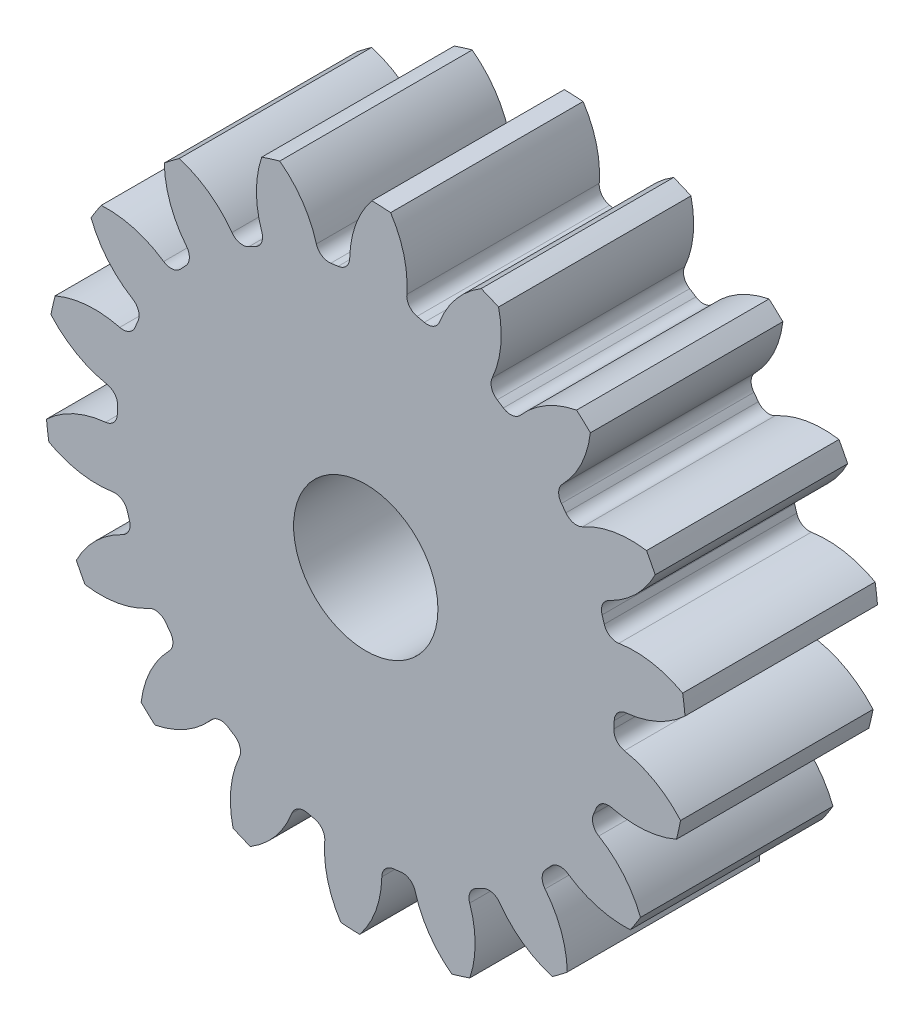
ISO-10303-21;
HEADER;
FILE_DESCRIPTION(('STEP AP214'),'2;1');
FILE_NAME('part.step','',(''),(''),'','','');
FILE_SCHEMA(('AUTOMOTIVE_DESIGN { 1 0 10303 214 1 1 1 1 }'));
ENDSEC;
DATA;
#1=APPLICATION_CONTEXT('core data for automotive mechanical design processes');
#2=APPLICATION_PROTOCOL_DEFINITION('international standard','automotive_design',2000,#1);
#3=PRODUCT_CONTEXT('',#1,'mechanical');
#4=PRODUCT('Part','Part','',(#3));
#5=PRODUCT_RELATED_PRODUCT_CATEGORY('part','',(#4));
#6=PRODUCT_DEFINITION_FORMATION('','',#4);
#7=PRODUCT_DEFINITION_CONTEXT('part definition',#1,'design');
#8=PRODUCT_DEFINITION('design','',#6,#7);
#9=PRODUCT_DEFINITION_SHAPE('','',#8);
#10=(LENGTH_UNIT() NAMED_UNIT(*) SI_UNIT(.MILLI.,.METRE.));
#11=(NAMED_UNIT(*) PLANE_ANGLE_UNIT() SI_UNIT($,.RADIAN.));
#12=(NAMED_UNIT(*) SI_UNIT($,.STERADIAN.) SOLID_ANGLE_UNIT());
#13=UNCERTAINTY_MEASURE_WITH_UNIT(LENGTH_MEASURE(1.E-05),#10,'distance_accuracy_value','');
#14=(GEOMETRIC_REPRESENTATION_CONTEXT(3) GLOBAL_UNCERTAINTY_ASSIGNED_CONTEXT((#13)) GLOBAL_UNIT_ASSIGNED_CONTEXT((#10,
#11,#12)) REPRESENTATION_CONTEXT('',''));
#15=CARTESIAN_POINT('',(0.,0.,0.));
#16=DIRECTION('',(0.,0.,1.));
#17=DIRECTION('',(1.,0.,0.));
#18=AXIS2_PLACEMENT_3D('',#15,#16,#17);
#19=CARTESIAN_POINT('',(0.,0.,101.6));
#20=DIRECTION('',(0.,0.,-1.));
#21=DIRECTION('',(-1.,0.,0.));
#22=AXIS2_PLACEMENT_3D('',#19,#20,#21);
#23=CYLINDRICAL_SURFACE('',#22,169.333333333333);
#24=DIRECTION('',(0.,0.,-1.));
#25=VECTOR('',#24,1.);
#26=CARTESIAN_POINT('',(167.286141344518,26.2511845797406,50.8));
#27=LINE('',#26,#25);
#28=CARTESIAN_POINT('',(167.286141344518,26.2511845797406,101.6));
#29=VERTEX_POINT('',#28);
#30=CARTESIAN_POINT('',(167.286141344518,26.2511845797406,0.));
#31=VERTEX_POINT('',#30);
#32=EDGE_CURVE('E744',#29,#31,#27,.T.);
#33=ORIENTED_EDGE('',*,*,#32,.F.);
#34=CARTESIAN_POINT('',(0.,0.,101.6));
#35=DIRECTION('',(0.,0.,1.));
#36=DIRECTION('',(1.,0.,0.));
#37=AXIS2_PLACEMENT_3D('',#34,#35,#36);
#38=CIRCLE('',#37,169.333333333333);
#39=CARTESIAN_POINT('',(168.538247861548,16.3901429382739,101.6));
#40=VERTEX_POINT('',#39);
#41=EDGE_CURVE('E1389',#40,#29,#38,.T.);
#42=ORIENTED_EDGE('',*,*,#41,.F.);
#43=DIRECTION('',(0.,0.,-1.));
#44=VECTOR('',#43,1.);
#45=CARTESIAN_POINT('',(168.538247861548,16.3901429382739,50.8));
#46=LINE('',#45,#44);
#47=CARTESIAN_POINT('',(168.538247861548,16.3901429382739,0.));
#48=VERTEX_POINT('',#47);
#49=EDGE_CURVE('E1383',#48,#40,#46,.F.);
#50=ORIENTED_EDGE('',*,*,#49,.F.);
#51=CARTESIAN_POINT('',(0.,0.,0.));
#52=DIRECTION('',(0.,0.,1.));
#53=DIRECTION('',(1.,0.,0.));
#54=AXIS2_PLACEMENT_3D('',#51,#52,#53);
#55=CIRCLE('',#54,169.333333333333);
#56=EDGE_CURVE('E1394',#48,#31,#55,.T.);
#57=ORIENTED_EDGE('',*,*,#56,.T.);
#58=EDGE_LOOP('',(#33,#42,#50,#57));
#59=FACE_BOUND('',#58,.T.);
#60=ADVANCED_FACE('F33',(#59),#23,.T.);
#61=DIRECTION('',(0.,0.,-1.));
#62=VECTOR('',#61,1.);
#63=CARTESIAN_POINT('',(152.768388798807,73.045172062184,50.8));
#64=LINE('',#63,#62);
#65=CARTESIAN_POINT('',(152.768388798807,73.045172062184,0.));
#66=VERTEX_POINT('',#65);
#67=CARTESIAN_POINT('',(152.768388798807,73.045172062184,101.6));
#68=VERTEX_POINT('',#67);
#69=EDGE_CURVE('E715',#66,#68,#64,.F.);
#70=ORIENTED_EDGE('',*,*,#69,.F.);
#71=CARTESIAN_POINT('',(148.21911866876,81.8832744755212,0.));
#72=VERTEX_POINT('',#71);
#73=EDGE_CURVE('E1397',#66,#72,#55,.T.);
#74=ORIENTED_EDGE('',*,*,#73,.T.);
#75=DIRECTION('',(0.,0.,-1.));
#76=VECTOR('',#75,1.);
#77=CARTESIAN_POINT('',(148.21911866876,81.8832744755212,50.8));
#78=LINE('',#77,#76);
#79=CARTESIAN_POINT('',(148.21911866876,81.8832744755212,101.6));
#80=VERTEX_POINT('',#79);
#81=EDGE_CURVE('E777',#80,#72,#78,.T.);
#82=ORIENTED_EDGE('',*,*,#81,.F.);
#83=EDGE_CURVE('E1392',#68,#80,#38,.T.);
#84=ORIENTED_EDGE('',*,*,#83,.F.);
#85=EDGE_LOOP('',(#70,#74,#82,#84));
#86=FACE_BOUND('',#85,.T.);
#87=ADVANCED_FACE('F1601',(#86),#23,.T.);
#88=CARTESIAN_POINT('',(0.,0.,101.6));
#89=DIRECTION('',(0.,0.,1.));
#90=DIRECTION('',(1.,0.,0.));
#91=AXIS2_PLACEMENT_3D('',#88,#89,#90);
#92=PLANE('',#91);
#93=CARTESIAN_POINT('',(0.,0.,101.599999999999));
#94=DIRECTION('',(0.,0.,1.));
#95=DIRECTION('',(1.,0.,0.));
#96=AXIS2_PLACEMENT_3D('',#93,#94,#95);
#97=CIRCLE('',#96,38.1);
#98=CARTESIAN_POINT('',(38.1,0.,101.599999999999));
#99=VERTEX_POINT('',#98);
#100=EDGE_CURVE('E732',#99,#99,#97,.T.);
#101=ORIENTED_EDGE('',*,*,#100,.F.);
#102=EDGE_LOOP('',(#101));
#103=FACE_BOUND('',#102,.T.);
#104=ORIENTED_EDGE('',*,*,#41,.T.);
#105=CARTESIAN_POINT('',(141.805984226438,-19.998125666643,101.6));
#106=DIRECTION('',(0.,0.,-1.));
#107=DIRECTION('',(0.939692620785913,0.342020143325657,0.));
#108=AXIS2_PLACEMENT_3D('',#105,#106,#107);
#109=CIRCLE('',#108,52.8037603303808);
#110=CARTESIAN_POINT('',(133.58662766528,32.1620054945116,101.6));
#111=VERTEX_POINT('',#110);
#112=EDGE_CURVE('E724',#111,#29,#109,.T.);
#113=ORIENTED_EDGE('',*,*,#112,.F.);
#114=CARTESIAN_POINT('',(132.513849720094,38.9698666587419,101.6));
#115=DIRECTION('',(0.,0.,1.));
#116=DIRECTION('',(-0.939692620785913,-0.342020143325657,0.));
#117=AXIS2_PLACEMENT_3D('',#114,#115,#116);
#118=CIRCLE('',#117,6.89186666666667);
#119=CARTESIAN_POINT('',(125.901965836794,37.0254341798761,101.6));
#120=VERTEX_POINT('',#119);
#121=EDGE_CURVE('E722',#120,#111,#118,.T.);
#122=ORIENTED_EDGE('',*,*,#121,.F.);
#123=CARTESIAN_POINT('',(0.,0.,101.6));
#124=DIRECTION('',(0.,0.,-1.));
#125=DIRECTION('',(0.939692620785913,0.342020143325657,0.));
#126=AXIS2_PLACEMENT_3D('',#123,#124,#125);
#127=CIRCLE('',#126,131.233333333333);
#128=CARTESIAN_POINT('',(124.749881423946,40.7388618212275,101.6));
#129=VERTEX_POINT('',#128);
#130=EDGE_CURVE('E707',#129,#120,#127,.T.);
#131=ORIENTED_EDGE('',*,*,#130,.F.);
#132=CARTESIAN_POINT('',(131.301262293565,42.8783091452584,101.6));
#133=DIRECTION('',(0.,0.,1.));
#134=DIRECTION('',(-0.939692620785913,-0.342020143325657,0.));
#135=AXIS2_PLACEMENT_3D('',#132,#133,#134);
#136=CIRCLE('',#135,6.89186666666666);
#137=CARTESIAN_POINT('',(128.332301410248,49.0978828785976,101.6));
#138=VERTEX_POINT('',#137);
#139=EDGE_CURVE('E699',#138,#129,#136,.T.);
#140=ORIENTED_EDGE('',*,*,#139,.F.);
#141=CARTESIAN_POINT('',(105.58486497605,96.7507027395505,101.6));
#142=DIRECTION('',(0.,0.,-1.));
#143=DIRECTION('',(-0.939692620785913,-0.342020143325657,0.));
#144=AXIS2_PLACEMENT_3D('',#141,#142,#143);
#145=CIRCLE('',#144,52.8037603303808);
#146=EDGE_CURVE('E729',#68,#138,#145,.T.);
#147=ORIENTED_EDGE('',*,*,#146,.F.);
#148=ORIENTED_EDGE('',*,*,#83,.T.);
#149=CARTESIAN_POINT('',(140.093798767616,29.7084119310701,101.6));
#150=DIRECTION('',(0.,0.,-1.));
#151=DIRECTION('',(0.766044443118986,0.64278760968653,0.));
#152=AXIS2_PLACEMENT_3D('',#149,#150,#151);
#153=CIRCLE('',#152,52.8037603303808);
#154=CARTESIAN_POINT('',(114.530314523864,75.9117167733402,101.6));
#155=VERTEX_POINT('',#154);
#156=EDGE_CURVE('E753',#155,#80,#153,.T.);
#157=ORIENTED_EDGE('',*,*,#156,.F.);
#158=CARTESIAN_POINT('',(111.1938073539,81.9421020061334,101.6));
#159=DIRECTION('',(0.,0.,1.));
#160=DIRECTION('',(-0.766044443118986,-0.64278760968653,0.));
#161=AXIS2_PLACEMENT_3D('',#158,#159,#160);
#162=CIRCLE('',#161,6.89186666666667);
#163=CARTESIAN_POINT('',(105.645703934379,77.8535356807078,101.6));
#164=VERTEX_POINT('',#163);
#165=EDGE_CURVE('E751',#164,#155,#162,.T.);
#166=ORIENTED_EDGE('',*,*,#165,.F.);
#167=CARTESIAN_POINT('',(0.,0.,101.6));
#168=DIRECTION('',(0.,0.,-1.));
#169=DIRECTION('',(0.766044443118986,0.64278760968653,0.));
#170=AXIS2_PLACEMENT_3D('',#167,#168,#169);
#171=CIRCLE('',#170,131.233333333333);
#172=CARTESIAN_POINT('',(103.293031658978,80.9489801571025,101.6));
#173=VERTEX_POINT('',#172);
#174=EDGE_CURVE('E748',#173,#164,#171,.T.);
#175=ORIENTED_EDGE('',*,*,#174,.F.);
#176=CARTESIAN_POINT('',(108.717581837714,85.2001072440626,101.6));
#177=DIRECTION('',(0.,0.,1.));
#178=DIRECTION('',(-0.766044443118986,-0.64278760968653,0.));
#179=AXIS2_PLACEMENT_3D('',#176,#177,#178);
#180=CIRCLE('',#179,6.89186666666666);
#181=CARTESIAN_POINT('',(103.800451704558,90.0291503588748,101.6));
#182=VERTEX_POINT('',#181);
#183=EDGE_CURVE('E746',#182,#173,#180,.T.);
#184=ORIENTED_EDGE('',*,*,#183,.F.);
#185=CARTESIAN_POINT('',(66.1266292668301,127.028072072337,101.6));
#186=DIRECTION('',(0.,0.,-1.));
#187=DIRECTION('',(-0.766044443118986,-0.64278760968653,0.));
#188=AXIS2_PLACEMENT_3D('',#185,#186,#187);
#189=CIRCLE('',#188,52.8037603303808);
#190=CARTESIAN_POINT('',(118.572407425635,120.889875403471,101.6));
#191=VERTEX_POINT('',#190);
#192=EDGE_CURVE('E756',#191,#182,#189,.T.);
#193=ORIENTED_EDGE('',*,*,#192,.F.);
#194=CARTESIAN_POINT('',(111.274682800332,127.639033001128,101.6));
#195=VERTEX_POINT('',#194);
#196=EDGE_CURVE('E1441',#191,#195,#38,.T.);
#197=ORIENTED_EDGE('',*,*,#196,.T.);
#198=CARTESIAN_POINT('',(121.484233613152,75.8316766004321,101.6));
#199=DIRECTION('',(0.,0.,-1.));
#200=DIRECTION('',(0.50000000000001,0.866025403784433,0.));
#201=AXIS2_PLACEMENT_3D('',#198,#199,#200);
#202=CIRCLE('',#201,52.8037603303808);
#203=CARTESIAN_POINT('',(81.659955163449,110.505354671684,101.6));
#204=VERTEX_POINT('',#203);
#205=EDGE_CURVE('E788',#204,#195,#202,.T.);
#206=ORIENTED_EDGE('',*,*,#205,.F.);
#207=CARTESIAN_POINT('',(76.4621507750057,115.030910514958,101.6));
#208=DIRECTION('',(0.,0.,1.));
#209=DIRECTION('',(-0.50000000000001,-0.866025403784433,0.));
#210=AXIS2_PLACEMENT_3D('',#207,#208,#209);
#211=CIRCLE('',#210,6.89186666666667);
#212=CARTESIAN_POINT('',(72.6470109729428,109.291351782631,101.6));
#213=VERTEX_POINT('',#212);
#214=EDGE_CURVE('E786',#213,#204,#211,.T.);
#215=ORIENTED_EDGE('',*,*,#214,.F.);
#216=CARTESIAN_POINT('',(0.,0.,101.6));
#217=DIRECTION('',(0.,0.,-1.));
#218=DIRECTION('',(0.50000000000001,0.866025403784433,0.));
#219=AXIS2_PLACEMENT_3D('',#216,#217,#218);
#220=CIRCLE('',#219,131.233333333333);
#221=CARTESIAN_POINT('',(69.3775178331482,111.395456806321,101.6));
#222=VERTEX_POINT('',#221);
#223=EDGE_CURVE('E783',#222,#213,#220,.T.);
#224=ORIENTED_EDGE('',*,*,#223,.F.);
#225=CARTESIAN_POINT('',(73.0209565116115,117.245514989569,101.6));
#226=DIRECTION('',(0.,0.,1.));
#227=DIRECTION('',(-0.50000000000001,-0.866025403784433,0.));
#228=AXIS2_PLACEMENT_3D('',#225,#226,#227);
#229=CIRCLE('',#228,6.89186666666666);
#230=CARTESIAN_POINT('',(66.7487355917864,120.101573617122,101.6));
#231=VERTEX_POINT('',#230);
#232=EDGE_CURVE('E781',#231,#222,#229,.T.);
#233=ORIENTED_EDGE('',*,*,#232,.F.);
#234=CARTESIAN_POINT('',(18.6925461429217,141.98398117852,101.6));
#235=DIRECTION('',(0.,0.,-1.));
#236=DIRECTION('',(-0.50000000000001,-0.866025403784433,0.));
#237=AXIS2_PLACEMENT_3D('',#234,#235,#236);
#238=CIRCLE('',#237,52.8037603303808);
#239=CARTESIAN_POINT('',(70.0748437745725,154.153475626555,101.6));
#240=VERTEX_POINT('',#239);
#241=EDGE_CURVE('E791',#240,#231,#238,.T.);
#242=ORIENTED_EDGE('',*,*,#241,.F.);
#243=CARTESIAN_POINT('',(60.9088779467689,157.999640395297,101.6));
#244=VERTEX_POINT('',#243);
#245=EDGE_CURVE('E1583',#240,#244,#38,.T.);
#246=ORIENTED_EDGE('',*,*,#245,.T.);
#247=CARTESIAN_POINT('',(88.221876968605,112.808521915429,101.6));
#248=DIRECTION('',(0.,0.,-1.));
#249=DIRECTION('',(0.17364817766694,0.984807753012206,0.));
#250=AXIS2_PLACEMENT_3D('',#247,#248,#249);
#251=CIRCLE('',#250,52.8037603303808);
#252=CARTESIAN_POINT('',(38.9402000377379,131.770415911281,101.6));
#253=VERTEX_POINT('',#252);
#254=EDGE_CURVE('E826',#253,#244,#251,.T.);
#255=ORIENTED_EDGE('',*,*,#254,.F.);
#256=CARTESIAN_POINT('',(32.5080303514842,134.245293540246,101.6));
#257=DIRECTION('',(0.,0.,1.));
#258=DIRECTION('',(-0.17364817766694,-0.984807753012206,0.));
#259=AXIS2_PLACEMENT_3D('',#256,#257,#258);
#260=CIRCLE('',#259,6.89186666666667);
#261=CARTESIAN_POINT('',(30.8860163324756,127.547017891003,101.6));
#262=VERTEX_POINT('',#261);
#263=EDGE_CURVE('E824',#262,#253,#260,.T.);
#264=ORIENTED_EDGE('',*,*,#263,.F.);
#265=CARTESIAN_POINT('',(0.,0.,101.6));
#266=DIRECTION('',(0.,0.,-1.));
#267=DIRECTION('',(0.17364817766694,0.984807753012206,0.));
#268=AXIS2_PLACEMENT_3D('',#265,#266,#267);
#269=CIRCLE('',#268,131.233333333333);
#270=CARTESIAN_POINT('',(27.0940514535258,128.405997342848,101.6));
#271=VERTEX_POINT('',#270);
#272=EDGE_CURVE('E821',#271,#262,#269,.T.);
#273=ORIENTED_EDGE('',*,*,#272,.F.);
#274=CARTESIAN_POINT('',(28.5169261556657,135.14938326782,101.6));
#275=DIRECTION('',(0.,0.,1.));
#276=DIRECTION('',(-0.17364817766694,-0.984807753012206,0.));
#277=AXIS2_PLACEMENT_3D('',#274,#275,#276);
#278=CIRCLE('',#277,6.89186666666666);
#279=CARTESIAN_POINT('',(21.6461368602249,135.687974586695,101.6));
#280=VERTEX_POINT('',#279);
#281=EDGE_CURVE('E819',#280,#271,#278,.T.);
#282=ORIENTED_EDGE('',*,*,#281,.F.);
#283=CARTESIAN_POINT('',(-30.9961339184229,139.814526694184,101.6));
#284=DIRECTION('',(0.,0.,-1.));
#285=DIRECTION('',(-0.17364817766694,-0.984807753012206,0.));
#286=AXIS2_PLACEMENT_3D('',#283,#284,#285);
#287=CIRCLE('',#286,52.8037603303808);
#288=CARTESIAN_POINT('',(13.1252197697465,168.823891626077,101.6));
#289=VERTEX_POINT('',#288);
#290=EDGE_CURVE('E829',#289,#280,#287,.T.);
#291=ORIENTED_EDGE('',*,*,#290,.F.);
#292=CARTESIAN_POINT('',(3.19656349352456,169.303159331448,101.6));
#293=VERTEX_POINT('',#292);
#294=EDGE_CURVE('E1579',#289,#293,#38,.T.);
#295=ORIENTED_EDGE('',*,*,#294,.T.);
#296=CARTESIAN_POINT('',(44.3186599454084,136.178994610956,101.6));
#297=DIRECTION('',(0.,0.,-1.));
#298=DIRECTION('',(-0.173648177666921,0.98480775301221,0.));
#299=AXIS2_PLACEMENT_3D('',#296,#297,#298);
#300=CIRCLE('',#299,52.8037603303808);
#301=CARTESIAN_POINT('',(-8.47631790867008,137.142020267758,101.6));
#302=VERTEX_POINT('',#301);
#303=EDGE_CURVE('E864',#302,#293,#300,.T.);
#304=ORIENTED_EDGE('',*,*,#303,.F.);
#305=CARTESIAN_POINT('',(-15.3670382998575,137.267712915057,101.6));
#306=DIRECTION('',(0.,0.,1.));
#307=DIRECTION('',(0.173648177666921,-0.98480775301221,0.));
#308=AXIS2_PLACEMENT_3D('',#305,#306,#307);
#309=CIRCLE('',#308,6.89186666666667);
#310=CARTESIAN_POINT('',(-14.600287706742,130.418631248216,101.6));
#311=VERTEX_POINT('',#310);
#312=EDGE_CURVE('E862',#311,#302,#309,.T.);
#313=ORIENTED_EDGE('',*,*,#312,.F.);
#314=CARTESIAN_POINT('',(0.,0.,101.6));
#315=DIRECTION('',(0.,0.,-1.));
#316=DIRECTION('',(-0.173648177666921,0.98480775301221,0.));
#317=AXIS2_PLACEMENT_3D('',#314,#315,#316);
#318=CIRCLE('',#317,131.233333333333);
#319=CARTESIAN_POINT('',(-18.4573573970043,129.928879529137,101.6));
#320=VERTEX_POINT('',#319);
#321=EDGE_CURVE('E859',#320,#311,#318,.T.);
#322=ORIENTED_EDGE('',*,*,#321,.F.);
#323=CARTESIAN_POINT('',(-19.42666635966,136.752241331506,101.6));
#324=DIRECTION('',(0.,0.,1.));
#325=DIRECTION('',(0.173648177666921,-0.98480775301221,0.));
#326=AXIS2_PLACEMENT_3D('',#323,#324,#325);
#327=CIRCLE('',#326,6.89186666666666);
#328=CARTESIAN_POINT('',(-26.0673054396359,134.908403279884,101.6));
#329=VERTEX_POINT('',#328);
#330=EDGE_CURVE('E857',#329,#320,#327,.T.);
#331=ORIENTED_EDGE('',*,*,#330,.F.);
#332=CARTESIAN_POINT('',(-76.9462227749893,120.781376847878,101.6));
#333=DIRECTION('',(0.,0.,-1.));
#334=DIRECTION('',(0.173648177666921,-0.98480775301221,0.));
#335=AXIS2_PLACEMENT_3D('',#332,#333,#334);
#336=CIRCLE('',#335,52.8037603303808);
#337=CARTESIAN_POINT('',(-45.4074994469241,163.131654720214,101.6));
#338=VERTEX_POINT('',#337);
#339=EDGE_CURVE('E867',#338,#329,#336,.T.);
#340=ORIENTED_EDGE('',*,*,#339,.F.);
#341=CARTESIAN_POINT('',(-54.9013036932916,160.186218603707,101.6));
#342=VERTEX_POINT('',#341);
#343=EDGE_CURVE('E1575',#338,#342,#38,.T.);
#344=ORIENTED_EDGE('',*,*,#343,.T.);
#345=CARTESIAN_POINT('',(-4.93004154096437,143.124270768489,101.6));
#346=DIRECTION('',(0.,0.,-1.));
#347=DIRECTION('',(-0.499999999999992,0.866025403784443,0.));
#348=AXIS2_PLACEMENT_3D('',#345,#346,#347);
#349=CIRCLE('',#348,52.8037603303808);
#350=CARTESIAN_POINT('',(-54.8704668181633,125.972272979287,101.6));
#351=VERTEX_POINT('',#350);
#352=EDGE_CURVE('E902',#351,#342,#349,.T.);
#353=ORIENTED_EDGE('',*,*,#352,.F.);
#354=CARTESIAN_POINT('',(-61.3886153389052,123.73362025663,101.6));
#355=DIRECTION('',(0.,0.,1.));
#356=DIRECTION('',(0.499999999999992,-0.866025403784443,0.));
#357=AXIS2_PLACEMENT_3D('',#354,#355,#356);
#358=CIRCLE('',#357,6.89186666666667);
#359=CARTESIAN_POINT('',(-58.325581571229,117.559832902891,101.6));
#360=VERTEX_POINT('',#359);
#361=EDGE_CURVE('E900',#360,#351,#358,.T.);
#362=ORIENTED_EDGE('',*,*,#361,.F.);
#363=CARTESIAN_POINT('',(0.,0.,101.6));
#364=DIRECTION('',(0.,0.,-1.));
#365=DIRECTION('',(-0.499999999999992,0.866025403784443,0.));
#366=AXIS2_PLACEMENT_3D('',#363,#364,#365);
#367=CIRCLE('',#366,131.233333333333);
#368=CARTESIAN_POINT('',(-61.7825365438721,115.780421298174,101.6));
#369=VERTEX_POINT('',#368);
#370=EDGE_CURVE('E897',#369,#360,#367,.T.);
#371=ORIENTED_EDGE('',*,*,#370,.F.);
#372=CARTESIAN_POINT('',(-65.0271162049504,121.860760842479,101.6));
#373=DIRECTION('',(0.,0.,1.));
#374=DIRECTION('',(0.499999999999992,-0.866025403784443,0.));
#375=AXIS2_PLACEMENT_3D('',#372,#373,#374);
#376=CIRCLE('',#375,6.89186666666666);
#377=CARTESIAN_POINT('',(-70.6366459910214,117.856887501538,101.6));
#378=VERTEX_POINT('',#377);
#379=EDGE_CURVE('E895',#378,#369,#376,.T.);
#380=ORIENTED_EDGE('',*,*,#379,.F.);
#381=CARTESIAN_POINT('',(-113.615461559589,87.1802104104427,101.6));
#382=DIRECTION('',(0.,0.,-1.));
#383=DIRECTION('',(0.499999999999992,-0.866025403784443,0.));
#384=AXIS2_PLACEMENT_3D('',#381,#382,#383);
#385=CIRCLE('',#384,52.8037603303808);
#386=CARTESIAN_POINT('',(-98.463404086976,137.763332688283,101.6));
#387=VERTEX_POINT('',#386);
#388=EDGE_CURVE('E905',#387,#378,#385,.T.);
#389=ORIENTED_EDGE('',*,*,#388,.F.);
#390=CARTESIAN_POINT('',(-106.377263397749,131.748455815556,101.6));
#391=VERTEX_POINT('',#390);
#392=EDGE_CURVE('E1571',#387,#391,#38,.T.);
#393=ORIENTED_EDGE('',*,*,#392,.T.);
#394=CARTESIAN_POINT('',(-53.5841072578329,132.806647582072,101.6));
#395=DIRECTION('',(0.,0.,-1.));
#396=DIRECTION('',(-0.766044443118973,0.642787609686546,0.));
#397=AXIS2_PLACEMENT_3D('',#394,#395,#396);
#398=CIRCLE('',#397,52.8037603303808);
#399=CARTESIAN_POINT('',(-94.6464276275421,99.6084104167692,101.6));
#400=VERTEX_POINT('',#399);
#401=EDGE_CURVE('E940',#400,#391,#398,.T.);
#402=ORIENTED_EDGE('',*,*,#401,.F.);
#403=CARTESIAN_POINT('',(-100.00581936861,95.2754268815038,101.6));
#404=DIRECTION('',(0.,0.,1.));
#405=DIRECTION('',(0.766044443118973,-0.642787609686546,0.));
#406=AXIS2_PLACEMENT_3D('',#403,#404,#405);
#407=CIRCLE('',#406,6.89186666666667);
#408=CARTESIAN_POINT('',(-95.0159495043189,90.521583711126,101.6));
#409=VERTEX_POINT('',#408);
#410=EDGE_CURVE('E938',#409,#400,#407,.T.);
#411=ORIENTED_EDGE('',*,*,#410,.F.);
#412=CARTESIAN_POINT('',(0.,0.,101.6));
#413=DIRECTION('',(0.,0.,-1.));
#414=DIRECTION('',(-0.766044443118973,0.642787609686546,0.));
#415=AXIS2_PLACEMENT_3D('',#412,#413,#414);
#416=CIRCLE('',#415,131.233333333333);
#417=CARTESIAN_POINT('',(-97.6558299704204,87.6671355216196,101.6));
#418=VERTEX_POINT('',#417);
#419=EDGE_CURVE('E935',#418,#409,#416,.T.);
#420=ORIENTED_EDGE('',*,*,#419,.F.);
#421=CARTESIAN_POINT('',(-102.784336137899,92.2710741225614,101.6));
#422=DIRECTION('',(0.,0.,1.));
#423=DIRECTION('',(0.766044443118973,-0.642787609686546,0.));
#424=AXIS2_PLACEMENT_3D('',#421,#422,#423);
#425=CIRCLE('',#424,6.89186666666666);
#426=CARTESIAN_POINT('',(-106.686164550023,86.5900917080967,101.6));
#427=VERTEX_POINT('',#426);
#428=EDGE_CURVE('E933',#427,#418,#425,.T.);
#429=ORIENTED_EDGE('',*,*,#428,.F.);
#430=CARTESIAN_POINT('',(-136.580998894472,43.063823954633,101.6));
#431=DIRECTION('',(0.,0.,-1.));
#432=DIRECTION('',(0.766044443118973,-0.642787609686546,0.));
#433=AXIS2_PLACEMENT_3D('',#430,#431,#432);
#434=CIRCLE('',#433,52.8037603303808);
#435=CARTESIAN_POINT('',(-139.643169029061,95.7787195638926,101.6));
#436=VERTEX_POINT('',#435);
#437=EDGE_CURVE('E943',#436,#427,#434,.T.);
#438=ORIENTED_EDGE('',*,*,#437,.F.);
#439=CARTESIAN_POINT('',(-145.022555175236,87.4198848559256,101.6));
#440=VERTEX_POINT('',#439);
#441=EDGE_CURVE('E1567',#436,#440,#38,.T.);
#442=ORIENTED_EDGE('',*,*,#441,.T.);
#443=CARTESIAN_POINT('',(-95.775138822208,106.470582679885,101.6));
#444=DIRECTION('',(0.,0.,-1.));
#445=DIRECTION('',(-0.939692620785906,0.342020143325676,0.));
#446=AXIS2_PLACEMENT_3D('',#443,#444,#445);
#447=CIRCLE('',#446,52.8037603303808);
#448=CARTESIAN_POINT('',(-123.006632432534,61.2303034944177,101.6));
#449=VERTEX_POINT('',#448);
#450=EDGE_CURVE('E978',#449,#440,#447,.T.);
#451=ORIENTED_EDGE('',*,*,#450,.F.);
#452=CARTESIAN_POINT('',(-126.560845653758,55.3256109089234,101.6));
#453=DIRECTION('',(0.,0.,1.));
#454=DIRECTION('',(0.939692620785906,-0.342020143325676,0.));
#455=AXIS2_PLACEMENT_3D('',#452,#453,#454);
#456=CIRCLE('',#455,6.89186666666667);
#457=CARTESIAN_POINT('',(-120.245991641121,52.5650955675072,101.6));
#458=VERTEX_POINT('',#457);
#459=EDGE_CURVE('E976',#458,#449,#456,.T.);
#460=ORIENTED_EDGE('',*,*,#459,.F.);
#461=CARTESIAN_POINT('',(0.,0.,101.6));
#462=DIRECTION('',(0.,0.,-1.));
#463=DIRECTION('',(-0.939692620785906,0.342020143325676,0.));
#464=AXIS2_PLACEMENT_3D('',#461,#462,#463);
#465=CIRCLE('',#464,131.233333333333);
#466=CARTESIAN_POINT('',(-121.750389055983,48.9798993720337,101.6));
#467=VERTEX_POINT('',#466);
#468=EDGE_CURVE('E973',#467,#458,#465,.T.);
#469=ORIENTED_EDGE('',*,*,#468,.F.);
#470=CARTESIAN_POINT('',(-128.144248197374,51.5521340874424,101.6));
#471=DIRECTION('',(0.,0.,1.));
#472=DIRECTION('',(0.939692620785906,-0.342020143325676,0.));
#473=AXIS2_PLACEMENT_3D('',#470,#471,#472);
#474=CIRCLE('',#473,6.89186666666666);
#475=CARTESIAN_POINT('',(-129.867757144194,44.8792529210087,101.6));
#476=VERTEX_POINT('',#475);
#477=EDGE_CURVE('E971',#476,#467,#474,.T.);
#478=ORIENTED_EDGE('',*,*,#477,.F.);
#479=CARTESIAN_POINT('',(-143.072852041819,-6.24669522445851,101.6));
#480=DIRECTION('',(0.,0.,-1.));
#481=DIRECTION('',(0.939692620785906,-0.342020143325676,0.));
#482=AXIS2_PLACEMENT_3D('',#479,#480,#481);
#483=CIRCLE('',#482,52.8037603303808);
#484=CARTESIAN_POINT('',(-163.979906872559,42.2417793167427,101.6));
#485=VERTEX_POINT('',#484);
#486=EDGE_CURVE('E981',#485,#476,#483,.T.);
#487=ORIENTED_EDGE('',*,*,#486,.F.);
#488=CARTESIAN_POINT('',(-166.175986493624,32.5471856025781,101.6));
#489=VERTEX_POINT('',#488);
#490=EDGE_CURVE('E1563',#485,#489,#38,.T.);
#491=ORIENTED_EDGE('',*,*,#490,.T.);
#492=CARTESIAN_POINT('',(-126.414275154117,67.2925941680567,101.6));
#493=DIRECTION('',(0.,0.,-1.));
#494=DIRECTION('',(-1.,0.,0.));
#495=AXIS2_PLACEMENT_3D('',#492,#493,#494);
#496=CIRCLE('',#495,52.8037603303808);
#497=CARTESIAN_POINT('',(-136.530421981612,15.4669183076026,101.6));
#498=VERTEX_POINT('',#497);
#499=EDGE_CURVE('E1016',#498,#489,#496,.T.);
#500=ORIENTED_EDGE('',*,*,#499,.F.);
#501=CARTESIAN_POINT('',(-137.850766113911,8.70270974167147,101.6));
#502=DIRECTION('',(0.,0.,1.));
#503=DIRECTION('',(1.,0.,0.));
#504=AXIS2_PLACEMENT_3D('',#501,#502,#503);
#505=CIRCLE('',#504,6.89186666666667);
#506=CARTESIAN_POINT('',(-130.972592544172,8.26848112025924,101.6));
#507=VERTEX_POINT('',#506);
#508=EDGE_CURVE('E1014',#507,#498,#505,.T.);
#509=ORIENTED_EDGE('',*,*,#508,.F.);
#510=CARTESIAN_POINT('',(0.,0.,101.6));
#511=DIRECTION('',(0.,0.,-1.));
#512=DIRECTION('',(-1.,0.,0.));
#513=AXIS2_PLACEMENT_3D('',#510,#511,#512);
#514=CIRCLE('',#513,131.233333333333);
#515=CARTESIAN_POINT('',(-131.16005437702,4.38496449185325,101.6));
#516=VERTEX_POINT('',#515);
#517=EDGE_CURVE('E1011',#516,#507,#514,.T.);
#518=ORIENTED_EDGE('',*,*,#517,.F.);
#519=CARTESIAN_POINT('',(-138.048072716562,4.61524585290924,101.6));
#520=DIRECTION('',(0.,0.,1.));
#521=DIRECTION('',(1.,0.,0.));
#522=AXIS2_PLACEMENT_3D('',#519,#520,#521);
#523=CIRCLE('',#522,6.89186666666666);
#524=CARTESIAN_POINT('',(-137.385381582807,-2.24468611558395,101.6));
#525=VERTEX_POINT('',#524);
#526=EDGE_CURVE('E1009',#525,#516,#523,.T.);
#527=ORIENTED_EDGE('',*,*,#526,.F.);
#528=CARTESIAN_POINT('',(-132.30800770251,-54.8037707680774,101.6));
#529=DIRECTION('',(0.,0.,-1.));
#530=DIRECTION('',(1.,0.,0.));
#531=AXIS2_PLACEMENT_3D('',#528,#529,#530);
#532=CIRCLE('',#531,52.8037603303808);
#533=CARTESIAN_POINT('',(-168.538247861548,-16.3901429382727,101.6));
#534=VERTEX_POINT('',#533);
#535=EDGE_CURVE('E1019',#534,#525,#532,.T.);
#536=ORIENTED_EDGE('',*,*,#535,.F.);
#537=CARTESIAN_POINT('',(-167.286141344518,-26.2511845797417,101.6));
#538=VERTEX_POINT('',#537);
#539=EDGE_CURVE('E1559',#534,#538,#38,.T.);
#540=ORIENTED_EDGE('',*,*,#539,.T.);
#541=CARTESIAN_POINT('',(-141.805984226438,19.9981256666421,101.6));
#542=DIRECTION('',(0.,0.,-1.));
#543=DIRECTION('',(-0.939692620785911,-0.342020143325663,0.));
#544=AXIS2_PLACEMENT_3D('',#541,#542,#543);
#545=CIRCLE('',#544,52.8037603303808);
#546=CARTESIAN_POINT('',(-133.58662766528,-32.1620054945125,101.6));
#547=VERTEX_POINT('',#546);
#548=EDGE_CURVE('E1054',#547,#538,#545,.T.);
#549=ORIENTED_EDGE('',*,*,#548,.F.);
#550=CARTESIAN_POINT('',(-132.513849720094,-38.9698666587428,101.6));
#551=DIRECTION('',(0.,0.,1.));
#552=DIRECTION('',(0.939692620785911,0.342020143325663,0.));
#553=AXIS2_PLACEMENT_3D('',#550,#551,#552);
#554=CIRCLE('',#553,6.89186666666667);
#555=CARTESIAN_POINT('',(-125.901965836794,-37.0254341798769,101.6));
#556=VERTEX_POINT('',#555);
#557=EDGE_CURVE('E1052',#556,#547,#554,.T.);
#558=ORIENTED_EDGE('',*,*,#557,.F.);
#559=CARTESIAN_POINT('',(0.,0.,101.6));
#560=DIRECTION('',(0.,0.,-1.));
#561=DIRECTION('',(-0.939692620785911,-0.342020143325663,0.));
#562=AXIS2_PLACEMENT_3D('',#559,#560,#561);
#563=CIRCLE('',#562,131.233333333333);
#564=CARTESIAN_POINT('',(-124.749881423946,-40.7388618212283,101.6));
#565=VERTEX_POINT('',#564);
#566=EDGE_CURVE('E1049',#565,#556,#563,.T.);
#567=ORIENTED_EDGE('',*,*,#566,.F.);
#568=CARTESIAN_POINT('',(-131.301262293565,-42.8783091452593,101.6));
#569=DIRECTION('',(0.,0.,1.));
#570=DIRECTION('',(0.939692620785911,0.342020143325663,0.));
#571=AXIS2_PLACEMENT_3D('',#568,#569,#570);
#572=CIRCLE('',#571,6.89186666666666);
#573=CARTESIAN_POINT('',(-128.332301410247,-49.0978828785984,101.6));
#574=VERTEX_POINT('',#573);
#575=EDGE_CURVE('E1047',#574,#565,#572,.T.);
#576=ORIENTED_EDGE('',*,*,#575,.F.);
#577=CARTESIAN_POINT('',(-105.584864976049,-96.7507027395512,101.6));
#578=DIRECTION('',(0.,0.,-1.));
#579=DIRECTION('',(0.939692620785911,0.342020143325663,0.));
#580=AXIS2_PLACEMENT_3D('',#577,#578,#579);
#581=CIRCLE('',#580,52.8037603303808);
#582=CARTESIAN_POINT('',(-152.768388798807,-73.045172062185,101.6));
#583=VERTEX_POINT('',#582);
#584=EDGE_CURVE('E1057',#583,#574,#581,.T.);
#585=ORIENTED_EDGE('',*,*,#584,.F.);
#586=CARTESIAN_POINT('',(-148.21911866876,-81.8832744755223,101.6));
#587=VERTEX_POINT('',#586);
#588=EDGE_CURVE('E1555',#583,#587,#38,.T.);
#589=ORIENTED_EDGE('',*,*,#588,.T.);
#590=CARTESIAN_POINT('',(-140.093798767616,-29.708411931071,101.6));
#591=DIRECTION('',(0.,0.,-1.));
#592=DIRECTION('',(-0.766044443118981,-0.642787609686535,0.));
#593=AXIS2_PLACEMENT_3D('',#590,#591,#592);
#594=CIRCLE('',#593,52.8037603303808);
#595=CARTESIAN_POINT('',(-114.530314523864,-75.911716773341,101.6));
#596=VERTEX_POINT('',#595);
#597=EDGE_CURVE('E1092',#596,#587,#594,.T.);
#598=ORIENTED_EDGE('',*,*,#597,.F.);
#599=CARTESIAN_POINT('',(-111.1938073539,-81.9421020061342,101.6));
#600=DIRECTION('',(0.,0.,1.));
#601=DIRECTION('',(0.766044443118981,0.642787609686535,0.));
#602=AXIS2_PLACEMENT_3D('',#599,#600,#601);
#603=CIRCLE('',#602,6.89186666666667);
#604=CARTESIAN_POINT('',(-105.645703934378,-77.8535356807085,101.6));
#605=VERTEX_POINT('',#604);
#606=EDGE_CURVE('E1090',#605,#596,#603,.T.);
#607=ORIENTED_EDGE('',*,*,#606,.F.);
#608=CARTESIAN_POINT('',(0.,0.,101.6));
#609=DIRECTION('',(0.,0.,-1.));
#610=DIRECTION('',(-0.766044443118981,-0.642787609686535,0.));
#611=AXIS2_PLACEMENT_3D('',#608,#609,#610);
#612=CIRCLE('',#611,131.233333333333);
#613=CARTESIAN_POINT('',(-103.293031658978,-80.9489801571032,101.6));
#614=VERTEX_POINT('',#613);
#615=EDGE_CURVE('E1087',#614,#605,#612,.T.);
#616=ORIENTED_EDGE('',*,*,#615,.F.);
#617=CARTESIAN_POINT('',(-108.717581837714,-85.2001072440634,101.6));
#618=DIRECTION('',(0.,0.,1.));
#619=DIRECTION('',(0.766044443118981,0.642787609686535,0.));
#620=AXIS2_PLACEMENT_3D('',#617,#618,#619);
#621=CIRCLE('',#620,6.89186666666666);
#622=CARTESIAN_POINT('',(-103.800451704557,-90.0291503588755,101.6));
#623=VERTEX_POINT('',#622);
#624=EDGE_CURVE('E1085',#623,#614,#621,.T.);
#625=ORIENTED_EDGE('',*,*,#624,.F.);
#626=CARTESIAN_POINT('',(-66.1266292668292,-127.028072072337,101.6));
#627=DIRECTION('',(0.,0.,-1.));
#628=DIRECTION('',(0.766044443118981,0.642787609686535,0.));
#629=AXIS2_PLACEMENT_3D('',#626,#627,#628);
#630=CIRCLE('',#629,52.8037603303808);
#631=CARTESIAN_POINT('',(-118.572407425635,-120.889875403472,101.6));
#632=VERTEX_POINT('',#631);
#633=EDGE_CURVE('E1095',#632,#623,#630,.T.);
#634=ORIENTED_EDGE('',*,*,#633,.F.);
#635=CARTESIAN_POINT('',(-111.274682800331,-127.639033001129,101.6));
#636=VERTEX_POINT('',#635);
#637=EDGE_CURVE('E1551',#632,#636,#38,.T.);
#638=ORIENTED_EDGE('',*,*,#637,.T.);
#639=CARTESIAN_POINT('',(-121.484233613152,-75.831676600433,101.6));
#640=DIRECTION('',(0.,0.,-1.));
#641=DIRECTION('',(-0.500000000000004,-0.866025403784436,0.));
#642=AXIS2_PLACEMENT_3D('',#639,#640,#641);
#643=CIRCLE('',#642,52.8037603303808);
#644=CARTESIAN_POINT('',(-81.6599551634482,-110.505354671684,101.6));
#645=VERTEX_POINT('',#644);
#646=EDGE_CURVE('E1130',#645,#636,#643,.T.);
#647=ORIENTED_EDGE('',*,*,#646,.F.);
#648=CARTESIAN_POINT('',(-76.4621507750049,-115.030910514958,101.6));
#649=DIRECTION('',(0.,0.,1.));
#650=DIRECTION('',(0.500000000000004,0.866025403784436,0.));
#651=AXIS2_PLACEMENT_3D('',#648,#649,#650);
#652=CIRCLE('',#651,6.89186666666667);
#653=CARTESIAN_POINT('',(-72.6470109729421,-109.291351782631,101.6));
#654=VERTEX_POINT('',#653);
#655=EDGE_CURVE('E1128',#654,#645,#652,.T.);
#656=ORIENTED_EDGE('',*,*,#655,.F.);
#657=CARTESIAN_POINT('',(0.,0.,101.6));
#658=DIRECTION('',(0.,0.,-1.));
#659=DIRECTION('',(-0.500000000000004,-0.866025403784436,0.));
#660=AXIS2_PLACEMENT_3D('',#657,#658,#659);
#661=CIRCLE('',#660,131.233333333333);
#662=CARTESIAN_POINT('',(-69.3775178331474,-111.395456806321,101.6));
#663=VERTEX_POINT('',#662);
#664=EDGE_CURVE('E1125',#663,#654,#661,.T.);
#665=ORIENTED_EDGE('',*,*,#664,.F.);
#666=CARTESIAN_POINT('',(-73.0209565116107,-117.245514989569,101.6));
#667=DIRECTION('',(0.,0.,1.));
#668=DIRECTION('',(0.500000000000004,0.866025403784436,0.));
#669=AXIS2_PLACEMENT_3D('',#666,#667,#668);
#670=CIRCLE('',#669,6.89186666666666);
#671=CARTESIAN_POINT('',(-66.7487355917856,-120.101573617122,101.6));
#672=VERTEX_POINT('',#671);
#673=EDGE_CURVE('E1123',#672,#663,#670,.T.);
#674=ORIENTED_EDGE('',*,*,#673,.F.);
#675=CARTESIAN_POINT('',(-18.6925461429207,-141.98398117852,101.6));
#676=DIRECTION('',(0.,0.,-1.));
#677=DIRECTION('',(0.500000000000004,0.866025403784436,0.));
#678=AXIS2_PLACEMENT_3D('',#675,#676,#677);
#679=CIRCLE('',#678,52.8037603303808);
#680=CARTESIAN_POINT('',(-70.0748437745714,-154.153475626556,101.6));
#681=VERTEX_POINT('',#680);
#682=EDGE_CURVE('E1133',#681,#672,#679,.T.);
#683=ORIENTED_EDGE('',*,*,#682,.F.);
#684=CARTESIAN_POINT('',(-60.9088779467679,-157.999640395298,101.6));
#685=VERTEX_POINT('',#684);
#686=EDGE_CURVE('E1547',#681,#685,#38,.T.);
#687=ORIENTED_EDGE('',*,*,#686,.T.);
#688=CARTESIAN_POINT('',(-88.2218769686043,-112.80852191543,101.6));
#689=DIRECTION('',(0.,0.,-1.));
#690=DIRECTION('',(-0.173648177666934,-0.984807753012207,0.));
#691=AXIS2_PLACEMENT_3D('',#688,#689,#690);
#692=CIRCLE('',#691,52.8037603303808);
#693=CARTESIAN_POINT('',(-38.940200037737,-131.770415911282,101.6));
#694=VERTEX_POINT('',#693);
#695=EDGE_CURVE('E1168',#694,#685,#692,.T.);
#696=ORIENTED_EDGE('',*,*,#695,.F.);
#697=CARTESIAN_POINT('',(-32.5080303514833,-134.245293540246,101.6));
#698=DIRECTION('',(0.,0.,1.));
#699=DIRECTION('',(0.173648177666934,0.984807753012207,0.));
#700=AXIS2_PLACEMENT_3D('',#697,#698,#699);
#701=CIRCLE('',#700,6.89186666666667);
#702=CARTESIAN_POINT('',(-30.8860163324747,-127.547017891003,101.6));
#703=VERTEX_POINT('',#702);
#704=EDGE_CURVE('E1166',#703,#694,#701,.T.);
#705=ORIENTED_EDGE('',*,*,#704,.F.);
#706=CARTESIAN_POINT('',(0.,0.,101.6));
#707=DIRECTION('',(0.,0.,-1.));
#708=DIRECTION('',(-0.173648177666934,-0.984807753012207,0.));
#709=AXIS2_PLACEMENT_3D('',#706,#707,#708);
#710=CIRCLE('',#709,131.233333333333);
#711=CARTESIAN_POINT('',(-27.0940514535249,-128.405997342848,101.6));
#712=VERTEX_POINT('',#711);
#713=EDGE_CURVE('E1163',#712,#703,#710,.T.);
#714=ORIENTED_EDGE('',*,*,#713,.F.);
#715=CARTESIAN_POINT('',(-28.5169261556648,-135.14938326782,101.6));
#716=DIRECTION('',(0.,0.,1.));
#717=DIRECTION('',(0.173648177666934,0.984807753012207,0.));
#718=AXIS2_PLACEMENT_3D('',#715,#716,#717);
#719=CIRCLE('',#718,6.89186666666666);
#720=CARTESIAN_POINT('',(-21.646136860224,-135.687974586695,101.6));
#721=VERTEX_POINT('',#720);
#722=EDGE_CURVE('E1161',#721,#712,#719,.T.);
#723=ORIENTED_EDGE('',*,*,#722,.F.);
#724=CARTESIAN_POINT('',(30.9961339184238,-139.814526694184,101.6));
#725=DIRECTION('',(0.,0.,-1.));
#726=DIRECTION('',(0.173648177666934,0.984807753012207,0.));
#727=AXIS2_PLACEMENT_3D('',#724,#725,#726);
#728=CIRCLE('',#727,52.8037603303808);
#729=CARTESIAN_POINT('',(-13.1252197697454,-168.823891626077,101.6));
#730=VERTEX_POINT('',#729);
#731=EDGE_CURVE('E1171',#730,#721,#728,.T.);
#732=ORIENTED_EDGE('',*,*,#731,.F.);
#733=CARTESIAN_POINT('',(-3.19656349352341,-169.303159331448,101.6));
#734=VERTEX_POINT('',#733);
#735=EDGE_CURVE('E1543',#730,#734,#38,.T.);
#736=ORIENTED_EDGE('',*,*,#735,.T.);
#737=CARTESIAN_POINT('',(-44.3186599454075,-136.178994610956,101.6));
#738=DIRECTION('',(0.,0.,-1.));
#739=DIRECTION('',(0.173648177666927,-0.984807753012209,0.));
#740=AXIS2_PLACEMENT_3D('',#737,#738,#739);
#741=CIRCLE('',#740,52.8037603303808);
#742=CARTESIAN_POINT('',(8.476317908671,-137.142020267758,101.6));
#743=VERTEX_POINT('',#742);
#744=EDGE_CURVE('E1206',#743,#734,#741,.T.);
#745=ORIENTED_EDGE('',*,*,#744,.F.);
#746=CARTESIAN_POINT('',(15.3670382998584,-137.267712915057,101.6));
#747=DIRECTION('',(0.,0.,1.));
#748=DIRECTION('',(-0.173648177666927,0.984807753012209,0.));
#749=AXIS2_PLACEMENT_3D('',#746,#747,#748);
#750=CIRCLE('',#749,6.89186666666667);
#751=CARTESIAN_POINT('',(14.6002877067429,-130.418631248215,101.6));
#752=VERTEX_POINT('',#751);
#753=EDGE_CURVE('E1204',#752,#743,#750,.T.);
#754=ORIENTED_EDGE('',*,*,#753,.F.);
#755=CARTESIAN_POINT('',(0.,0.,101.6));
#756=DIRECTION('',(0.,0.,-1.));
#757=DIRECTION('',(0.173648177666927,-0.984807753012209,0.));
#758=AXIS2_PLACEMENT_3D('',#755,#756,#757);
#759=CIRCLE('',#758,131.233333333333);
#760=CARTESIAN_POINT('',(18.4573573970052,-129.928879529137,101.6));
#761=VERTEX_POINT('',#760);
#762=EDGE_CURVE('E1201',#761,#752,#759,.T.);
#763=ORIENTED_EDGE('',*,*,#762,.F.);
#764=CARTESIAN_POINT('',(19.4266663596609,-136.752241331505,101.6));
#765=DIRECTION('',(0.,0.,1.));
#766=DIRECTION('',(-0.173648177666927,0.984807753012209,0.));
#767=AXIS2_PLACEMENT_3D('',#764,#765,#766);
#768=CIRCLE('',#767,6.89186666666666);
#769=CARTESIAN_POINT('',(26.0673054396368,-134.908403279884,101.6));
#770=VERTEX_POINT('',#769);
#771=EDGE_CURVE('E1199',#770,#761,#768,.T.);
#772=ORIENTED_EDGE('',*,*,#771,.F.);
#773=CARTESIAN_POINT('',(76.94622277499,-120.781376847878,101.6));
#774=DIRECTION('',(0.,0.,-1.));
#775=DIRECTION('',(-0.173648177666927,0.984807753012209,0.));
#776=AXIS2_PLACEMENT_3D('',#773,#774,#775);
#777=CIRCLE('',#776,52.8037603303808);
#778=CARTESIAN_POINT('',(45.4074994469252,-163.131654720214,101.6));
#779=VERTEX_POINT('',#778);
#780=EDGE_CURVE('E1209',#779,#770,#777,.T.);
#781=ORIENTED_EDGE('',*,*,#780,.F.);
#782=CARTESIAN_POINT('',(54.9013036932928,-160.186218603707,101.6));
#783=VERTEX_POINT('',#782);
#784=EDGE_CURVE('E1539',#779,#783,#38,.T.);
#785=ORIENTED_EDGE('',*,*,#784,.T.);
#786=CARTESIAN_POINT('',(4.93004154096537,-143.124270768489,101.6));
#787=DIRECTION('',(0.,0.,-1.));
#788=DIRECTION('',(0.499999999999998,-0.86602540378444,0.));
#789=AXIS2_PLACEMENT_3D('',#786,#787,#788);
#790=CIRCLE('',#789,52.8037603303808);
#791=CARTESIAN_POINT('',(54.8704668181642,-125.972272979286,101.6));
#792=VERTEX_POINT('',#791);
#793=EDGE_CURVE('E1244',#792,#783,#790,.T.);
#794=ORIENTED_EDGE('',*,*,#793,.F.);
#795=CARTESIAN_POINT('',(61.3886153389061,-123.733620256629,101.6));
#796=DIRECTION('',(0.,0.,1.));
#797=DIRECTION('',(-0.499999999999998,0.86602540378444,0.));
#798=AXIS2_PLACEMENT_3D('',#795,#796,#797);
#799=CIRCLE('',#798,6.89186666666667);
#800=CARTESIAN_POINT('',(58.3255815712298,-117.55983290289,101.6));
#801=VERTEX_POINT('',#800);
#802=EDGE_CURVE('E1242',#801,#792,#799,.T.);
#803=ORIENTED_EDGE('',*,*,#802,.F.);
#804=CARTESIAN_POINT('',(0.,0.,101.6));
#805=DIRECTION('',(0.,0.,-1.));
#806=DIRECTION('',(0.499999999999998,-0.86602540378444,0.));
#807=AXIS2_PLACEMENT_3D('',#804,#805,#806);
#808=CIRCLE('',#807,131.233333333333);
#809=CARTESIAN_POINT('',(61.7825365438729,-115.780421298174,101.6));
#810=VERTEX_POINT('',#809);
#811=EDGE_CURVE('E1239',#810,#801,#808,.T.);
#812=ORIENTED_EDGE('',*,*,#811,.F.);
#813=CARTESIAN_POINT('',(65.0271162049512,-121.860760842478,101.6));
#814=DIRECTION('',(0.,0.,1.));
#815=DIRECTION('',(-0.499999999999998,0.86602540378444,0.));
#816=AXIS2_PLACEMENT_3D('',#813,#814,#815);
#817=CIRCLE('',#816,6.89186666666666);
#818=CARTESIAN_POINT('',(70.6366459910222,-117.856887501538,101.6));
#819=VERTEX_POINT('',#818);
#820=EDGE_CURVE('E1237',#819,#810,#817,.T.);
#821=ORIENTED_EDGE('',*,*,#820,.F.);
#822=CARTESIAN_POINT('',(113.61546155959,-87.1802104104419,101.6));
#823=DIRECTION('',(0.,0.,-1.));
#824=DIRECTION('',(-0.499999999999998,0.86602540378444,0.));
#825=AXIS2_PLACEMENT_3D('',#822,#823,#824);
#826=CIRCLE('',#825,52.8037603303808);
#827=CARTESIAN_POINT('',(98.463404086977,-137.763332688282,101.6));
#828=VERTEX_POINT('',#827);
#829=EDGE_CURVE('E1247',#828,#819,#826,.T.);
#830=ORIENTED_EDGE('',*,*,#829,.F.);
#831=CARTESIAN_POINT('',(106.37726339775,-131.748455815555,101.6));
#832=VERTEX_POINT('',#831);
#833=EDGE_CURVE('E1535',#828,#832,#38,.T.);
#834=ORIENTED_EDGE('',*,*,#833,.T.);
#835=CARTESIAN_POINT('',(53.5841072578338,-132.806647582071,101.6));
#836=DIRECTION('',(0.,0.,-1.));
#837=DIRECTION('',(0.766044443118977,-0.642787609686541,0.));
#838=AXIS2_PLACEMENT_3D('',#835,#836,#837);
#839=CIRCLE('',#838,52.8037603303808);
#840=CARTESIAN_POINT('',(94.6464276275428,-99.6084104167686,101.6));
#841=VERTEX_POINT('',#840);
#842=EDGE_CURVE('E1282',#841,#832,#839,.T.);
#843=ORIENTED_EDGE('',*,*,#842,.F.);
#844=CARTESIAN_POINT('',(100.005819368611,-95.2754268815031,101.6));
#845=DIRECTION('',(0.,0.,1.));
#846=DIRECTION('',(-0.766044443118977,0.642787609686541,0.));
#847=AXIS2_PLACEMENT_3D('',#844,#845,#846);
#848=CIRCLE('',#847,6.89186666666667);
#849=CARTESIAN_POINT('',(95.0159495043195,-90.5215837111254,101.6));
#850=VERTEX_POINT('',#849);
#851=EDGE_CURVE('E1280',#850,#841,#848,.T.);
#852=ORIENTED_EDGE('',*,*,#851,.F.);
#853=CARTESIAN_POINT('',(0.,0.,101.6));
#854=DIRECTION('',(0.,0.,-1.));
#855=DIRECTION('',(0.766044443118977,-0.642787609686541,0.));
#856=AXIS2_PLACEMENT_3D('',#853,#854,#855);
#857=CIRCLE('',#856,131.233333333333);
#858=CARTESIAN_POINT('',(97.655829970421,-87.6671355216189,101.6));
#859=VERTEX_POINT('',#858);
#860=EDGE_CURVE('E1277',#859,#850,#857,.T.);
#861=ORIENTED_EDGE('',*,*,#860,.F.);
#862=CARTESIAN_POINT('',(102.7843361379,-92.2710741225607,101.6));
#863=DIRECTION('',(0.,0.,1.));
#864=DIRECTION('',(-0.766044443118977,0.642787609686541,0.));
#865=AXIS2_PLACEMENT_3D('',#862,#863,#864);
#866=CIRCLE('',#865,6.89186666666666);
#867=CARTESIAN_POINT('',(106.686164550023,-86.5900917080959,101.6));
#868=VERTEX_POINT('',#867);
#869=EDGE_CURVE('E1275',#868,#859,#866,.T.);
#870=ORIENTED_EDGE('',*,*,#869,.F.);
#871=CARTESIAN_POINT('',(136.580998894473,-43.0638239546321,101.6));
#872=DIRECTION('',(0.,0.,-1.));
#873=DIRECTION('',(-0.766044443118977,0.642787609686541,0.));
#874=AXIS2_PLACEMENT_3D('',#871,#872,#873);
#875=CIRCLE('',#874,52.8037603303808);
#876=CARTESIAN_POINT('',(139.643169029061,-95.7787195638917,101.6));
#877=VERTEX_POINT('',#876);
#878=EDGE_CURVE('E1285',#877,#868,#875,.T.);
#879=ORIENTED_EDGE('',*,*,#878,.F.);
#880=CARTESIAN_POINT('',(145.022555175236,-87.4198848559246,101.6));
#881=VERTEX_POINT('',#880);
#882=EDGE_CURVE('E1534',#877,#881,#38,.T.);
#883=ORIENTED_EDGE('',*,*,#882,.T.);
#884=CARTESIAN_POINT('',(95.7751388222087,-106.470582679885,101.6));
#885=DIRECTION('',(0.,0.,-1.));
#886=DIRECTION('',(0.939692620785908,-0.342020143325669,0.));
#887=AXIS2_PLACEMENT_3D('',#884,#885,#886);
#888=CIRCLE('',#887,52.8037603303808);
#889=CARTESIAN_POINT('',(123.006632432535,-61.2303034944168,101.6));
#890=VERTEX_POINT('',#889);
#891=EDGE_CURVE('E1320',#890,#881,#888,.T.);
#892=ORIENTED_EDGE('',*,*,#891,.F.);
#893=CARTESIAN_POINT('',(126.560845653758,-55.3256109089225,101.6));
#894=DIRECTION('',(0.,0.,1.));
#895=DIRECTION('',(-0.939692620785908,0.342020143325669,0.));
#896=AXIS2_PLACEMENT_3D('',#893,#894,#895);
#897=CIRCLE('',#896,6.89186666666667);
#898=CARTESIAN_POINT('',(120.245991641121,-52.5650955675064,101.6));
#899=VERTEX_POINT('',#898);
#900=EDGE_CURVE('E1318',#899,#890,#897,.T.);
#901=ORIENTED_EDGE('',*,*,#900,.F.);
#902=CARTESIAN_POINT('',(0.,0.,101.6));
#903=DIRECTION('',(0.,0.,-1.));
#904=DIRECTION('',(0.939692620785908,-0.342020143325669,0.));
#905=AXIS2_PLACEMENT_3D('',#902,#903,#904);
#906=CIRCLE('',#905,131.233333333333);
#907=CARTESIAN_POINT('',(121.750389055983,-48.9798993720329,101.6));
#908=VERTEX_POINT('',#907);
#909=EDGE_CURVE('E1315',#908,#899,#906,.T.);
#910=ORIENTED_EDGE('',*,*,#909,.F.);
#911=CARTESIAN_POINT('',(128.144248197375,-51.5521340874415,101.6));
#912=DIRECTION('',(0.,0.,1.));
#913=DIRECTION('',(-0.939692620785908,0.342020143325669,0.));
#914=AXIS2_PLACEMENT_3D('',#911,#912,#913);
#915=CIRCLE('',#914,6.89186666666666);
#916=CARTESIAN_POINT('',(129.867757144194,-44.8792529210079,101.6));
#917=VERTEX_POINT('',#916);
#918=EDGE_CURVE('E1313',#917,#908,#915,.T.);
#919=ORIENTED_EDGE('',*,*,#918,.F.);
#920=CARTESIAN_POINT('',(143.072852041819,6.24669522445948,101.6));
#921=DIRECTION('',(0.,0.,-1.));
#922=DIRECTION('',(-0.939692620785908,0.342020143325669,0.));
#923=AXIS2_PLACEMENT_3D('',#920,#921,#922);
#924=CIRCLE('',#923,52.8037603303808);
#925=CARTESIAN_POINT('',(163.97990687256,-42.2417793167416,101.6));
#926=VERTEX_POINT('',#925);
#927=EDGE_CURVE('E1323',#926,#917,#924,.T.);
#928=ORIENTED_EDGE('',*,*,#927,.F.);
#929=CARTESIAN_POINT('',(166.175986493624,-32.547185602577,101.6));
#930=VERTEX_POINT('',#929);
#931=EDGE_CURVE('E1393',#926,#930,#38,.T.);
#932=ORIENTED_EDGE('',*,*,#931,.T.);
#933=CARTESIAN_POINT('',(126.414275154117,-67.2925941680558,101.6));
#934=DIRECTION('',(0.,0.,-1.));
#935=DIRECTION('',(1.,0.,0.));
#936=AXIS2_PLACEMENT_3D('',#933,#934,#935);
#937=CIRCLE('',#936,52.8037603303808);
#938=CARTESIAN_POINT('',(136.530421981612,-15.4669183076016,101.6));
#939=VERTEX_POINT('',#938);
#940=EDGE_CURVE('E1358',#939,#930,#937,.T.);
#941=ORIENTED_EDGE('',*,*,#940,.F.);
#942=CARTESIAN_POINT('',(137.850766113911,-8.70270974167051,101.6));
#943=DIRECTION('',(0.,0.,1.));
#944=DIRECTION('',(-1.,0.,0.));
#945=AXIS2_PLACEMENT_3D('',#942,#943,#944);
#946=CIRCLE('',#945,6.89186666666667);
#947=CARTESIAN_POINT('',(130.972592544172,-8.26848112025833,101.6));
#948=VERTEX_POINT('',#947);
#949=EDGE_CURVE('E1356',#948,#939,#946,.T.);
#950=ORIENTED_EDGE('',*,*,#949,.F.);
#951=CARTESIAN_POINT('',(0.,0.,101.6));
#952=DIRECTION('',(0.,0.,-1.));
#953=DIRECTION('',(1.,0.,0.));
#954=AXIS2_PLACEMENT_3D('',#951,#952,#953);
#955=CIRCLE('',#954,131.233333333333);
#956=CARTESIAN_POINT('',(131.16005437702,-4.38496449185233,101.6));
#957=VERTEX_POINT('',#956);
#958=EDGE_CURVE('E1353',#957,#948,#955,.T.);
#959=ORIENTED_EDGE('',*,*,#958,.F.);
#960=CARTESIAN_POINT('',(138.048072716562,-4.61524585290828,101.6));
#961=DIRECTION('',(0.,0.,1.));
#962=DIRECTION('',(-1.,0.,0.));
#963=AXIS2_PLACEMENT_3D('',#960,#961,#962);
#964=CIRCLE('',#963,6.89186666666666);
#965=CARTESIAN_POINT('',(137.385381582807,2.24468611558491,101.6));
#966=VERTEX_POINT('',#965);
#967=EDGE_CURVE('E1351',#966,#957,#964,.T.);
#968=ORIENTED_EDGE('',*,*,#967,.F.);
#969=CARTESIAN_POINT('',(132.30800770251,54.8037707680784,101.6));
#970=DIRECTION('',(0.,0.,-1.));
#971=DIRECTION('',(-1.,0.,0.));
#972=AXIS2_PLACEMENT_3D('',#969,#970,#971);
#973=CIRCLE('',#972,52.8037603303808);
#974=EDGE_CURVE('E1361',#40,#966,#973,.T.);
#975=ORIENTED_EDGE('',*,*,#974,.F.);
#976=EDGE_LOOP('',(#104,#113,#122,#131,#140,#147,#148,#157,#166,#175,#184,#193,#197,#206,#215,
#224,#233,#242,#246,#255,#264,#273,#282,#291,#295,#304,#313,#322,#331,#340,#344,#353,#362,#371,
#380,#389,#393,#402,#411,#420,#429,#438,#442,#451,#460,#469,#478,#487,#491,#500,#509,#518,#527,
#536,#540,#549,#558,#567,#576,#585,#589,#598,#607,#616,#625,#634,#638,#647,#656,#665,#674,#683,
#687,#696,#705,#714,#723,#732,#736,#745,#754,#763,#772,#781,#785,#794,#803,#812,#821,#830,#834,
#843,#852,#861,#870,#879,#883,#892,#901,#910,#919,#928,#932,#941,#950,#959,#968,#975));
#977=FACE_BOUND('',#976,.T.);
#978=ADVANCED_FACE('F720',(#103,#977),#92,.T.);
#979=CARTESIAN_POINT('',(0.,0.,0.));
#980=DIRECTION('',(0.,0.,1.));
#981=DIRECTION('',(1.,0.,0.));
#982=AXIS2_PLACEMENT_3D('',#979,#980,#981);
#983=PLANE('',#982);
#984=CARTESIAN_POINT('',(0.,0.,0.));
#985=DIRECTION('',(0.,0.,1.));
#986=DIRECTION('',(1.,0.,0.));
#987=AXIS2_PLACEMENT_3D('',#984,#985,#986);
#988=CIRCLE('',#987,38.1);
#989=CARTESIAN_POINT('',(38.1,0.,-1.77635683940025E-12));
#990=VERTEX_POINT('',#989);
#991=EDGE_CURVE('E36',#990,#990,#988,.T.);
#992=ORIENTED_EDGE('',*,*,#991,.T.);
#993=EDGE_LOOP('',(#992));
#994=FACE_BOUND('',#993,.T.);
#995=CARTESIAN_POINT('',(141.805984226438,-19.998125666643,0.));
#996=DIRECTION('',(0.,0.,-1.));
#997=DIRECTION('',(0.939692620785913,0.342020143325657,0.));
#998=AXIS2_PLACEMENT_3D('',#995,#996,#997);
#999=CIRCLE('',#998,52.8037603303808);
#1000=CARTESIAN_POINT('',(133.58662766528,32.1620054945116,0.));
#1001=VERTEX_POINT('',#1000);
#1002=EDGE_CURVE('E708',#1001,#31,#999,.T.);
#1003=ORIENTED_EDGE('',*,*,#1002,.T.);
#1004=ORIENTED_EDGE('',*,*,#56,.F.);
#1005=CARTESIAN_POINT('',(132.30800770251,54.8037707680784,0.));
#1006=DIRECTION('',(0.,0.,1.));
#1007=DIRECTION('',(1.,0.,0.));
#1008=AXIS2_PLACEMENT_3D('',#1005,#1006,#1007);
#1009=CIRCLE('',#1008,52.8037603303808);
#1010=CARTESIAN_POINT('',(137.385381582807,2.24468611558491,0.));
#1011=VERTEX_POINT('',#1010);
#1012=EDGE_CURVE('E1391',#1011,#48,#1009,.T.);
#1013=ORIENTED_EDGE('',*,*,#1012,.F.);
#1014=CARTESIAN_POINT('',(138.048072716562,-4.61524585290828,0.));
#1015=DIRECTION('',(0.,0.,1.));
#1016=DIRECTION('',(-1.,0.,0.));
#1017=AXIS2_PLACEMENT_3D('',#1014,#1015,#1016);
#1018=CIRCLE('',#1017,6.89186666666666);
#1019=CARTESIAN_POINT('',(131.16005437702,-4.38496449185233,0.));
#1020=VERTEX_POINT('',#1019);
#1021=EDGE_CURVE('E1350',#1011,#1020,#1018,.T.);
#1022=ORIENTED_EDGE('',*,*,#1021,.T.);
#1023=CARTESIAN_POINT('',(0.,0.,0.));
#1024=DIRECTION('',(0.,0.,-1.));
#1025=DIRECTION('',(1.,0.,0.));
#1026=AXIS2_PLACEMENT_3D('',#1023,#1024,#1025);
#1027=CIRCLE('',#1026,131.233333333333);
#1028=CARTESIAN_POINT('',(130.972592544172,-8.26848112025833,0.));
#1029=VERTEX_POINT('',#1028);
#1030=EDGE_CURVE('E1366',#1020,#1029,#1027,.T.);
#1031=ORIENTED_EDGE('',*,*,#1030,.T.);
#1032=CARTESIAN_POINT('',(137.850766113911,-8.70270974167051,0.));
#1033=DIRECTION('',(0.,0.,1.));
#1034=DIRECTION('',(-1.,0.,0.));
#1035=AXIS2_PLACEMENT_3D('',#1032,#1033,#1034);
#1036=CIRCLE('',#1035,6.89186666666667);
#1037=CARTESIAN_POINT('',(136.530421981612,-15.4669183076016,0.));
#1038=VERTEX_POINT('',#1037);
#1039=EDGE_CURVE('E1369',#1029,#1038,#1036,.T.);
#1040=ORIENTED_EDGE('',*,*,#1039,.T.);
#1041=CARTESIAN_POINT('',(126.414275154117,-67.2925941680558,0.));
#1042=DIRECTION('',(0.,0.,-1.));
#1043=DIRECTION('',(1.,0.,0.));
#1044=AXIS2_PLACEMENT_3D('',#1041,#1042,#1043);
#1045=CIRCLE('',#1044,52.8037603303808);
#1046=CARTESIAN_POINT('',(166.175986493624,-32.547185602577,0.));
#1047=VERTEX_POINT('',#1046);
#1048=EDGE_CURVE('E1354',#1038,#1047,#1045,.T.);
#1049=ORIENTED_EDGE('',*,*,#1048,.T.);
#1050=CARTESIAN_POINT('',(163.97990687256,-42.2417793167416,0.));
#1051=VERTEX_POINT('',#1050);
#1052=EDGE_CURVE('E1388',#1051,#1047,#55,.T.);
#1053=ORIENTED_EDGE('',*,*,#1052,.F.);
#1054=CARTESIAN_POINT('',(143.072852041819,6.24669522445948,0.));
#1055=DIRECTION('',(0.,0.,1.));
#1056=DIRECTION('',(1.,0.,0.));
#1057=AXIS2_PLACEMENT_3D('',#1054,#1055,#1056);
#1058=CIRCLE('',#1057,52.8037603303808);
#1059=CARTESIAN_POINT('',(129.867757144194,-44.8792529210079,0.));
#1060=VERTEX_POINT('',#1059);
#1061=EDGE_CURVE('E1399',#1060,#1051,#1058,.T.);
#1062=ORIENTED_EDGE('',*,*,#1061,.F.);
#1063=CARTESIAN_POINT('',(128.144248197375,-51.5521340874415,0.));
#1064=DIRECTION('',(0.,0.,1.));
#1065=DIRECTION('',(-0.939692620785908,0.342020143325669,0.));
#1066=AXIS2_PLACEMENT_3D('',#1063,#1064,#1065);
#1067=CIRCLE('',#1066,6.89186666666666);
#1068=CARTESIAN_POINT('',(121.750389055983,-48.9798993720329,0.));
#1069=VERTEX_POINT('',#1068);
#1070=EDGE_CURVE('E1312',#1060,#1069,#1067,.T.);
#1071=ORIENTED_EDGE('',*,*,#1070,.T.);
#1072=CARTESIAN_POINT('',(0.,0.,0.));
#1073=DIRECTION('',(0.,0.,-1.));
#1074=DIRECTION('',(0.939692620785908,-0.342020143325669,0.));
#1075=AXIS2_PLACEMENT_3D('',#1072,#1073,#1074);
#1076=CIRCLE('',#1075,131.233333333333);
#1077=CARTESIAN_POINT('',(120.245991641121,-52.5650955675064,0.));
#1078=VERTEX_POINT('',#1077);
#1079=EDGE_CURVE('E1328',#1069,#1078,#1076,.T.);
#1080=ORIENTED_EDGE('',*,*,#1079,.T.);
#1081=CARTESIAN_POINT('',(126.560845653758,-55.3256109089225,0.));
#1082=DIRECTION('',(0.,0.,1.));
#1083=DIRECTION('',(-0.939692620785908,0.342020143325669,0.));
#1084=AXIS2_PLACEMENT_3D('',#1081,#1082,#1083);
#1085=CIRCLE('',#1084,6.89186666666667);
#1086=CARTESIAN_POINT('',(123.006632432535,-61.2303034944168,0.));
#1087=VERTEX_POINT('',#1086);
#1088=EDGE_CURVE('E1331',#1078,#1087,#1085,.T.);
#1089=ORIENTED_EDGE('',*,*,#1088,.T.);
#1090=CARTESIAN_POINT('',(95.7751388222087,-106.470582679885,0.));
#1091=DIRECTION('',(0.,0.,-1.));
#1092=DIRECTION('',(0.939692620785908,-0.342020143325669,0.));
#1093=AXIS2_PLACEMENT_3D('',#1090,#1091,#1092);
#1094=CIRCLE('',#1093,52.8037603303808);
#1095=CARTESIAN_POINT('',(145.022555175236,-87.4198848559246,0.));
#1096=VERTEX_POINT('',#1095);
#1097=EDGE_CURVE('E1316',#1087,#1096,#1094,.T.);
#1098=ORIENTED_EDGE('',*,*,#1097,.T.);
#1099=CARTESIAN_POINT('',(139.643169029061,-95.7787195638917,0.));
#1100=VERTEX_POINT('',#1099);
#1101=EDGE_CURVE('E1505',#1100,#1096,#55,.T.);
#1102=ORIENTED_EDGE('',*,*,#1101,.F.);
#1103=CARTESIAN_POINT('',(136.580998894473,-43.0638239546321,0.));
#1104=DIRECTION('',(0.,0.,1.));
#1105=DIRECTION('',(1.,0.,0.));
#1106=AXIS2_PLACEMENT_3D('',#1103,#1104,#1105);
#1107=CIRCLE('',#1106,52.8037603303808);
#1108=CARTESIAN_POINT('',(106.686164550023,-86.5900917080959,0.));
#1109=VERTEX_POINT('',#1108);
#1110=EDGE_CURVE('E1401',#1109,#1100,#1107,.T.);
#1111=ORIENTED_EDGE('',*,*,#1110,.F.);
#1112=CARTESIAN_POINT('',(102.7843361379,-92.2710741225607,0.));
#1113=DIRECTION('',(0.,0.,1.));
#1114=DIRECTION('',(-0.766044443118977,0.642787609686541,0.));
#1115=AXIS2_PLACEMENT_3D('',#1112,#1113,#1114);
#1116=CIRCLE('',#1115,6.89186666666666);
#1117=CARTESIAN_POINT('',(97.655829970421,-87.6671355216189,0.));
#1118=VERTEX_POINT('',#1117);
#1119=EDGE_CURVE('E1274',#1109,#1118,#1116,.T.);
#1120=ORIENTED_EDGE('',*,*,#1119,.T.);
#1121=CARTESIAN_POINT('',(0.,0.,0.));
#1122=DIRECTION('',(0.,0.,-1.));
#1123=DIRECTION('',(0.766044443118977,-0.642787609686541,0.));
#1124=AXIS2_PLACEMENT_3D('',#1121,#1122,#1123);
#1125=CIRCLE('',#1124,131.233333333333);
#1126=CARTESIAN_POINT('',(95.0159495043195,-90.5215837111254,0.));
#1127=VERTEX_POINT('',#1126);
#1128=EDGE_CURVE('E1290',#1118,#1127,#1125,.T.);
#1129=ORIENTED_EDGE('',*,*,#1128,.T.);
#1130=CARTESIAN_POINT('',(100.005819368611,-95.2754268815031,0.));
#1131=DIRECTION('',(0.,0.,1.));
#1132=DIRECTION('',(-0.766044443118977,0.642787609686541,0.));
#1133=AXIS2_PLACEMENT_3D('',#1130,#1131,#1132);
#1134=CIRCLE('',#1133,6.89186666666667);
#1135=CARTESIAN_POINT('',(94.6464276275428,-99.6084104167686,0.));
#1136=VERTEX_POINT('',#1135);
#1137=EDGE_CURVE('E1293',#1127,#1136,#1134,.T.);
#1138=ORIENTED_EDGE('',*,*,#1137,.T.);
#1139=CARTESIAN_POINT('',(53.5841072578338,-132.806647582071,0.));
#1140=DIRECTION('',(0.,0.,-1.));
#1141=DIRECTION('',(0.766044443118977,-0.642787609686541,0.));
#1142=AXIS2_PLACEMENT_3D('',#1139,#1140,#1141);
#1143=CIRCLE('',#1142,52.8037603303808);
#1144=CARTESIAN_POINT('',(106.37726339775,-131.748455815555,0.));
#1145=VERTEX_POINT('',#1144);
#1146=EDGE_CURVE('E1278',#1136,#1145,#1143,.T.);
#1147=ORIENTED_EDGE('',*,*,#1146,.T.);
#1148=CARTESIAN_POINT('',(98.463404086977,-137.763332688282,0.));
#1149=VERTEX_POINT('',#1148);
#1150=EDGE_CURVE('E1500',#1149,#1145,#55,.T.);
#1151=ORIENTED_EDGE('',*,*,#1150,.F.);
#1152=CARTESIAN_POINT('',(113.61546155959,-87.1802104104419,0.));
#1153=DIRECTION('',(0.,0.,1.));
#1154=DIRECTION('',(1.,0.,0.));
#1155=AXIS2_PLACEMENT_3D('',#1152,#1153,#1154);
#1156=CIRCLE('',#1155,52.8037603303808);
#1157=CARTESIAN_POINT('',(70.6366459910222,-117.856887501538,0.));
#1158=VERTEX_POINT('',#1157);
#1159=EDGE_CURVE('E1403',#1158,#1149,#1156,.T.);
#1160=ORIENTED_EDGE('',*,*,#1159,.F.);
#1161=CARTESIAN_POINT('',(65.0271162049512,-121.860760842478,0.));
#1162=DIRECTION('',(0.,0.,1.));
#1163=DIRECTION('',(-0.499999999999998,0.86602540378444,0.));
#1164=AXIS2_PLACEMENT_3D('',#1161,#1162,#1163);
#1165=CIRCLE('',#1164,6.89186666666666);
#1166=CARTESIAN_POINT('',(61.7825365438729,-115.780421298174,0.));
#1167=VERTEX_POINT('',#1166);
#1168=EDGE_CURVE('E1236',#1158,#1167,#1165,.T.);
#1169=ORIENTED_EDGE('',*,*,#1168,.T.);
#1170=CARTESIAN_POINT('',(0.,0.,0.));
#1171=DIRECTION('',(0.,0.,-1.));
#1172=DIRECTION('',(0.499999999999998,-0.86602540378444,0.));
#1173=AXIS2_PLACEMENT_3D('',#1170,#1171,#1172);
#1174=CIRCLE('',#1173,131.233333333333);
#1175=CARTESIAN_POINT('',(58.3255815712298,-117.55983290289,0.));
#1176=VERTEX_POINT('',#1175);
#1177=EDGE_CURVE('E1252',#1167,#1176,#1174,.T.);
#1178=ORIENTED_EDGE('',*,*,#1177,.T.);
#1179=CARTESIAN_POINT('',(61.3886153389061,-123.733620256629,0.));
#1180=DIRECTION('',(0.,0.,1.));
#1181=DIRECTION('',(-0.499999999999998,0.86602540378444,0.));
#1182=AXIS2_PLACEMENT_3D('',#1179,#1180,#1181);
#1183=CIRCLE('',#1182,6.89186666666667);
#1184=CARTESIAN_POINT('',(54.8704668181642,-125.972272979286,0.));
#1185=VERTEX_POINT('',#1184);
#1186=EDGE_CURVE('E1255',#1176,#1185,#1183,.T.);
#1187=ORIENTED_EDGE('',*,*,#1186,.T.);
#1188=CARTESIAN_POINT('',(4.93004154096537,-143.124270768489,0.));
#1189=DIRECTION('',(0.,0.,-1.));
#1190=DIRECTION('',(0.499999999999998,-0.86602540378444,0.));
#1191=AXIS2_PLACEMENT_3D('',#1188,#1189,#1190);
#1192=CIRCLE('',#1191,52.8037603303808);
#1193=CARTESIAN_POINT('',(54.9013036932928,-160.186218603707,0.));
#1194=VERTEX_POINT('',#1193);
#1195=EDGE_CURVE('E1240',#1185,#1194,#1192,.T.);
#1196=ORIENTED_EDGE('',*,*,#1195,.T.);
#1197=CARTESIAN_POINT('',(45.4074994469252,-163.131654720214,0.));
#1198=VERTEX_POINT('',#1197);
#1199=EDGE_CURVE('E1495',#1198,#1194,#55,.T.);
#1200=ORIENTED_EDGE('',*,*,#1199,.F.);
#1201=CARTESIAN_POINT('',(76.94622277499,-120.781376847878,0.));
#1202=DIRECTION('',(0.,0.,1.));
#1203=DIRECTION('',(1.,0.,0.));
#1204=AXIS2_PLACEMENT_3D('',#1201,#1202,#1203);
#1205=CIRCLE('',#1204,52.8037603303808);
#1206=CARTESIAN_POINT('',(26.0673054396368,-134.908403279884,0.));
#1207=VERTEX_POINT('',#1206);
#1208=EDGE_CURVE('E1405',#1207,#1198,#1205,.T.);
#1209=ORIENTED_EDGE('',*,*,#1208,.F.);
#1210=CARTESIAN_POINT('',(19.4266663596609,-136.752241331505,0.));
#1211=DIRECTION('',(0.,0.,1.));
#1212=DIRECTION('',(-0.173648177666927,0.984807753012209,0.));
#1213=AXIS2_PLACEMENT_3D('',#1210,#1211,#1212);
#1214=CIRCLE('',#1213,6.89186666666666);
#1215=CARTESIAN_POINT('',(18.4573573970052,-129.928879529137,0.));
#1216=VERTEX_POINT('',#1215);
#1217=EDGE_CURVE('E1198',#1207,#1216,#1214,.T.);
#1218=ORIENTED_EDGE('',*,*,#1217,.T.);
#1219=CARTESIAN_POINT('',(0.,0.,0.));
#1220=DIRECTION('',(0.,0.,-1.));
#1221=DIRECTION('',(0.173648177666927,-0.984807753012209,0.));
#1222=AXIS2_PLACEMENT_3D('',#1219,#1220,#1221);
#1223=CIRCLE('',#1222,131.233333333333);
#1224=CARTESIAN_POINT('',(14.6002877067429,-130.418631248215,0.));
#1225=VERTEX_POINT('',#1224);
#1226=EDGE_CURVE('E1214',#1216,#1225,#1223,.T.);
#1227=ORIENTED_EDGE('',*,*,#1226,.T.);
#1228=CARTESIAN_POINT('',(15.3670382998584,-137.267712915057,0.));
#1229=DIRECTION('',(0.,0.,1.));
#1230=DIRECTION('',(-0.173648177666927,0.984807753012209,0.));
#1231=AXIS2_PLACEMENT_3D('',#1228,#1229,#1230);
#1232=CIRCLE('',#1231,6.89186666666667);
#1233=CARTESIAN_POINT('',(8.476317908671,-137.142020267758,0.));
#1234=VERTEX_POINT('',#1233);
#1235=EDGE_CURVE('E1217',#1225,#1234,#1232,.T.);
#1236=ORIENTED_EDGE('',*,*,#1235,.T.);
#1237=CARTESIAN_POINT('',(-44.3186599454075,-136.178994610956,0.));
#1238=DIRECTION('',(0.,0.,-1.));
#1239=DIRECTION('',(0.173648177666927,-0.984807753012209,0.));
#1240=AXIS2_PLACEMENT_3D('',#1237,#1238,#1239);
#1241=CIRCLE('',#1240,52.8037603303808);
#1242=CARTESIAN_POINT('',(-3.19656349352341,-169.303159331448,0.));
#1243=VERTEX_POINT('',#1242);
#1244=EDGE_CURVE('E1202',#1234,#1243,#1241,.T.);
#1245=ORIENTED_EDGE('',*,*,#1244,.T.);
#1246=CARTESIAN_POINT('',(-13.1252197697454,-168.823891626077,0.));
#1247=VERTEX_POINT('',#1246);
#1248=EDGE_CURVE('E1490',#1247,#1243,#55,.T.);
#1249=ORIENTED_EDGE('',*,*,#1248,.F.);
#1250=CARTESIAN_POINT('',(30.9961339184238,-139.814526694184,0.));
#1251=DIRECTION('',(0.,0.,1.));
#1252=DIRECTION('',(1.,0.,0.));
#1253=AXIS2_PLACEMENT_3D('',#1250,#1251,#1252);
#1254=CIRCLE('',#1253,52.8037603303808);
#1255=CARTESIAN_POINT('',(-21.646136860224,-135.687974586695,0.));
#1256=VERTEX_POINT('',#1255);
#1257=EDGE_CURVE('E1407',#1256,#1247,#1254,.T.);
#1258=ORIENTED_EDGE('',*,*,#1257,.F.);
#1259=CARTESIAN_POINT('',(-28.5169261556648,-135.14938326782,0.));
#1260=DIRECTION('',(0.,0.,1.));
#1261=DIRECTION('',(0.173648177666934,0.984807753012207,0.));
#1262=AXIS2_PLACEMENT_3D('',#1259,#1260,#1261);
#1263=CIRCLE('',#1262,6.89186666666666);
#1264=CARTESIAN_POINT('',(-27.0940514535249,-128.405997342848,0.));
#1265=VERTEX_POINT('',#1264);
#1266=EDGE_CURVE('E1160',#1256,#1265,#1263,.T.);
#1267=ORIENTED_EDGE('',*,*,#1266,.T.);
#1268=CARTESIAN_POINT('',(0.,0.,0.));
#1269=DIRECTION('',(0.,0.,-1.));
#1270=DIRECTION('',(-0.173648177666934,-0.984807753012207,0.));
#1271=AXIS2_PLACEMENT_3D('',#1268,#1269,#1270);
#1272=CIRCLE('',#1271,131.233333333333);
#1273=CARTESIAN_POINT('',(-30.8860163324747,-127.547017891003,0.));
#1274=VERTEX_POINT('',#1273);
#1275=EDGE_CURVE('E1176',#1265,#1274,#1272,.T.);
#1276=ORIENTED_EDGE('',*,*,#1275,.T.);
#1277=CARTESIAN_POINT('',(-32.5080303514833,-134.245293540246,0.));
#1278=DIRECTION('',(0.,0.,1.));
#1279=DIRECTION('',(0.173648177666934,0.984807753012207,0.));
#1280=AXIS2_PLACEMENT_3D('',#1277,#1278,#1279);
#1281=CIRCLE('',#1280,6.89186666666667);
#1282=CARTESIAN_POINT('',(-38.940200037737,-131.770415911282,0.));
#1283=VERTEX_POINT('',#1282);
#1284=EDGE_CURVE('E1179',#1274,#1283,#1281,.T.);
#1285=ORIENTED_EDGE('',*,*,#1284,.T.);
#1286=CARTESIAN_POINT('',(-88.2218769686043,-112.80852191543,0.));
#1287=DIRECTION('',(0.,0.,-1.));
#1288=DIRECTION('',(-0.173648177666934,-0.984807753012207,0.));
#1289=AXIS2_PLACEMENT_3D('',#1286,#1287,#1288);
#1290=CIRCLE('',#1289,52.8037603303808);
#1291=CARTESIAN_POINT('',(-60.9088779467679,-157.999640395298,0.));
#1292=VERTEX_POINT('',#1291);
#1293=EDGE_CURVE('E1164',#1283,#1292,#1290,.T.);
#1294=ORIENTED_EDGE('',*,*,#1293,.T.);
#1295=CARTESIAN_POINT('',(-70.0748437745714,-154.153475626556,0.));
#1296=VERTEX_POINT('',#1295);
#1297=EDGE_CURVE('E1485',#1296,#1292,#55,.T.);
#1298=ORIENTED_EDGE('',*,*,#1297,.F.);
#1299=CARTESIAN_POINT('',(-18.6925461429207,-141.98398117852,0.));
#1300=DIRECTION('',(0.,0.,1.));
#1301=DIRECTION('',(1.,0.,0.));
#1302=AXIS2_PLACEMENT_3D('',#1299,#1300,#1301);
#1303=CIRCLE('',#1302,52.8037603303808);
#1304=CARTESIAN_POINT('',(-66.7487355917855,-120.101573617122,0.));
#1305=VERTEX_POINT('',#1304);
#1306=EDGE_CURVE('E1409',#1305,#1296,#1303,.T.);
#1307=ORIENTED_EDGE('',*,*,#1306,.F.);
#1308=CARTESIAN_POINT('',(-73.0209565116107,-117.245514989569,0.));
#1309=DIRECTION('',(0.,0.,1.));
#1310=DIRECTION('',(0.500000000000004,0.866025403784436,0.));
#1311=AXIS2_PLACEMENT_3D('',#1308,#1309,#1310);
#1312=CIRCLE('',#1311,6.89186666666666);
#1313=CARTESIAN_POINT('',(-69.3775178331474,-111.395456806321,0.));
#1314=VERTEX_POINT('',#1313);
#1315=EDGE_CURVE('E1122',#1305,#1314,#1312,.T.);
#1316=ORIENTED_EDGE('',*,*,#1315,.T.);
#1317=CARTESIAN_POINT('',(0.,0.,0.));
#1318=DIRECTION('',(0.,0.,-1.));
#1319=DIRECTION('',(-0.500000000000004,-0.866025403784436,0.));
#1320=AXIS2_PLACEMENT_3D('',#1317,#1318,#1319);
#1321=CIRCLE('',#1320,131.233333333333);
#1322=CARTESIAN_POINT('',(-72.6470109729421,-109.291351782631,0.));
#1323=VERTEX_POINT('',#1322);
#1324=EDGE_CURVE('E1138',#1314,#1323,#1321,.T.);
#1325=ORIENTED_EDGE('',*,*,#1324,.T.);
#1326=CARTESIAN_POINT('',(-76.4621507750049,-115.030910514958,0.));
#1327=DIRECTION('',(0.,0.,1.));
#1328=DIRECTION('',(0.500000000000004,0.866025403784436,0.));
#1329=AXIS2_PLACEMENT_3D('',#1326,#1327,#1328);
#1330=CIRCLE('',#1329,6.89186666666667);
#1331=CARTESIAN_POINT('',(-81.6599551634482,-110.505354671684,0.));
#1332=VERTEX_POINT('',#1331);
#1333=EDGE_CURVE('E1141',#1323,#1332,#1330,.T.);
#1334=ORIENTED_EDGE('',*,*,#1333,.T.);
#1335=CARTESIAN_POINT('',(-121.484233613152,-75.831676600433,0.));
#1336=DIRECTION('',(0.,0.,-1.));
#1337=DIRECTION('',(-0.500000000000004,-0.866025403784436,0.));
#1338=AXIS2_PLACEMENT_3D('',#1335,#1336,#1337);
#1339=CIRCLE('',#1338,52.8037603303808);
#1340=CARTESIAN_POINT('',(-111.274682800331,-127.639033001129,0.));
#1341=VERTEX_POINT('',#1340);
#1342=EDGE_CURVE('E1126',#1332,#1341,#1339,.T.);
#1343=ORIENTED_EDGE('',*,*,#1342,.T.);
#1344=CARTESIAN_POINT('',(-118.572407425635,-120.889875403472,0.));
#1345=VERTEX_POINT('',#1344);
#1346=EDGE_CURVE('E1480',#1345,#1341,#55,.T.);
#1347=ORIENTED_EDGE('',*,*,#1346,.F.);
#1348=CARTESIAN_POINT('',(-66.1266292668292,-127.028072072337,0.));
#1349=DIRECTION('',(0.,0.,1.));
#1350=DIRECTION('',(1.,0.,0.));
#1351=AXIS2_PLACEMENT_3D('',#1348,#1349,#1350);
#1352=CIRCLE('',#1351,52.8037603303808);
#1353=CARTESIAN_POINT('',(-103.800451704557,-90.0291503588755,0.));
#1354=VERTEX_POINT('',#1353);
#1355=EDGE_CURVE('E1411',#1354,#1345,#1352,.T.);
#1356=ORIENTED_EDGE('',*,*,#1355,.F.);
#1357=CARTESIAN_POINT('',(-108.717581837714,-85.2001072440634,0.));
#1358=DIRECTION('',(0.,0.,1.));
#1359=DIRECTION('',(0.766044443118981,0.642787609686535,0.));
#1360=AXIS2_PLACEMENT_3D('',#1357,#1358,#1359);
#1361=CIRCLE('',#1360,6.89186666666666);
#1362=CARTESIAN_POINT('',(-103.293031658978,-80.9489801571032,0.));
#1363=VERTEX_POINT('',#1362);
#1364=EDGE_CURVE('E1084',#1354,#1363,#1361,.T.);
#1365=ORIENTED_EDGE('',*,*,#1364,.T.);
#1366=CARTESIAN_POINT('',(0.,0.,0.));
#1367=DIRECTION('',(0.,0.,-1.));
#1368=DIRECTION('',(-0.766044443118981,-0.642787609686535,0.));
#1369=AXIS2_PLACEMENT_3D('',#1366,#1367,#1368);
#1370=CIRCLE('',#1369,131.233333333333);
#1371=CARTESIAN_POINT('',(-105.645703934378,-77.8535356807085,0.));
#1372=VERTEX_POINT('',#1371);
#1373=EDGE_CURVE('E1100',#1363,#1372,#1370,.T.);
#1374=ORIENTED_EDGE('',*,*,#1373,.T.);
#1375=CARTESIAN_POINT('',(-111.1938073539,-81.9421020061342,0.));
#1376=DIRECTION('',(0.,0.,1.));
#1377=DIRECTION('',(0.766044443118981,0.642787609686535,0.));
#1378=AXIS2_PLACEMENT_3D('',#1375,#1376,#1377);
#1379=CIRCLE('',#1378,6.89186666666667);
#1380=CARTESIAN_POINT('',(-114.530314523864,-75.911716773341,0.));
#1381=VERTEX_POINT('',#1380);
#1382=EDGE_CURVE('E1103',#1372,#1381,#1379,.T.);
#1383=ORIENTED_EDGE('',*,*,#1382,.T.);
#1384=CARTESIAN_POINT('',(-140.093798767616,-29.708411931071,0.));
#1385=DIRECTION('',(0.,0.,-1.));
#1386=DIRECTION('',(-0.766044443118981,-0.642787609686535,0.));
#1387=AXIS2_PLACEMENT_3D('',#1384,#1385,#1386);
#1388=CIRCLE('',#1387,52.8037603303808);
#1389=CARTESIAN_POINT('',(-148.21911866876,-81.8832744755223,0.));
#1390=VERTEX_POINT('',#1389);
#1391=EDGE_CURVE('E1088',#1381,#1390,#1388,.T.);
#1392=ORIENTED_EDGE('',*,*,#1391,.T.);
#1393=CARTESIAN_POINT('',(-152.768388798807,-73.045172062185,0.));
#1394=VERTEX_POINT('',#1393);
#1395=EDGE_CURVE('E1475',#1394,#1390,#55,.T.);
#1396=ORIENTED_EDGE('',*,*,#1395,.F.);
#1397=CARTESIAN_POINT('',(-105.584864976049,-96.7507027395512,0.));
#1398=DIRECTION('',(0.,0.,1.));
#1399=DIRECTION('',(1.,0.,0.));
#1400=AXIS2_PLACEMENT_3D('',#1397,#1398,#1399);
#1401=CIRCLE('',#1400,52.8037603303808);
#1402=CARTESIAN_POINT('',(-128.332301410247,-49.0978828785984,0.));
#1403=VERTEX_POINT('',#1402);
#1404=EDGE_CURVE('E1413',#1403,#1394,#1401,.T.);
#1405=ORIENTED_EDGE('',*,*,#1404,.F.);
#1406=CARTESIAN_POINT('',(-131.301262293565,-42.8783091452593,0.));
#1407=DIRECTION('',(0.,0.,1.));
#1408=DIRECTION('',(0.939692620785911,0.342020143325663,0.));
#1409=AXIS2_PLACEMENT_3D('',#1406,#1407,#1408);
#1410=CIRCLE('',#1409,6.89186666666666);
#1411=CARTESIAN_POINT('',(-124.749881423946,-40.7388618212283,0.));
#1412=VERTEX_POINT('',#1411);
#1413=EDGE_CURVE('E1046',#1403,#1412,#1410,.T.);
#1414=ORIENTED_EDGE('',*,*,#1413,.T.);
#1415=CARTESIAN_POINT('',(0.,0.,0.));
#1416=DIRECTION('',(0.,0.,-1.));
#1417=DIRECTION('',(-0.939692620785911,-0.342020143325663,0.));
#1418=AXIS2_PLACEMENT_3D('',#1415,#1416,#1417);
#1419=CIRCLE('',#1418,131.233333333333);
#1420=CARTESIAN_POINT('',(-125.901965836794,-37.0254341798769,0.));
#1421=VERTEX_POINT('',#1420);
#1422=EDGE_CURVE('E1062',#1412,#1421,#1419,.T.);
#1423=ORIENTED_EDGE('',*,*,#1422,.T.);
#1424=CARTESIAN_POINT('',(-132.513849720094,-38.9698666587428,0.));
#1425=DIRECTION('',(0.,0.,1.));
#1426=DIRECTION('',(0.939692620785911,0.342020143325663,0.));
#1427=AXIS2_PLACEMENT_3D('',#1424,#1425,#1426);
#1428=CIRCLE('',#1427,6.89186666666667);
#1429=CARTESIAN_POINT('',(-133.58662766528,-32.1620054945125,0.));
#1430=VERTEX_POINT('',#1429);
#1431=EDGE_CURVE('E1065',#1421,#1430,#1428,.T.);
#1432=ORIENTED_EDGE('',*,*,#1431,.T.);
#1433=CARTESIAN_POINT('',(-141.805984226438,19.9981256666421,0.));
#1434=DIRECTION('',(0.,0.,-1.));
#1435=DIRECTION('',(-0.939692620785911,-0.342020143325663,0.));
#1436=AXIS2_PLACEMENT_3D('',#1433,#1434,#1435);
#1437=CIRCLE('',#1436,52.8037603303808);
#1438=CARTESIAN_POINT('',(-167.286141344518,-26.2511845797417,0.));
#1439=VERTEX_POINT('',#1438);
#1440=EDGE_CURVE('E1050',#1430,#1439,#1437,.T.);
#1441=ORIENTED_EDGE('',*,*,#1440,.T.);
#1442=CARTESIAN_POINT('',(-168.538247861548,-16.3901429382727,0.));
#1443=VERTEX_POINT('',#1442);
#1444=EDGE_CURVE('E1470',#1443,#1439,#55,.T.);
#1445=ORIENTED_EDGE('',*,*,#1444,.F.);
#1446=CARTESIAN_POINT('',(-132.30800770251,-54.8037707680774,0.));
#1447=DIRECTION('',(0.,0.,1.));
#1448=DIRECTION('',(1.,0.,0.));
#1449=AXIS2_PLACEMENT_3D('',#1446,#1447,#1448);
#1450=CIRCLE('',#1449,52.8037603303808);
#1451=CARTESIAN_POINT('',(-137.385381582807,-2.24468611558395,0.));
#1452=VERTEX_POINT('',#1451);
#1453=EDGE_CURVE('E1415',#1452,#1443,#1450,.T.);
#1454=ORIENTED_EDGE('',*,*,#1453,.F.);
#1455=CARTESIAN_POINT('',(-138.048072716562,4.61524585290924,0.));
#1456=DIRECTION('',(0.,0.,1.));
#1457=DIRECTION('',(1.,0.,0.));
#1458=AXIS2_PLACEMENT_3D('',#1455,#1456,#1457);
#1459=CIRCLE('',#1458,6.89186666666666);
#1460=CARTESIAN_POINT('',(-131.16005437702,4.38496449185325,0.));
#1461=VERTEX_POINT('',#1460);
#1462=EDGE_CURVE('E1008',#1452,#1461,#1459,.T.);
#1463=ORIENTED_EDGE('',*,*,#1462,.T.);
#1464=CARTESIAN_POINT('',(0.,0.,0.));
#1465=DIRECTION('',(0.,0.,-1.));
#1466=DIRECTION('',(-1.,0.,0.));
#1467=AXIS2_PLACEMENT_3D('',#1464,#1465,#1466);
#1468=CIRCLE('',#1467,131.233333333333);
#1469=CARTESIAN_POINT('',(-130.972592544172,8.26848112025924,0.));
#1470=VERTEX_POINT('',#1469);
#1471=EDGE_CURVE('E1024',#1461,#1470,#1468,.T.);
#1472=ORIENTED_EDGE('',*,*,#1471,.T.);
#1473=CARTESIAN_POINT('',(-137.850766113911,8.70270974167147,0.));
#1474=DIRECTION('',(0.,0.,1.));
#1475=DIRECTION('',(1.,0.,0.));
#1476=AXIS2_PLACEMENT_3D('',#1473,#1474,#1475);
#1477=CIRCLE('',#1476,6.89186666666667);
#1478=CARTESIAN_POINT('',(-136.530421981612,15.4669183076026,0.));
#1479=VERTEX_POINT('',#1478);
#1480=EDGE_CURVE('E1027',#1470,#1479,#1477,.T.);
#1481=ORIENTED_EDGE('',*,*,#1480,.T.);
#1482=CARTESIAN_POINT('',(-126.414275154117,67.2925941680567,0.));
#1483=DIRECTION('',(0.,0.,-1.));
#1484=DIRECTION('',(-1.,0.,0.));
#1485=AXIS2_PLACEMENT_3D('',#1482,#1483,#1484);
#1486=CIRCLE('',#1485,52.8037603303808);
#1487=CARTESIAN_POINT('',(-166.175986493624,32.5471856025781,0.));
#1488=VERTEX_POINT('',#1487);
#1489=EDGE_CURVE('E1012',#1479,#1488,#1486,.T.);
#1490=ORIENTED_EDGE('',*,*,#1489,.T.);
#1491=CARTESIAN_POINT('',(-163.979906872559,42.2417793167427,0.));
#1492=VERTEX_POINT('',#1491);
#1493=EDGE_CURVE('E1465',#1492,#1488,#55,.T.);
#1494=ORIENTED_EDGE('',*,*,#1493,.F.);
#1495=CARTESIAN_POINT('',(-143.072852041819,-6.24669522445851,0.));
#1496=DIRECTION('',(0.,0.,1.));
#1497=DIRECTION('',(1.,0.,0.));
#1498=AXIS2_PLACEMENT_3D('',#1495,#1496,#1497);
#1499=CIRCLE('',#1498,52.8037603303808);
#1500=CARTESIAN_POINT('',(-129.867757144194,44.8792529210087,0.));
#1501=VERTEX_POINT('',#1500);
#1502=EDGE_CURVE('E1417',#1501,#1492,#1499,.T.);
#1503=ORIENTED_EDGE('',*,*,#1502,.F.);
#1504=CARTESIAN_POINT('',(-128.144248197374,51.5521340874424,0.));
#1505=DIRECTION('',(0.,0.,1.));
#1506=DIRECTION('',(0.939692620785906,-0.342020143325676,0.));
#1507=AXIS2_PLACEMENT_3D('',#1504,#1505,#1506);
#1508=CIRCLE('',#1507,6.89186666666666);
#1509=CARTESIAN_POINT('',(-121.750389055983,48.9798993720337,0.));
#1510=VERTEX_POINT('',#1509);
#1511=EDGE_CURVE('E970',#1501,#1510,#1508,.T.);
#1512=ORIENTED_EDGE('',*,*,#1511,.T.);
#1513=CARTESIAN_POINT('',(0.,0.,0.));
#1514=DIRECTION('',(0.,0.,-1.));
#1515=DIRECTION('',(-0.939692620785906,0.342020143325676,0.));
#1516=AXIS2_PLACEMENT_3D('',#1513,#1514,#1515);
#1517=CIRCLE('',#1516,131.233333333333);
#1518=CARTESIAN_POINT('',(-120.245991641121,52.5650955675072,0.));
#1519=VERTEX_POINT('',#1518);
#1520=EDGE_CURVE('E986',#1510,#1519,#1517,.T.);
#1521=ORIENTED_EDGE('',*,*,#1520,.T.);
#1522=CARTESIAN_POINT('',(-126.560845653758,55.3256109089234,0.));
#1523=DIRECTION('',(0.,0.,1.));
#1524=DIRECTION('',(0.939692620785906,-0.342020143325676,0.));
#1525=AXIS2_PLACEMENT_3D('',#1522,#1523,#1524);
#1526=CIRCLE('',#1525,6.89186666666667);
#1527=CARTESIAN_POINT('',(-123.006632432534,61.2303034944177,0.));
#1528=VERTEX_POINT('',#1527);
#1529=EDGE_CURVE('E989',#1519,#1528,#1526,.T.);
#1530=ORIENTED_EDGE('',*,*,#1529,.T.);
#1531=CARTESIAN_POINT('',(-95.775138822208,106.470582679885,0.));
#1532=DIRECTION('',(0.,0.,-1.));
#1533=DIRECTION('',(-0.939692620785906,0.342020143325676,0.));
#1534=AXIS2_PLACEMENT_3D('',#1531,#1532,#1533);
#1535=CIRCLE('',#1534,52.8037603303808);
#1536=CARTESIAN_POINT('',(-145.022555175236,87.4198848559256,0.));
#1537=VERTEX_POINT('',#1536);
#1538=EDGE_CURVE('E974',#1528,#1537,#1535,.T.);
#1539=ORIENTED_EDGE('',*,*,#1538,.T.);
#1540=CARTESIAN_POINT('',(-139.643169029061,95.7787195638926,0.));
#1541=VERTEX_POINT('',#1540);
#1542=EDGE_CURVE('E1460',#1541,#1537,#55,.T.);
#1543=ORIENTED_EDGE('',*,*,#1542,.F.);
#1544=CARTESIAN_POINT('',(-136.580998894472,43.063823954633,0.));
#1545=DIRECTION('',(0.,0.,1.));
#1546=DIRECTION('',(1.,0.,0.));
#1547=AXIS2_PLACEMENT_3D('',#1544,#1545,#1546);
#1548=CIRCLE('',#1547,52.8037603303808);
#1549=CARTESIAN_POINT('',(-106.686164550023,86.5900917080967,0.));
#1550=VERTEX_POINT('',#1549);
#1551=EDGE_CURVE('E1419',#1550,#1541,#1548,.T.);
#1552=ORIENTED_EDGE('',*,*,#1551,.F.);
#1553=CARTESIAN_POINT('',(-102.784336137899,92.2710741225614,0.));
#1554=DIRECTION('',(0.,0.,1.));
#1555=DIRECTION('',(0.766044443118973,-0.642787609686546,0.));
#1556=AXIS2_PLACEMENT_3D('',#1553,#1554,#1555);
#1557=CIRCLE('',#1556,6.89186666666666);
#1558=CARTESIAN_POINT('',(-97.6558299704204,87.6671355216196,0.));
#1559=VERTEX_POINT('',#1558);
#1560=EDGE_CURVE('E932',#1550,#1559,#1557,.T.);
#1561=ORIENTED_EDGE('',*,*,#1560,.T.);
#1562=CARTESIAN_POINT('',(0.,0.,0.));
#1563=DIRECTION('',(0.,0.,-1.));
#1564=DIRECTION('',(-0.766044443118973,0.642787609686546,0.));
#1565=AXIS2_PLACEMENT_3D('',#1562,#1563,#1564);
#1566=CIRCLE('',#1565,131.233333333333);
#1567=CARTESIAN_POINT('',(-95.0159495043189,90.521583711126,0.));
#1568=VERTEX_POINT('',#1567);
#1569=EDGE_CURVE('E948',#1559,#1568,#1566,.T.);
#1570=ORIENTED_EDGE('',*,*,#1569,.T.);
#1571=CARTESIAN_POINT('',(-100.00581936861,95.2754268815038,0.));
#1572=DIRECTION('',(0.,0.,1.));
#1573=DIRECTION('',(0.766044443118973,-0.642787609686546,0.));
#1574=AXIS2_PLACEMENT_3D('',#1571,#1572,#1573);
#1575=CIRCLE('',#1574,6.89186666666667);
#1576=CARTESIAN_POINT('',(-94.6464276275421,99.6084104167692,0.));
#1577=VERTEX_POINT('',#1576);
#1578=EDGE_CURVE('E951',#1568,#1577,#1575,.T.);
#1579=ORIENTED_EDGE('',*,*,#1578,.T.);
#1580=CARTESIAN_POINT('',(-53.5841072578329,132.806647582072,0.));
#1581=DIRECTION('',(0.,0.,-1.));
#1582=DIRECTION('',(-0.766044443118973,0.642787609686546,0.));
#1583=AXIS2_PLACEMENT_3D('',#1580,#1581,#1582);
#1584=CIRCLE('',#1583,52.8037603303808);
#1585=CARTESIAN_POINT('',(-106.377263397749,131.748455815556,0.));
#1586=VERTEX_POINT('',#1585);
#1587=EDGE_CURVE('E936',#1577,#1586,#1584,.T.);
#1588=ORIENTED_EDGE('',*,*,#1587,.T.);
#1589=CARTESIAN_POINT('',(-98.463404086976,137.763332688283,0.));
#1590=VERTEX_POINT('',#1589);
#1591=EDGE_CURVE('E1455',#1590,#1586,#55,.T.);
#1592=ORIENTED_EDGE('',*,*,#1591,.F.);
#1593=CARTESIAN_POINT('',(-113.615461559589,87.1802104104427,0.));
#1594=DIRECTION('',(0.,0.,1.));
#1595=DIRECTION('',(1.,0.,0.));
#1596=AXIS2_PLACEMENT_3D('',#1593,#1594,#1595);
#1597=CIRCLE('',#1596,52.8037603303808);
#1598=CARTESIAN_POINT('',(-70.6366459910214,117.856887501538,0.));
#1599=VERTEX_POINT('',#1598);
#1600=EDGE_CURVE('E1421',#1599,#1590,#1597,.T.);
#1601=ORIENTED_EDGE('',*,*,#1600,.F.);
#1602=CARTESIAN_POINT('',(-65.0271162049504,121.860760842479,0.));
#1603=DIRECTION('',(0.,0.,1.));
#1604=DIRECTION('',(0.499999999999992,-0.866025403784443,0.));
#1605=AXIS2_PLACEMENT_3D('',#1602,#1603,#1604);
#1606=CIRCLE('',#1605,6.89186666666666);
#1607=CARTESIAN_POINT('',(-61.7825365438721,115.780421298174,0.));
#1608=VERTEX_POINT('',#1607);
#1609=EDGE_CURVE('E894',#1599,#1608,#1606,.T.);
#1610=ORIENTED_EDGE('',*,*,#1609,.T.);
#1611=CARTESIAN_POINT('',(0.,0.,0.));
#1612=DIRECTION('',(0.,0.,-1.));
#1613=DIRECTION('',(-0.499999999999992,0.866025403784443,0.));
#1614=AXIS2_PLACEMENT_3D('',#1611,#1612,#1613);
#1615=CIRCLE('',#1614,131.233333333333);
#1616=CARTESIAN_POINT('',(-58.325581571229,117.559832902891,0.));
#1617=VERTEX_POINT('',#1616);
#1618=EDGE_CURVE('E910',#1608,#1617,#1615,.T.);
#1619=ORIENTED_EDGE('',*,*,#1618,.T.);
#1620=CARTESIAN_POINT('',(-61.3886153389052,123.73362025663,0.));
#1621=DIRECTION('',(0.,0.,1.));
#1622=DIRECTION('',(0.499999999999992,-0.866025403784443,0.));
#1623=AXIS2_PLACEMENT_3D('',#1620,#1621,#1622);
#1624=CIRCLE('',#1623,6.89186666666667);
#1625=CARTESIAN_POINT('',(-54.8704668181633,125.972272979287,0.));
#1626=VERTEX_POINT('',#1625);
#1627=EDGE_CURVE('E913',#1617,#1626,#1624,.T.);
#1628=ORIENTED_EDGE('',*,*,#1627,.T.);
#1629=CARTESIAN_POINT('',(-4.93004154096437,143.124270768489,0.));
#1630=DIRECTION('',(0.,0.,-1.));
#1631=DIRECTION('',(-0.499999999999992,0.866025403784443,0.));
#1632=AXIS2_PLACEMENT_3D('',#1629,#1630,#1631);
#1633=CIRCLE('',#1632,52.8037603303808);
#1634=CARTESIAN_POINT('',(-54.9013036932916,160.186218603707,0.));
#1635=VERTEX_POINT('',#1634);
#1636=EDGE_CURVE('E898',#1626,#1635,#1633,.T.);
#1637=ORIENTED_EDGE('',*,*,#1636,.T.);
#1638=CARTESIAN_POINT('',(-45.4074994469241,163.131654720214,0.));
#1639=VERTEX_POINT('',#1638);
#1640=EDGE_CURVE('E1450',#1639,#1635,#55,.T.);
#1641=ORIENTED_EDGE('',*,*,#1640,.F.);
#1642=CARTESIAN_POINT('',(-76.9462227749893,120.781376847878,0.));
#1643=DIRECTION('',(0.,0.,1.));
#1644=DIRECTION('',(1.,0.,0.));
#1645=AXIS2_PLACEMENT_3D('',#1642,#1643,#1644);
#1646=CIRCLE('',#1645,52.8037603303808);
#1647=CARTESIAN_POINT('',(-26.0673054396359,134.908403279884,0.));
#1648=VERTEX_POINT('',#1647);
#1649=EDGE_CURVE('E1423',#1648,#1639,#1646,.T.);
#1650=ORIENTED_EDGE('',*,*,#1649,.F.);
#1651=CARTESIAN_POINT('',(-19.42666635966,136.752241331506,0.));
#1652=DIRECTION('',(0.,0.,1.));
#1653=DIRECTION('',(0.173648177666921,-0.98480775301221,0.));
#1654=AXIS2_PLACEMENT_3D('',#1651,#1652,#1653);
#1655=CIRCLE('',#1654,6.89186666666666);
#1656=CARTESIAN_POINT('',(-18.4573573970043,129.928879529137,0.));
#1657=VERTEX_POINT('',#1656);
#1658=EDGE_CURVE('E856',#1648,#1657,#1655,.T.);
#1659=ORIENTED_EDGE('',*,*,#1658,.T.);
#1660=CARTESIAN_POINT('',(0.,0.,0.));
#1661=DIRECTION('',(0.,0.,-1.));
#1662=DIRECTION('',(-0.173648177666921,0.98480775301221,0.));
#1663=AXIS2_PLACEMENT_3D('',#1660,#1661,#1662);
#1664=CIRCLE('',#1663,131.233333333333);
#1665=CARTESIAN_POINT('',(-14.600287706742,130.418631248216,0.));
#1666=VERTEX_POINT('',#1665);
#1667=EDGE_CURVE('E872',#1657,#1666,#1664,.T.);
#1668=ORIENTED_EDGE('',*,*,#1667,.T.);
#1669=CARTESIAN_POINT('',(-15.3670382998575,137.267712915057,0.));
#1670=DIRECTION('',(0.,0.,1.));
#1671=DIRECTION('',(0.173648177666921,-0.98480775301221,0.));
#1672=AXIS2_PLACEMENT_3D('',#1669,#1670,#1671);
#1673=CIRCLE('',#1672,6.89186666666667);
#1674=CARTESIAN_POINT('',(-8.47631790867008,137.142020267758,0.));
#1675=VERTEX_POINT('',#1674);
#1676=EDGE_CURVE('E875',#1666,#1675,#1673,.T.);
#1677=ORIENTED_EDGE('',*,*,#1676,.T.);
#1678=CARTESIAN_POINT('',(44.3186599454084,136.178994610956,0.));
#1679=DIRECTION('',(0.,0.,-1.));
#1680=DIRECTION('',(-0.173648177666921,0.98480775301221,0.));
#1681=AXIS2_PLACEMENT_3D('',#1678,#1679,#1680);
#1682=CIRCLE('',#1681,52.8037603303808);
#1683=CARTESIAN_POINT('',(3.19656349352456,169.303159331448,0.));
#1684=VERTEX_POINT('',#1683);
#1685=EDGE_CURVE('E860',#1675,#1684,#1682,.T.);
#1686=ORIENTED_EDGE('',*,*,#1685,.T.);
#1687=CARTESIAN_POINT('',(13.1252197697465,168.823891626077,0.));
#1688=VERTEX_POINT('',#1687);
#1689=EDGE_CURVE('E1445',#1688,#1684,#55,.T.);
#1690=ORIENTED_EDGE('',*,*,#1689,.F.);
#1691=CARTESIAN_POINT('',(-30.9961339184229,139.814526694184,0.));
#1692=DIRECTION('',(0.,0.,1.));
#1693=DIRECTION('',(1.,0.,0.));
#1694=AXIS2_PLACEMENT_3D('',#1691,#1692,#1693);
#1695=CIRCLE('',#1694,52.8037603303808);
#1696=CARTESIAN_POINT('',(21.6461368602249,135.687974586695,0.));
#1697=VERTEX_POINT('',#1696);
#1698=EDGE_CURVE('E1425',#1697,#1688,#1695,.T.);
#1699=ORIENTED_EDGE('',*,*,#1698,.F.);
#1700=CARTESIAN_POINT('',(28.5169261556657,135.14938326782,0.));
#1701=DIRECTION('',(0.,0.,1.));
#1702=DIRECTION('',(-0.17364817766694,-0.984807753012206,0.));
#1703=AXIS2_PLACEMENT_3D('',#1700,#1701,#1702);
#1704=CIRCLE('',#1703,6.89186666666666);
#1705=CARTESIAN_POINT('',(27.0940514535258,128.405997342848,0.));
#1706=VERTEX_POINT('',#1705);
#1707=EDGE_CURVE('E818',#1697,#1706,#1704,.T.);
#1708=ORIENTED_EDGE('',*,*,#1707,.T.);
#1709=CARTESIAN_POINT('',(0.,0.,0.));
#1710=DIRECTION('',(0.,0.,-1.));
#1711=DIRECTION('',(0.17364817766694,0.984807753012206,0.));
#1712=AXIS2_PLACEMENT_3D('',#1709,#1710,#1711);
#1713=CIRCLE('',#1712,131.233333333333);
#1714=CARTESIAN_POINT('',(30.8860163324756,127.547017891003,0.));
#1715=VERTEX_POINT('',#1714);
#1716=EDGE_CURVE('E834',#1706,#1715,#1713,.T.);
#1717=ORIENTED_EDGE('',*,*,#1716,.T.);
#1718=CARTESIAN_POINT('',(32.5080303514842,134.245293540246,0.));
#1719=DIRECTION('',(0.,0.,1.));
#1720=DIRECTION('',(-0.17364817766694,-0.984807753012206,0.));
#1721=AXIS2_PLACEMENT_3D('',#1718,#1719,#1720);
#1722=CIRCLE('',#1721,6.89186666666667);
#1723=CARTESIAN_POINT('',(38.9402000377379,131.770415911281,0.));
#1724=VERTEX_POINT('',#1723);
#1725=EDGE_CURVE('E837',#1715,#1724,#1722,.T.);
#1726=ORIENTED_EDGE('',*,*,#1725,.T.);
#1727=CARTESIAN_POINT('',(88.221876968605,112.808521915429,0.));
#1728=DIRECTION('',(0.,0.,-1.));
#1729=DIRECTION('',(0.17364817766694,0.984807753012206,0.));
#1730=AXIS2_PLACEMENT_3D('',#1727,#1728,#1729);
#1731=CIRCLE('',#1730,52.8037603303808);
#1732=CARTESIAN_POINT('',(60.9088779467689,157.999640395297,0.));
#1733=VERTEX_POINT('',#1732);
#1734=EDGE_CURVE('E822',#1724,#1733,#1731,.T.);
#1735=ORIENTED_EDGE('',*,*,#1734,.T.);
#1736=CARTESIAN_POINT('',(70.0748437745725,154.153475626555,0.));
#1737=VERTEX_POINT('',#1736);
#1738=EDGE_CURVE('E1444',#1737,#1733,#55,.T.);
#1739=ORIENTED_EDGE('',*,*,#1738,.F.);
#1740=CARTESIAN_POINT('',(18.6925461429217,141.98398117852,0.));
#1741=DIRECTION('',(0.,0.,1.));
#1742=DIRECTION('',(1.,0.,0.));
#1743=AXIS2_PLACEMENT_3D('',#1740,#1741,#1742);
#1744=CIRCLE('',#1743,52.8037603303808);
#1745=CARTESIAN_POINT('',(66.7487355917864,120.101573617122,0.));
#1746=VERTEX_POINT('',#1745);
#1747=EDGE_CURVE('E1427',#1746,#1737,#1744,.T.);
#1748=ORIENTED_EDGE('',*,*,#1747,.F.);
#1749=CARTESIAN_POINT('',(73.0209565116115,117.245514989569,0.));
#1750=DIRECTION('',(0.,0.,1.));
#1751=DIRECTION('',(-0.50000000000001,-0.866025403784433,0.));
#1752=AXIS2_PLACEMENT_3D('',#1749,#1750,#1751);
#1753=CIRCLE('',#1752,6.89186666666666);
#1754=CARTESIAN_POINT('',(69.3775178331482,111.395456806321,0.));
#1755=VERTEX_POINT('',#1754);
#1756=EDGE_CURVE('E780',#1746,#1755,#1753,.T.);
#1757=ORIENTED_EDGE('',*,*,#1756,.T.);
#1758=CARTESIAN_POINT('',(0.,0.,0.));
#1759=DIRECTION('',(0.,0.,-1.));
#1760=DIRECTION('',(0.50000000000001,0.866025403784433,0.));
#1761=AXIS2_PLACEMENT_3D('',#1758,#1759,#1760);
#1762=CIRCLE('',#1761,131.233333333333);
#1763=CARTESIAN_POINT('',(72.6470109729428,109.291351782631,0.));
#1764=VERTEX_POINT('',#1763);
#1765=EDGE_CURVE('E796',#1755,#1764,#1762,.T.);
#1766=ORIENTED_EDGE('',*,*,#1765,.T.);
#1767=CARTESIAN_POINT('',(76.4621507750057,115.030910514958,0.));
#1768=DIRECTION('',(0.,0.,1.));
#1769=DIRECTION('',(-0.50000000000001,-0.866025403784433,0.));
#1770=AXIS2_PLACEMENT_3D('',#1767,#1768,#1769);
#1771=CIRCLE('',#1770,6.89186666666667);
#1772=CARTESIAN_POINT('',(81.659955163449,110.505354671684,0.));
#1773=VERTEX_POINT('',#1772);
#1774=EDGE_CURVE('E799',#1764,#1773,#1771,.T.);
#1775=ORIENTED_EDGE('',*,*,#1774,.T.);
#1776=CARTESIAN_POINT('',(121.484233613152,75.8316766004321,0.));
#1777=DIRECTION('',(0.,0.,-1.));
#1778=DIRECTION('',(0.50000000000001,0.866025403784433,0.));
#1779=AXIS2_PLACEMENT_3D('',#1776,#1777,#1778);
#1780=CIRCLE('',#1779,52.8037603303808);
#1781=CARTESIAN_POINT('',(111.274682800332,127.639033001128,0.));
#1782=VERTEX_POINT('',#1781);
#1783=EDGE_CURVE('E784',#1773,#1782,#1780,.T.);
#1784=ORIENTED_EDGE('',*,*,#1783,.T.);
#1785=CARTESIAN_POINT('',(118.572407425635,120.889875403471,0.));
#1786=VERTEX_POINT('',#1785);
#1787=EDGE_CURVE('E1440',#1786,#1782,#55,.T.);
#1788=ORIENTED_EDGE('',*,*,#1787,.F.);
#1789=CARTESIAN_POINT('',(66.1266292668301,127.028072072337,0.));
#1790=DIRECTION('',(0.,0.,1.));
#1791=DIRECTION('',(1.,0.,0.));
#1792=AXIS2_PLACEMENT_3D('',#1789,#1790,#1791);
#1793=CIRCLE('',#1792,52.8037603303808);
#1794=CARTESIAN_POINT('',(103.800451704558,90.0291503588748,0.));
#1795=VERTEX_POINT('',#1794);
#1796=EDGE_CURVE('E41',#1795,#1786,#1793,.T.);
#1797=ORIENTED_EDGE('',*,*,#1796,.F.);
#1798=CARTESIAN_POINT('',(108.717581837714,85.2001072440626,0.));
#1799=DIRECTION('',(0.,0.,1.));
#1800=DIRECTION('',(-0.766044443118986,-0.64278760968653,0.));
#1801=AXIS2_PLACEMENT_3D('',#1798,#1799,#1800);
#1802=CIRCLE('',#1801,6.89186666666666);
#1803=CARTESIAN_POINT('',(103.293031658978,80.9489801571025,0.));
#1804=VERTEX_POINT('',#1803);
#1805=EDGE_CURVE('E56',#1795,#1804,#1802,.T.);
#1806=ORIENTED_EDGE('',*,*,#1805,.T.);
#1807=CARTESIAN_POINT('',(0.,0.,0.));
#1808=DIRECTION('',(0.,0.,-1.));
#1809=DIRECTION('',(0.766044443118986,0.64278760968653,0.));
#1810=AXIS2_PLACEMENT_3D('',#1807,#1808,#1809);
#1811=CIRCLE('',#1810,131.233333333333);
#1812=CARTESIAN_POINT('',(105.645703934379,77.8535356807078,0.));
#1813=VERTEX_POINT('',#1812);
#1814=EDGE_CURVE('E760',#1804,#1813,#1811,.T.);
#1815=ORIENTED_EDGE('',*,*,#1814,.T.);
#1816=CARTESIAN_POINT('',(111.1938073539,81.9421020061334,0.));
#1817=DIRECTION('',(0.,0.,1.));
#1818=DIRECTION('',(-0.766044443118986,-0.64278760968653,0.));
#1819=AXIS2_PLACEMENT_3D('',#1816,#1817,#1818);
#1820=CIRCLE('',#1819,6.89186666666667);
#1821=CARTESIAN_POINT('',(114.530314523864,75.9117167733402,0.));
#1822=VERTEX_POINT('',#1821);
#1823=EDGE_CURVE('E763',#1813,#1822,#1820,.T.);
#1824=ORIENTED_EDGE('',*,*,#1823,.T.);
#1825=CARTESIAN_POINT('',(140.093798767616,29.7084119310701,0.));
#1826=DIRECTION('',(0.,0.,-1.));
#1827=DIRECTION('',(0.766044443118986,0.64278760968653,0.));
#1828=AXIS2_PLACEMENT_3D('',#1825,#1826,#1827);
#1829=CIRCLE('',#1828,52.8037603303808);
#1830=EDGE_CURVE('E749',#1822,#72,#1829,.T.);
#1831=ORIENTED_EDGE('',*,*,#1830,.T.);
#1832=ORIENTED_EDGE('',*,*,#73,.F.);
#1833=CARTESIAN_POINT('',(105.58486497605,96.7507027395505,0.));
#1834=DIRECTION('',(0.,0.,1.));
#1835=DIRECTION('',(1.,0.,0.));
#1836=AXIS2_PLACEMENT_3D('',#1833,#1834,#1835);
#1837=CIRCLE('',#1836,52.8037603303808);
#1838=CARTESIAN_POINT('',(128.332301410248,49.0978828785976,0.));
#1839=VERTEX_POINT('',#1838);
#1840=EDGE_CURVE('E11',#1839,#66,#1837,.T.);
#1841=ORIENTED_EDGE('',*,*,#1840,.F.);
#1842=CARTESIAN_POINT('',(131.301262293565,42.8783091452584,0.));
#1843=DIRECTION('',(0.,0.,1.));
#1844=DIRECTION('',(-0.939692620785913,-0.342020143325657,0.));
#1845=AXIS2_PLACEMENT_3D('',#1842,#1843,#1844);
#1846=CIRCLE('',#1845,6.89186666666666);
#1847=CARTESIAN_POINT('',(124.749881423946,40.7388618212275,0.));
#1848=VERTEX_POINT('',#1847);
#1849=EDGE_CURVE('E48',#1839,#1848,#1846,.T.);
#1850=ORIENTED_EDGE('',*,*,#1849,.T.);
#1851=CARTESIAN_POINT('',(0.,0.,0.));
#1852=DIRECTION('',(0.,0.,-1.));
#1853=DIRECTION('',(0.939692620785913,0.342020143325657,0.));
#1854=AXIS2_PLACEMENT_3D('',#1851,#1852,#1853);
#1855=CIRCLE('',#1854,131.233333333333);
#1856=CARTESIAN_POINT('',(125.901965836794,37.0254341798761,0.));
#1857=VERTEX_POINT('',#1856);
#1858=EDGE_CURVE('E714',#1848,#1857,#1855,.T.);
#1859=ORIENTED_EDGE('',*,*,#1858,.T.);
#1860=CARTESIAN_POINT('',(132.513849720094,38.9698666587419,0.));
#1861=DIRECTION('',(0.,0.,1.));
#1862=DIRECTION('',(-0.939692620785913,-0.342020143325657,0.));
#1863=AXIS2_PLACEMENT_3D('',#1860,#1861,#1862);
#1864=CIRCLE('',#1863,6.89186666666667);
#1865=EDGE_CURVE('E734',#1857,#1001,#1864,.T.);
#1866=ORIENTED_EDGE('',*,*,#1865,.T.);
#1867=EDGE_LOOP('',(#1003,#1004,#1013,#1022,#1031,#1040,#1049,#1053,#1062,#1071,#1080,#1089,
#1098,#1102,#1111,#1120,#1129,#1138,#1147,#1151,#1160,#1169,#1178,#1187,#1196,#1200,#1209,#1218,
#1227,#1236,#1245,#1249,#1258,#1267,#1276,#1285,#1294,#1298,#1307,#1316,#1325,#1334,#1343,#1347,
#1356,#1365,#1374,#1383,#1392,#1396,#1405,#1414,#1423,#1432,#1441,#1445,#1454,#1463,#1472,#1481,
#1490,#1494,#1503,#1512,#1521,#1530,#1539,#1543,#1552,#1561,#1570,#1579,#1588,#1592,#1601,#1610,
#1619,#1628,#1637,#1641,#1650,#1659,#1668,#1677,#1686,#1690,#1699,#1708,#1717,#1726,#1735,#1739,
#1748,#1757,#1766,#1775,#1784,#1788,#1797,#1806,#1815,#1824,#1831,#1832,#1841,#1850,#1859,#1866));
#1868=FACE_BOUND('',#1867,.T.);
#1869=ADVANCED_FACE('F1442',(#994,#1868),#983,.F.);
#1870=DIRECTION('',(0.,0.,-1.));
#1871=VECTOR('',#1870,1.);
#1872=CARTESIAN_POINT('',(118.572407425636,120.889875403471,50.8));
#1873=LINE('',#1872,#1871);
#1874=EDGE_CURVE('E775',#1786,#191,#1873,.F.);
#1875=ORIENTED_EDGE('',*,*,#1874,.F.);
#1876=ORIENTED_EDGE('',*,*,#1787,.T.);
#1877=DIRECTION('',(0.,0.,-1.));
#1878=VECTOR('',#1877,1.);
#1879=CARTESIAN_POINT('',(111.274682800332,127.639033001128,50.8));
#1880=LINE('',#1879,#1878);
#1881=EDGE_CURVE('E815',#195,#1782,#1880,.T.);
#1882=ORIENTED_EDGE('',*,*,#1881,.F.);
#1883=ORIENTED_EDGE('',*,*,#196,.F.);
#1884=EDGE_LOOP('',(#1875,#1876,#1882,#1883));
#1885=FACE_BOUND('',#1884,.T.);
#1886=ADVANCED_FACE('F1438',(#1885),#23,.T.);
#1887=DIRECTION('',(0.,0.,-1.));
#1888=VECTOR('',#1887,1.);
#1889=CARTESIAN_POINT('',(70.0748437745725,154.153475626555,50.8));
#1890=LINE('',#1889,#1888);
#1891=EDGE_CURVE('E813',#1737,#240,#1890,.F.);
#1892=ORIENTED_EDGE('',*,*,#1891,.F.);
#1893=ORIENTED_EDGE('',*,*,#1738,.T.);
#1894=DIRECTION('',(0.,0.,-1.));
#1895=VECTOR('',#1894,1.);
#1896=CARTESIAN_POINT('',(60.9088779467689,157.999640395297,50.8));
#1897=LINE('',#1896,#1895);
#1898=EDGE_CURVE('E853',#244,#1733,#1897,.T.);
#1899=ORIENTED_EDGE('',*,*,#1898,.F.);
#1900=ORIENTED_EDGE('',*,*,#245,.F.);
#1901=EDGE_LOOP('',(#1892,#1893,#1899,#1900));
#1902=FACE_BOUND('',#1901,.T.);
#1903=ADVANCED_FACE('F1699',(#1902),#23,.T.);
#1904=DIRECTION('',(0.,0.,-1.));
#1905=VECTOR('',#1904,1.);
#1906=CARTESIAN_POINT('',(13.1252197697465,168.823891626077,50.8));
#1907=LINE('',#1906,#1905);
#1908=EDGE_CURVE('E851',#1688,#289,#1907,.F.);
#1909=ORIENTED_EDGE('',*,*,#1908,.F.);
#1910=ORIENTED_EDGE('',*,*,#1689,.T.);
#1911=DIRECTION('',(0.,0.,-1.));
#1912=VECTOR('',#1911,1.);
#1913=CARTESIAN_POINT('',(3.19656349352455,169.303159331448,50.8));
#1914=LINE('',#1913,#1912);
#1915=EDGE_CURVE('E891',#293,#1684,#1914,.T.);
#1916=ORIENTED_EDGE('',*,*,#1915,.F.);
#1917=ORIENTED_EDGE('',*,*,#294,.F.);
#1918=EDGE_LOOP('',(#1909,#1910,#1916,#1917));
#1919=FACE_BOUND('',#1918,.T.);
#1920=ADVANCED_FACE('F1787',(#1919),#23,.T.);
#1921=DIRECTION('',(0.,0.,-1.));
#1922=VECTOR('',#1921,1.);
#1923=CARTESIAN_POINT('',(-45.4074994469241,163.131654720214,50.8));
#1924=LINE('',#1923,#1922);
#1925=EDGE_CURVE('E889',#1639,#338,#1924,.F.);
#1926=ORIENTED_EDGE('',*,*,#1925,.F.);
#1927=ORIENTED_EDGE('',*,*,#1640,.T.);
#1928=DIRECTION('',(0.,0.,-1.));
#1929=VECTOR('',#1928,1.);
#1930=CARTESIAN_POINT('',(-54.9013036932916,160.186218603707,50.8));
#1931=LINE('',#1930,#1929);
#1932=EDGE_CURVE('E929',#342,#1635,#1931,.T.);
#1933=ORIENTED_EDGE('',*,*,#1932,.F.);
#1934=ORIENTED_EDGE('',*,*,#343,.F.);
#1935=EDGE_LOOP('',(#1926,#1927,#1933,#1934));
#1936=FACE_BOUND('',#1935,.T.);
#1937=ADVANCED_FACE('F1794',(#1936),#23,.T.);
#1938=DIRECTION('',(0.,0.,-1.));
#1939=VECTOR('',#1938,1.);
#1940=CARTESIAN_POINT('',(-98.463404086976,137.763332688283,50.8));
#1941=LINE('',#1940,#1939);
#1942=EDGE_CURVE('E927',#1590,#387,#1941,.F.);
#1943=ORIENTED_EDGE('',*,*,#1942,.F.);
#1944=ORIENTED_EDGE('',*,*,#1591,.T.);
#1945=DIRECTION('',(0.,0.,-1.));
#1946=VECTOR('',#1945,1.);
#1947=CARTESIAN_POINT('',(-106.377263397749,131.748455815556,50.8));
#1948=LINE('',#1947,#1946);
#1949=EDGE_CURVE('E967',#391,#1586,#1948,.T.);
#1950=ORIENTED_EDGE('',*,*,#1949,.F.);
#1951=ORIENTED_EDGE('',*,*,#392,.F.);
#1952=EDGE_LOOP('',(#1943,#1944,#1950,#1951));
#1953=FACE_BOUND('',#1952,.T.);
#1954=ADVANCED_FACE('F1801',(#1953),#23,.T.);
#1955=DIRECTION('',(0.,0.,-1.));
#1956=VECTOR('',#1955,1.);
#1957=CARTESIAN_POINT('',(-139.643169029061,95.7787195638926,50.8));
#1958=LINE('',#1957,#1956);
#1959=EDGE_CURVE('E965',#1541,#436,#1958,.F.);
#1960=ORIENTED_EDGE('',*,*,#1959,.F.);
#1961=ORIENTED_EDGE('',*,*,#1542,.T.);
#1962=DIRECTION('',(0.,0.,-1.));
#1963=VECTOR('',#1962,1.);
#1964=CARTESIAN_POINT('',(-145.022555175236,87.4198848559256,50.8));
#1965=LINE('',#1964,#1963);
#1966=EDGE_CURVE('E1005',#440,#1537,#1965,.T.);
#1967=ORIENTED_EDGE('',*,*,#1966,.F.);
#1968=ORIENTED_EDGE('',*,*,#441,.F.);
#1969=EDGE_LOOP('',(#1960,#1961,#1967,#1968));
#1970=FACE_BOUND('',#1969,.T.);
#1971=ADVANCED_FACE('F1808',(#1970),#23,.T.);
#1972=DIRECTION('',(0.,0.,-1.));
#1973=VECTOR('',#1972,1.);
#1974=CARTESIAN_POINT('',(-163.979906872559,42.2417793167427,50.8));
#1975=LINE('',#1974,#1973);
#1976=EDGE_CURVE('E1003',#1492,#485,#1975,.F.);
#1977=ORIENTED_EDGE('',*,*,#1976,.F.);
#1978=ORIENTED_EDGE('',*,*,#1493,.T.);
#1979=DIRECTION('',(0.,0.,-1.));
#1980=VECTOR('',#1979,1.);
#1981=CARTESIAN_POINT('',(-166.175986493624,32.5471856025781,50.8));
#1982=LINE('',#1981,#1980);
#1983=EDGE_CURVE('E1043',#489,#1488,#1982,.T.);
#1984=ORIENTED_EDGE('',*,*,#1983,.F.);
#1985=ORIENTED_EDGE('',*,*,#490,.F.);
#1986=EDGE_LOOP('',(#1977,#1978,#1984,#1985));
#1987=FACE_BOUND('',#1986,.T.);
#1988=ADVANCED_FACE('F1815',(#1987),#23,.T.);
#1989=DIRECTION('',(0.,0.,-1.));
#1990=VECTOR('',#1989,1.);
#1991=CARTESIAN_POINT('',(-168.538247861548,-16.3901429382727,50.8));
#1992=LINE('',#1991,#1990);
#1993=EDGE_CURVE('E1041',#1443,#534,#1992,.F.);
#1994=ORIENTED_EDGE('',*,*,#1993,.F.);
#1995=ORIENTED_EDGE('',*,*,#1444,.T.);
#1996=DIRECTION('',(0.,0.,-1.));
#1997=VECTOR('',#1996,1.);
#1998=CARTESIAN_POINT('',(-167.286141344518,-26.2511845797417,50.8));
#1999=LINE('',#1998,#1997);
#2000=EDGE_CURVE('E1081',#538,#1439,#1999,.T.);
#2001=ORIENTED_EDGE('',*,*,#2000,.F.);
#2002=ORIENTED_EDGE('',*,*,#539,.F.);
#2003=EDGE_LOOP('',(#1994,#1995,#2001,#2002));
#2004=FACE_BOUND('',#2003,.T.);
#2005=ADVANCED_FACE('F1822',(#2004),#23,.T.);
#2006=DIRECTION('',(0.,0.,-1.));
#2007=VECTOR('',#2006,1.);
#2008=CARTESIAN_POINT('',(-152.768388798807,-73.045172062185,50.8));
#2009=LINE('',#2008,#2007);
#2010=EDGE_CURVE('E1079',#1394,#583,#2009,.F.);
#2011=ORIENTED_EDGE('',*,*,#2010,.F.);
#2012=ORIENTED_EDGE('',*,*,#1395,.T.);
#2013=DIRECTION('',(0.,0.,-1.));
#2014=VECTOR('',#2013,1.);
#2015=CARTESIAN_POINT('',(-148.21911866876,-81.8832744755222,50.8));
#2016=LINE('',#2015,#2014);
#2017=EDGE_CURVE('E1119',#587,#1390,#2016,.T.);
#2018=ORIENTED_EDGE('',*,*,#2017,.F.);
#2019=ORIENTED_EDGE('',*,*,#588,.F.);
#2020=EDGE_LOOP('',(#2011,#2012,#2018,#2019));
#2021=FACE_BOUND('',#2020,.T.);
#2022=ADVANCED_FACE('F1829',(#2021),#23,.T.);
#2023=DIRECTION('',(0.,0.,-1.));
#2024=VECTOR('',#2023,1.);
#2025=CARTESIAN_POINT('',(-118.572407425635,-120.889875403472,50.8));
#2026=LINE('',#2025,#2024);
#2027=EDGE_CURVE('E1117',#1345,#632,#2026,.F.);
#2028=ORIENTED_EDGE('',*,*,#2027,.F.);
#2029=ORIENTED_EDGE('',*,*,#1346,.T.);
#2030=DIRECTION('',(0.,0.,-1.));
#2031=VECTOR('',#2030,1.);
#2032=CARTESIAN_POINT('',(-111.274682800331,-127.639033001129,50.8));
#2033=LINE('',#2032,#2031);
#2034=EDGE_CURVE('E1157',#636,#1341,#2033,.T.);
#2035=ORIENTED_EDGE('',*,*,#2034,.F.);
#2036=ORIENTED_EDGE('',*,*,#637,.F.);
#2037=EDGE_LOOP('',(#2028,#2029,#2035,#2036));
#2038=FACE_BOUND('',#2037,.T.);
#2039=ADVANCED_FACE('F1836',(#2038),#23,.T.);
#2040=DIRECTION('',(0.,0.,-1.));
#2041=VECTOR('',#2040,1.);
#2042=CARTESIAN_POINT('',(-70.0748437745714,-154.153475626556,50.8));
#2043=LINE('',#2042,#2041);
#2044=EDGE_CURVE('E1155',#1296,#681,#2043,.F.);
#2045=ORIENTED_EDGE('',*,*,#2044,.F.);
#2046=ORIENTED_EDGE('',*,*,#1297,.T.);
#2047=DIRECTION('',(0.,0.,-1.));
#2048=VECTOR('',#2047,1.);
#2049=CARTESIAN_POINT('',(-60.9088779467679,-157.999640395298,50.8));
#2050=LINE('',#2049,#2048);
#2051=EDGE_CURVE('E1195',#685,#1292,#2050,.T.);
#2052=ORIENTED_EDGE('',*,*,#2051,.F.);
#2053=ORIENTED_EDGE('',*,*,#686,.F.);
#2054=EDGE_LOOP('',(#2045,#2046,#2052,#2053));
#2055=FACE_BOUND('',#2054,.T.);
#2056=ADVANCED_FACE('F1843',(#2055),#23,.T.);
#2057=DIRECTION('',(0.,0.,-1.));
#2058=VECTOR('',#2057,1.);
#2059=CARTESIAN_POINT('',(-13.1252197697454,-168.823891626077,50.8));
#2060=LINE('',#2059,#2058);
#2061=EDGE_CURVE('E1193',#1247,#730,#2060,.F.);
#2062=ORIENTED_EDGE('',*,*,#2061,.F.);
#2063=ORIENTED_EDGE('',*,*,#1248,.T.);
#2064=DIRECTION('',(0.,0.,-1.));
#2065=VECTOR('',#2064,1.);
#2066=CARTESIAN_POINT('',(-3.19656349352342,-169.303159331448,50.8));
#2067=LINE('',#2066,#2065);
#2068=EDGE_CURVE('E1233',#734,#1243,#2067,.T.);
#2069=ORIENTED_EDGE('',*,*,#2068,.F.);
#2070=ORIENTED_EDGE('',*,*,#735,.F.);
#2071=EDGE_LOOP('',(#2062,#2063,#2069,#2070));
#2072=FACE_BOUND('',#2071,.T.);
#2073=ADVANCED_FACE('F1850',(#2072),#23,.T.);
#2074=DIRECTION('',(0.,0.,-1.));
#2075=VECTOR('',#2074,1.);
#2076=CARTESIAN_POINT('',(45.4074994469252,-163.131654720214,50.8));
#2077=LINE('',#2076,#2075);
#2078=EDGE_CURVE('E1231',#1198,#779,#2077,.F.);
#2079=ORIENTED_EDGE('',*,*,#2078,.F.);
#2080=ORIENTED_EDGE('',*,*,#1199,.T.);
#2081=DIRECTION('',(0.,0.,-1.));
#2082=VECTOR('',#2081,1.);
#2083=CARTESIAN_POINT('',(54.9013036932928,-160.186218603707,50.8));
#2084=LINE('',#2083,#2082);
#2085=EDGE_CURVE('E1271',#783,#1194,#2084,.T.);
#2086=ORIENTED_EDGE('',*,*,#2085,.F.);
#2087=ORIENTED_EDGE('',*,*,#784,.F.);
#2088=EDGE_LOOP('',(#2079,#2080,#2086,#2087));
#2089=FACE_BOUND('',#2088,.T.);
#2090=ADVANCED_FACE('F1641',(#2089),#23,.T.);
#2091=DIRECTION('',(0.,0.,-1.));
#2092=VECTOR('',#2091,1.);
#2093=CARTESIAN_POINT('',(98.463404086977,-137.763332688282,50.8));
#2094=LINE('',#2093,#2092);
#2095=EDGE_CURVE('E1269',#1149,#828,#2094,.F.);
#2096=ORIENTED_EDGE('',*,*,#2095,.F.);
#2097=ORIENTED_EDGE('',*,*,#1150,.T.);
#2098=DIRECTION('',(0.,0.,-1.));
#2099=VECTOR('',#2098,1.);
#2100=CARTESIAN_POINT('',(106.37726339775,-131.748455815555,50.8));
#2101=LINE('',#2100,#2099);
#2102=EDGE_CURVE('E1309',#832,#1145,#2101,.T.);
#2103=ORIENTED_EDGE('',*,*,#2102,.F.);
#2104=ORIENTED_EDGE('',*,*,#833,.F.);
#2105=EDGE_LOOP('',(#2096,#2097,#2103,#2104));
#2106=FACE_BOUND('',#2105,.T.);
#2107=ADVANCED_FACE('F1637',(#2106),#23,.T.);
#2108=DIRECTION('',(0.,0.,-1.));
#2109=VECTOR('',#2108,1.);
#2110=CARTESIAN_POINT('',(139.643169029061,-95.7787195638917,50.8));
#2111=LINE('',#2110,#2109);
#2112=EDGE_CURVE('E1307',#1100,#877,#2111,.F.);
#2113=ORIENTED_EDGE('',*,*,#2112,.F.);
#2114=ORIENTED_EDGE('',*,*,#1101,.T.);
#2115=DIRECTION('',(0.,0.,-1.));
#2116=VECTOR('',#2115,1.);
#2117=CARTESIAN_POINT('',(145.022555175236,-87.4198848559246,50.8));
#2118=LINE('',#2117,#2116);
#2119=EDGE_CURVE('E1347',#881,#1096,#2118,.T.);
#2120=ORIENTED_EDGE('',*,*,#2119,.F.);
#2121=ORIENTED_EDGE('',*,*,#882,.F.);
#2122=EDGE_LOOP('',(#2113,#2114,#2120,#2121));
#2123=FACE_BOUND('',#2122,.T.);
#2124=ADVANCED_FACE('F1630',(#2123),#23,.T.);
#2125=DIRECTION('',(0.,0.,-1.));
#2126=VECTOR('',#2125,1.);
#2127=CARTESIAN_POINT('',(163.97990687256,-42.2417793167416,50.8));
#2128=LINE('',#2127,#2126);
#2129=EDGE_CURVE('E1345',#1051,#926,#2128,.F.);
#2130=ORIENTED_EDGE('',*,*,#2129,.F.);
#2131=ORIENTED_EDGE('',*,*,#1052,.T.);
#2132=DIRECTION('',(0.,0.,-1.));
#2133=VECTOR('',#2132,1.);
#2134=CARTESIAN_POINT('',(166.175986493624,-32.547185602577,50.8));
#2135=LINE('',#2134,#2133);
#2136=EDGE_CURVE('E1385',#930,#1047,#2135,.T.);
#2137=ORIENTED_EDGE('',*,*,#2136,.F.);
#2138=ORIENTED_EDGE('',*,*,#931,.F.);
#2139=EDGE_LOOP('',(#2130,#2131,#2137,#2138));
#2140=FACE_BOUND('',#2139,.T.);
#2141=ADVANCED_FACE('F1518',(#2140),#23,.T.);
#2142=CARTESIAN_POINT('',(126.414275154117,-67.2925941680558,101.6));
#2143=DIRECTION('',(0.,0.,-1.));
#2144=DIRECTION('',(-1.,0.,0.));
#2145=AXIS2_PLACEMENT_3D('',#2142,#2143,#2144);
#2146=CYLINDRICAL_SURFACE('',#2145,52.8037603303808);
#2147=ORIENTED_EDGE('',*,*,#2136,.T.);
#2148=ORIENTED_EDGE('',*,*,#1048,.F.);
#2149=DIRECTION('',(0.,0.,-1.));
#2150=VECTOR('',#2149,1.);
#2151=CARTESIAN_POINT('',(136.530421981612,-15.4669183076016,101.6));
#2152=LINE('',#2151,#2150);
#2153=EDGE_CURVE('E1376',#939,#1038,#2152,.T.);
#2154=ORIENTED_EDGE('',*,*,#2153,.F.);
#2155=ORIENTED_EDGE('',*,*,#940,.T.);
#2156=EDGE_LOOP('',(#2147,#2148,#2154,#2155));
#2157=FACE_BOUND('',#2156,.T.);
#2158=ADVANCED_FACE('F1523',(#2157),#2146,.T.);
#2159=CARTESIAN_POINT('',(132.30800770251,54.8037707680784,101.6));
#2160=DIRECTION('',(0.,0.,-1.));
#2161=DIRECTION('',(-1.,0.,0.));
#2162=AXIS2_PLACEMENT_3D('',#2159,#2160,#2161);
#2163=CYLINDRICAL_SURFACE('',#2162,52.8037603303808);
#2164=ORIENTED_EDGE('',*,*,#49,.T.);
#2165=ORIENTED_EDGE('',*,*,#974,.T.);
#2166=DIRECTION('',(0.,0.,-1.));
#2167=VECTOR('',#2166,1.);
#2168=CARTESIAN_POINT('',(137.385381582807,2.24468611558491,101.6));
#2169=LINE('',#2168,#2167);
#2170=EDGE_CURVE('E1363',#966,#1011,#2169,.T.);
#2171=ORIENTED_EDGE('',*,*,#2170,.T.);
#2172=ORIENTED_EDGE('',*,*,#1012,.T.);
#2173=EDGE_LOOP('',(#2164,#2165,#2171,#2172));
#2174=FACE_BOUND('',#2173,.T.);
#2175=ADVANCED_FACE('F1635',(#2174),#2163,.T.);
#2176=CARTESIAN_POINT('',(138.048072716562,-4.61524585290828,101.6));
#2177=DIRECTION('',(0.,0.,-1.));
#2178=DIRECTION('',(-1.,0.,0.));
#2179=AXIS2_PLACEMENT_3D('',#2176,#2177,#2178);
#2180=CYLINDRICAL_SURFACE('',#2179,6.89186666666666);
#2181=ORIENTED_EDGE('',*,*,#1021,.F.);
#2182=ORIENTED_EDGE('',*,*,#2170,.F.);
#2183=ORIENTED_EDGE('',*,*,#967,.T.);
#2184=DIRECTION('',(0.,0.,-1.));
#2185=VECTOR('',#2184,1.);
#2186=CARTESIAN_POINT('',(131.16005437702,-4.38496449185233,101.6));
#2187=LINE('',#2186,#2185);
#2188=EDGE_CURVE('E1380',#957,#1020,#2187,.T.);
#2189=ORIENTED_EDGE('',*,*,#2188,.T.);
#2190=EDGE_LOOP('',(#2181,#2182,#2183,#2189));
#2191=FACE_BOUND('',#2190,.T.);
#2192=ADVANCED_FACE('F1680',(#2191),#2180,.F.);
#2193=CARTESIAN_POINT('',(0.,0.,101.6));
#2194=DIRECTION('',(0.,0.,-1.));
#2195=DIRECTION('',(-1.,0.,0.));
#2196=AXIS2_PLACEMENT_3D('',#2193,#2194,#2195);
#2197=CYLINDRICAL_SURFACE('',#2196,131.233333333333);
#2198=ORIENTED_EDGE('',*,*,#1030,.F.);
#2199=ORIENTED_EDGE('',*,*,#2188,.F.);
#2200=ORIENTED_EDGE('',*,*,#958,.T.);
#2201=DIRECTION('',(0.,0.,-1.));
#2202=VECTOR('',#2201,1.);
#2203=CARTESIAN_POINT('',(130.972592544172,-8.26848112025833,101.6));
#2204=LINE('',#2203,#2202);
#2205=EDGE_CURVE('E1378',#948,#1029,#2204,.T.);
#2206=ORIENTED_EDGE('',*,*,#2205,.T.);
#2207=EDGE_LOOP('',(#2198,#2199,#2200,#2206));
#2208=FACE_BOUND('',#2207,.T.);
#2209=ADVANCED_FACE('F1685',(#2208),#2197,.T.);
#2210=CARTESIAN_POINT('',(137.850766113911,-8.70270974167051,101.6));
#2211=DIRECTION('',(0.,0.,-1.));
#2212=DIRECTION('',(-1.,0.,0.));
#2213=AXIS2_PLACEMENT_3D('',#2210,#2211,#2212);
#2214=CYLINDRICAL_SURFACE('',#2213,6.89186666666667);
#2215=ORIENTED_EDGE('',*,*,#1039,.F.);
#2216=ORIENTED_EDGE('',*,*,#2205,.F.);
#2217=ORIENTED_EDGE('',*,*,#949,.T.);
#2218=ORIENTED_EDGE('',*,*,#2153,.T.);
#2219=EDGE_LOOP('',(#2215,#2216,#2217,#2218));
#2220=FACE_BOUND('',#2219,.T.);
#2221=ADVANCED_FACE('F1529',(#2220),#2214,.F.);
#2222=CARTESIAN_POINT('',(95.7751388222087,-106.470582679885,101.6));
#2223=DIRECTION('',(0.,0.,-1.));
#2224=DIRECTION('',(-1.,0.,0.));
#2225=AXIS2_PLACEMENT_3D('',#2222,#2223,#2224);
#2226=CYLINDRICAL_SURFACE('',#2225,52.8037603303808);
#2227=ORIENTED_EDGE('',*,*,#2119,.T.);
#2228=ORIENTED_EDGE('',*,*,#1097,.F.);
#2229=DIRECTION('',(0.,0.,-1.));
#2230=VECTOR('',#2229,1.);
#2231=CARTESIAN_POINT('',(123.006632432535,-61.2303034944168,101.6));
#2232=LINE('',#2231,#2230);
#2233=EDGE_CURVE('E1338',#890,#1087,#2232,.T.);
#2234=ORIENTED_EDGE('',*,*,#2233,.F.);
#2235=ORIENTED_EDGE('',*,*,#891,.T.);
#2236=EDGE_LOOP('',(#2227,#2228,#2234,#2235));
#2237=FACE_BOUND('',#2236,.T.);
#2238=ADVANCED_FACE('F1648',(#2237),#2226,.T.);
#2239=CARTESIAN_POINT('',(143.072852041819,6.24669522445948,101.6));
#2240=DIRECTION('',(0.,0.,-1.));
#2241=DIRECTION('',(-1.,0.,0.));
#2242=AXIS2_PLACEMENT_3D('',#2239,#2240,#2241);
#2243=CYLINDRICAL_SURFACE('',#2242,52.8037603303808);
#2244=ORIENTED_EDGE('',*,*,#2129,.T.);
#2245=ORIENTED_EDGE('',*,*,#927,.T.);
#2246=DIRECTION('',(0.,0.,-1.));
#2247=VECTOR('',#2246,1.);
#2248=CARTESIAN_POINT('',(129.867757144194,-44.8792529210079,101.6));
#2249=LINE('',#2248,#2247);
#2250=EDGE_CURVE('E1325',#917,#1060,#2249,.T.);
#2251=ORIENTED_EDGE('',*,*,#2250,.T.);
#2252=ORIENTED_EDGE('',*,*,#1061,.T.);
#2253=EDGE_LOOP('',(#2244,#2245,#2251,#2252));
#2254=FACE_BOUND('',#2253,.T.);
#2255=ADVANCED_FACE('F1661',(#2254),#2243,.T.);
#2256=CARTESIAN_POINT('',(128.144248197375,-51.5521340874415,101.6));
#2257=DIRECTION('',(0.,0.,-1.));
#2258=DIRECTION('',(-1.,0.,0.));
#2259=AXIS2_PLACEMENT_3D('',#2256,#2257,#2258);
#2260=CYLINDRICAL_SURFACE('',#2259,6.89186666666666);
#2261=ORIENTED_EDGE('',*,*,#1070,.F.);
#2262=ORIENTED_EDGE('',*,*,#2250,.F.);
#2263=ORIENTED_EDGE('',*,*,#918,.T.);
#2264=DIRECTION('',(0.,0.,-1.));
#2265=VECTOR('',#2264,1.);
#2266=CARTESIAN_POINT('',(121.750389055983,-48.9798993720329,101.6));
#2267=LINE('',#2266,#2265);
#2268=EDGE_CURVE('E1342',#908,#1069,#2267,.T.);
#2269=ORIENTED_EDGE('',*,*,#2268,.T.);
#2270=EDGE_LOOP('',(#2261,#2262,#2263,#2269));
#2271=FACE_BOUND('',#2270,.T.);
#2272=ADVANCED_FACE('F1658',(#2271),#2260,.F.);
#2273=CARTESIAN_POINT('',(0.,0.,101.6));
#2274=DIRECTION('',(0.,0.,-1.));
#2275=DIRECTION('',(-1.,0.,0.));
#2276=AXIS2_PLACEMENT_3D('',#2273,#2274,#2275);
#2277=CYLINDRICAL_SURFACE('',#2276,131.233333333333);
#2278=ORIENTED_EDGE('',*,*,#1079,.F.);
#2279=ORIENTED_EDGE('',*,*,#2268,.F.);
#2280=ORIENTED_EDGE('',*,*,#909,.T.);
#2281=DIRECTION('',(0.,0.,-1.));
#2282=VECTOR('',#2281,1.);
#2283=CARTESIAN_POINT('',(120.245991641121,-52.5650955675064,101.6));
#2284=LINE('',#2283,#2282);
#2285=EDGE_CURVE('E1340',#899,#1078,#2284,.T.);
#2286=ORIENTED_EDGE('',*,*,#2285,.T.);
#2287=EDGE_LOOP('',(#2278,#2279,#2280,#2286));
#2288=FACE_BOUND('',#2287,.T.);
#2289=ADVANCED_FACE('F1655',(#2288),#2277,.T.);
#2290=CARTESIAN_POINT('',(126.560845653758,-55.3256109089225,101.6));
#2291=DIRECTION('',(0.,0.,-1.));
#2292=DIRECTION('',(-1.,0.,0.));
#2293=AXIS2_PLACEMENT_3D('',#2290,#2291,#2292);
#2294=CYLINDRICAL_SURFACE('',#2293,6.89186666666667);
#2295=ORIENTED_EDGE('',*,*,#1088,.F.);
#2296=ORIENTED_EDGE('',*,*,#2285,.F.);
#2297=ORIENTED_EDGE('',*,*,#900,.T.);
#2298=ORIENTED_EDGE('',*,*,#2233,.T.);
#2299=EDGE_LOOP('',(#2295,#2296,#2297,#2298));
#2300=FACE_BOUND('',#2299,.T.);
#2301=ADVANCED_FACE('F1653',(#2300),#2294,.F.);
#2302=CARTESIAN_POINT('',(53.5841072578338,-132.806647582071,101.6));
#2303=DIRECTION('',(0.,0.,-1.));
#2304=DIRECTION('',(-1.,0.,0.));
#2305=AXIS2_PLACEMENT_3D('',#2302,#2303,#2304);
#2306=CYLINDRICAL_SURFACE('',#2305,52.8037603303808);
#2307=ORIENTED_EDGE('',*,*,#2102,.T.);
#2308=ORIENTED_EDGE('',*,*,#1146,.F.);
#2309=DIRECTION('',(0.,0.,-1.));
#2310=VECTOR('',#2309,1.);
#2311=CARTESIAN_POINT('',(94.6464276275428,-99.6084104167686,101.6));
#2312=LINE('',#2311,#2310);
#2313=EDGE_CURVE('E1300',#841,#1136,#2312,.T.);
#2314=ORIENTED_EDGE('',*,*,#2313,.F.);
#2315=ORIENTED_EDGE('',*,*,#842,.T.);
#2316=EDGE_LOOP('',(#2307,#2308,#2314,#2315));
#2317=FACE_BOUND('',#2316,.T.);
#2318=ADVANCED_FACE('F1676',(#2317),#2306,.T.);
#2319=CARTESIAN_POINT('',(136.580998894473,-43.0638239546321,101.6));
#2320=DIRECTION('',(0.,0.,-1.));
#2321=DIRECTION('',(-1.,0.,0.));
#2322=AXIS2_PLACEMENT_3D('',#2319,#2320,#2321);
#2323=CYLINDRICAL_SURFACE('',#2322,52.8037603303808);
#2324=ORIENTED_EDGE('',*,*,#2112,.T.);
#2325=ORIENTED_EDGE('',*,*,#878,.T.);
#2326=DIRECTION('',(0.,0.,-1.));
#2327=VECTOR('',#2326,1.);
#2328=CARTESIAN_POINT('',(106.686164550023,-86.5900917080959,101.6));
#2329=LINE('',#2328,#2327);
#2330=EDGE_CURVE('E1287',#868,#1109,#2329,.T.);
#2331=ORIENTED_EDGE('',*,*,#2330,.T.);
#2332=ORIENTED_EDGE('',*,*,#1110,.T.);
#2333=EDGE_LOOP('',(#2324,#2325,#2331,#2332));
#2334=FACE_BOUND('',#2333,.T.);
#2335=ADVANCED_FACE('F1940',(#2334),#2323,.T.);
#2336=CARTESIAN_POINT('',(102.7843361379,-92.2710741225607,101.6));
#2337=DIRECTION('',(0.,0.,-1.));
#2338=DIRECTION('',(-1.,0.,0.));
#2339=AXIS2_PLACEMENT_3D('',#2336,#2337,#2338);
#2340=CYLINDRICAL_SURFACE('',#2339,6.89186666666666);
#2341=ORIENTED_EDGE('',*,*,#1119,.F.);
#2342=ORIENTED_EDGE('',*,*,#2330,.F.);
#2343=ORIENTED_EDGE('',*,*,#869,.T.);
#2344=DIRECTION('',(0.,0.,-1.));
#2345=VECTOR('',#2344,1.);
#2346=CARTESIAN_POINT('',(97.655829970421,-87.6671355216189,101.6));
#2347=LINE('',#2346,#2345);
#2348=EDGE_CURVE('E1304',#859,#1118,#2347,.T.);
#2349=ORIENTED_EDGE('',*,*,#2348,.T.);
#2350=EDGE_LOOP('',(#2341,#2342,#2343,#2349));
#2351=FACE_BOUND('',#2350,.T.);
#2352=ADVANCED_FACE('F1671',(#2351),#2340,.F.);
#2353=CARTESIAN_POINT('',(0.,0.,101.6));
#2354=DIRECTION('',(0.,0.,-1.));
#2355=DIRECTION('',(-1.,0.,0.));
#2356=AXIS2_PLACEMENT_3D('',#2353,#2354,#2355);
#2357=CYLINDRICAL_SURFACE('',#2356,131.233333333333);
#2358=ORIENTED_EDGE('',*,*,#1128,.F.);
#2359=ORIENTED_EDGE('',*,*,#2348,.F.);
#2360=ORIENTED_EDGE('',*,*,#860,.T.);
#2361=DIRECTION('',(0.,0.,-1.));
#2362=VECTOR('',#2361,1.);
#2363=CARTESIAN_POINT('',(95.0159495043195,-90.5215837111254,101.6));
#2364=LINE('',#2363,#2362);
#2365=EDGE_CURVE('E1302',#850,#1127,#2364,.T.);
#2366=ORIENTED_EDGE('',*,*,#2365,.T.);
#2367=EDGE_LOOP('',(#2358,#2359,#2360,#2366));
#2368=FACE_BOUND('',#2367,.T.);
#2369=ADVANCED_FACE('F1958',(#2368),#2357,.T.);
#2370=CARTESIAN_POINT('',(100.005819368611,-95.2754268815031,101.6));
#2371=DIRECTION('',(0.,0.,-1.));
#2372=DIRECTION('',(-1.,0.,0.));
#2373=AXIS2_PLACEMENT_3D('',#2370,#2371,#2372);
#2374=CYLINDRICAL_SURFACE('',#2373,6.89186666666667);
#2375=ORIENTED_EDGE('',*,*,#1137,.F.);
#2376=ORIENTED_EDGE('',*,*,#2365,.F.);
#2377=ORIENTED_EDGE('',*,*,#851,.T.);
#2378=ORIENTED_EDGE('',*,*,#2313,.T.);
#2379=EDGE_LOOP('',(#2375,#2376,#2377,#2378));
#2380=FACE_BOUND('',#2379,.T.);
#2381=ADVANCED_FACE('F1967',(#2380),#2374,.F.);
#2382=CARTESIAN_POINT('',(4.93004154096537,-143.124270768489,101.6));
#2383=DIRECTION('',(0.,0.,-1.));
#2384=DIRECTION('',(-1.,0.,0.));
#2385=AXIS2_PLACEMENT_3D('',#2382,#2383,#2384);
#2386=CYLINDRICAL_SURFACE('',#2385,52.8037603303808);
#2387=ORIENTED_EDGE('',*,*,#2085,.T.);
#2388=ORIENTED_EDGE('',*,*,#1195,.F.);
#2389=DIRECTION('',(0.,0.,-1.));
#2390=VECTOR('',#2389,1.);
#2391=CARTESIAN_POINT('',(54.8704668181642,-125.972272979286,101.6));
#2392=LINE('',#2391,#2390);
#2393=EDGE_CURVE('E1262',#792,#1185,#2392,.T.);
#2394=ORIENTED_EDGE('',*,*,#2393,.F.);
#2395=ORIENTED_EDGE('',*,*,#793,.T.);
#2396=EDGE_LOOP('',(#2387,#2388,#2394,#2395));
#2397=FACE_BOUND('',#2396,.T.);
#2398=ADVANCED_FACE('F1976',(#2397),#2386,.T.);
#2399=CARTESIAN_POINT('',(113.61546155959,-87.1802104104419,101.6));
#2400=DIRECTION('',(0.,0.,-1.));
#2401=DIRECTION('',(-1.,0.,0.));
#2402=AXIS2_PLACEMENT_3D('',#2399,#2400,#2401);
#2403=CYLINDRICAL_SURFACE('',#2402,52.8037603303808);
#2404=ORIENTED_EDGE('',*,*,#2095,.T.);
#2405=ORIENTED_EDGE('',*,*,#829,.T.);
#2406=DIRECTION('',(0.,0.,-1.));
#2407=VECTOR('',#2406,1.);
#2408=CARTESIAN_POINT('',(70.6366459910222,-117.856887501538,101.6));
#2409=LINE('',#2408,#2407);
#2410=EDGE_CURVE('E1249',#819,#1158,#2409,.T.);
#2411=ORIENTED_EDGE('',*,*,#2410,.T.);
#2412=ORIENTED_EDGE('',*,*,#1159,.T.);
#2413=EDGE_LOOP('',(#2404,#2405,#2411,#2412));
#2414=FACE_BOUND('',#2413,.T.);
#2415=ADVANCED_FACE('F1986',(#2414),#2403,.T.);
#2416=CARTESIAN_POINT('',(65.0271162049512,-121.860760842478,101.6));
#2417=DIRECTION('',(0.,0.,-1.));
#2418=DIRECTION('',(-1.,0.,0.));
#2419=AXIS2_PLACEMENT_3D('',#2416,#2417,#2418);
#2420=CYLINDRICAL_SURFACE('',#2419,6.89186666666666);
#2421=ORIENTED_EDGE('',*,*,#1168,.F.);
#2422=ORIENTED_EDGE('',*,*,#2410,.F.);
#2423=ORIENTED_EDGE('',*,*,#820,.T.);
#2424=DIRECTION('',(0.,0.,-1.));
#2425=VECTOR('',#2424,1.);
#2426=CARTESIAN_POINT('',(61.7825365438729,-115.780421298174,101.6));
#2427=LINE('',#2426,#2425);
#2428=EDGE_CURVE('E1266',#810,#1167,#2427,.T.);
#2429=ORIENTED_EDGE('',*,*,#2428,.T.);
#2430=EDGE_LOOP('',(#2421,#2422,#2423,#2429));
#2431=FACE_BOUND('',#2430,.T.);
#2432=ADVANCED_FACE('F1996',(#2431),#2420,.F.);
#2433=CARTESIAN_POINT('',(0.,0.,101.6));
#2434=DIRECTION('',(0.,0.,-1.));
#2435=DIRECTION('',(-1.,0.,0.));
#2436=AXIS2_PLACEMENT_3D('',#2433,#2434,#2435);
#2437=CYLINDRICAL_SURFACE('',#2436,131.233333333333);
#2438=ORIENTED_EDGE('',*,*,#1177,.F.);
#2439=ORIENTED_EDGE('',*,*,#2428,.F.);
#2440=ORIENTED_EDGE('',*,*,#811,.T.);
#2441=DIRECTION('',(0.,0.,-1.));
#2442=VECTOR('',#2441,1.);
#2443=CARTESIAN_POINT('',(58.3255815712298,-117.55983290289,101.6));
#2444=LINE('',#2443,#2442);
#2445=EDGE_CURVE('E1264',#801,#1176,#2444,.T.);
#2446=ORIENTED_EDGE('',*,*,#2445,.T.);
#2447=EDGE_LOOP('',(#2438,#2439,#2440,#2446));
#2448=FACE_BOUND('',#2447,.T.);
#2449=ADVANCED_FACE('F2006',(#2448),#2437,.T.);
#2450=CARTESIAN_POINT('',(61.3886153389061,-123.733620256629,101.6));
#2451=DIRECTION('',(0.,0.,-1.));
#2452=DIRECTION('',(-1.,0.,0.));
#2453=AXIS2_PLACEMENT_3D('',#2450,#2451,#2452);
#2454=CYLINDRICAL_SURFACE('',#2453,6.89186666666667);
#2455=ORIENTED_EDGE('',*,*,#1186,.F.);
#2456=ORIENTED_EDGE('',*,*,#2445,.F.);
#2457=ORIENTED_EDGE('',*,*,#802,.T.);
#2458=ORIENTED_EDGE('',*,*,#2393,.T.);
#2459=EDGE_LOOP('',(#2455,#2456,#2457,#2458));
#2460=FACE_BOUND('',#2459,.T.);
#2461=ADVANCED_FACE('F2016',(#2460),#2454,.F.);
#2462=CARTESIAN_POINT('',(-44.3186599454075,-136.178994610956,101.6));
#2463=DIRECTION('',(0.,0.,-1.));
#2464=DIRECTION('',(-1.,0.,0.));
#2465=AXIS2_PLACEMENT_3D('',#2462,#2463,#2464);
#2466=CYLINDRICAL_SURFACE('',#2465,52.8037603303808);
#2467=ORIENTED_EDGE('',*,*,#2068,.T.);
#2468=ORIENTED_EDGE('',*,*,#1244,.F.);
#2469=DIRECTION('',(0.,0.,-1.));
#2470=VECTOR('',#2469,1.);
#2471=CARTESIAN_POINT('',(8.476317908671,-137.142020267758,101.6));
#2472=LINE('',#2471,#2470);
#2473=EDGE_CURVE('E1224',#743,#1234,#2472,.T.);
#2474=ORIENTED_EDGE('',*,*,#2473,.F.);
#2475=ORIENTED_EDGE('',*,*,#744,.T.);
#2476=EDGE_LOOP('',(#2467,#2468,#2474,#2475));
#2477=FACE_BOUND('',#2476,.T.);
#2478=ADVANCED_FACE('F2026',(#2477),#2466,.T.);
#2479=CARTESIAN_POINT('',(76.94622277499,-120.781376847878,101.6));
#2480=DIRECTION('',(0.,0.,-1.));
#2481=DIRECTION('',(-1.,0.,0.));
#2482=AXIS2_PLACEMENT_3D('',#2479,#2480,#2481);
#2483=CYLINDRICAL_SURFACE('',#2482,52.8037603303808);
#2484=ORIENTED_EDGE('',*,*,#2078,.T.);
#2485=ORIENTED_EDGE('',*,*,#780,.T.);
#2486=DIRECTION('',(0.,0.,-1.));
#2487=VECTOR('',#2486,1.);
#2488=CARTESIAN_POINT('',(26.0673054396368,-134.908403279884,101.6));
#2489=LINE('',#2488,#2487);
#2490=EDGE_CURVE('E1211',#770,#1207,#2489,.T.);
#2491=ORIENTED_EDGE('',*,*,#2490,.T.);
#2492=ORIENTED_EDGE('',*,*,#1208,.T.);
#2493=EDGE_LOOP('',(#2484,#2485,#2491,#2492));
#2494=FACE_BOUND('',#2493,.T.);
#2495=ADVANCED_FACE('F2036',(#2494),#2483,.T.);
#2496=CARTESIAN_POINT('',(19.4266663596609,-136.752241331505,101.6));
#2497=DIRECTION('',(0.,0.,-1.));
#2498=DIRECTION('',(-1.,0.,0.));
#2499=AXIS2_PLACEMENT_3D('',#2496,#2497,#2498);
#2500=CYLINDRICAL_SURFACE('',#2499,6.89186666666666);
#2501=ORIENTED_EDGE('',*,*,#1217,.F.);
#2502=ORIENTED_EDGE('',*,*,#2490,.F.);
#2503=ORIENTED_EDGE('',*,*,#771,.T.);
#2504=DIRECTION('',(0.,0.,-1.));
#2505=VECTOR('',#2504,1.);
#2506=CARTESIAN_POINT('',(18.4573573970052,-129.928879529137,101.6));
#2507=LINE('',#2506,#2505);
#2508=EDGE_CURVE('E1228',#761,#1216,#2507,.T.);
#2509=ORIENTED_EDGE('',*,*,#2508,.T.);
#2510=EDGE_LOOP('',(#2501,#2502,#2503,#2509));
#2511=FACE_BOUND('',#2510,.T.);
#2512=ADVANCED_FACE('F2046',(#2511),#2500,.F.);
#2513=CARTESIAN_POINT('',(0.,0.,101.6));
#2514=DIRECTION('',(0.,0.,-1.));
#2515=DIRECTION('',(-1.,0.,0.));
#2516=AXIS2_PLACEMENT_3D('',#2513,#2514,#2515);
#2517=CYLINDRICAL_SURFACE('',#2516,131.233333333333);
#2518=ORIENTED_EDGE('',*,*,#1226,.F.);
#2519=ORIENTED_EDGE('',*,*,#2508,.F.);
#2520=ORIENTED_EDGE('',*,*,#762,.T.);
#2521=DIRECTION('',(0.,0.,-1.));
#2522=VECTOR('',#2521,1.);
#2523=CARTESIAN_POINT('',(14.6002877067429,-130.418631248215,101.6));
#2524=LINE('',#2523,#2522);
#2525=EDGE_CURVE('E1226',#752,#1225,#2524,.T.);
#2526=ORIENTED_EDGE('',*,*,#2525,.T.);
#2527=EDGE_LOOP('',(#2518,#2519,#2520,#2526));
#2528=FACE_BOUND('',#2527,.T.);
#2529=ADVANCED_FACE('F2056',(#2528),#2517,.T.);
#2530=CARTESIAN_POINT('',(15.3670382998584,-137.267712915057,101.6));
#2531=DIRECTION('',(0.,0.,-1.));
#2532=DIRECTION('',(-1.,0.,0.));
#2533=AXIS2_PLACEMENT_3D('',#2530,#2531,#2532);
#2534=CYLINDRICAL_SURFACE('',#2533,6.89186666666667);
#2535=ORIENTED_EDGE('',*,*,#1235,.F.);
#2536=ORIENTED_EDGE('',*,*,#2525,.F.);
#2537=ORIENTED_EDGE('',*,*,#753,.T.);
#2538=ORIENTED_EDGE('',*,*,#2473,.T.);
#2539=EDGE_LOOP('',(#2535,#2536,#2537,#2538));
#2540=FACE_BOUND('',#2539,.T.);
#2541=ADVANCED_FACE('F2066',(#2540),#2534,.F.);
#2542=CARTESIAN_POINT('',(-88.2218769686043,-112.80852191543,101.6));
#2543=DIRECTION('',(0.,0.,-1.));
#2544=DIRECTION('',(-1.,0.,0.));
#2545=AXIS2_PLACEMENT_3D('',#2542,#2543,#2544);
#2546=CYLINDRICAL_SURFACE('',#2545,52.8037603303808);
#2547=ORIENTED_EDGE('',*,*,#2051,.T.);
#2548=ORIENTED_EDGE('',*,*,#1293,.F.);
#2549=DIRECTION('',(0.,0.,-1.));
#2550=VECTOR('',#2549,1.);
#2551=CARTESIAN_POINT('',(-38.940200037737,-131.770415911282,101.6));
#2552=LINE('',#2551,#2550);
#2553=EDGE_CURVE('E1186',#694,#1283,#2552,.T.);
#2554=ORIENTED_EDGE('',*,*,#2553,.F.);
#2555=ORIENTED_EDGE('',*,*,#695,.T.);
#2556=EDGE_LOOP('',(#2547,#2548,#2554,#2555));
#2557=FACE_BOUND('',#2556,.T.);
#2558=ADVANCED_FACE('F2076',(#2557),#2546,.T.);
#2559=CARTESIAN_POINT('',(30.9961339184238,-139.814526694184,101.6));
#2560=DIRECTION('',(0.,0.,-1.));
#2561=DIRECTION('',(-1.,0.,0.));
#2562=AXIS2_PLACEMENT_3D('',#2559,#2560,#2561);
#2563=CYLINDRICAL_SURFACE('',#2562,52.8037603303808);
#2564=ORIENTED_EDGE('',*,*,#2061,.T.);
#2565=ORIENTED_EDGE('',*,*,#731,.T.);
#2566=DIRECTION('',(0.,0.,-1.));
#2567=VECTOR('',#2566,1.);
#2568=CARTESIAN_POINT('',(-21.646136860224,-135.687974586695,101.6));
#2569=LINE('',#2568,#2567);
#2570=EDGE_CURVE('E1173',#721,#1256,#2569,.T.);
#2571=ORIENTED_EDGE('',*,*,#2570,.T.);
#2572=ORIENTED_EDGE('',*,*,#1257,.T.);
#2573=EDGE_LOOP('',(#2564,#2565,#2571,#2572));
#2574=FACE_BOUND('',#2573,.T.);
#2575=ADVANCED_FACE('F2086',(#2574),#2563,.T.);
#2576=CARTESIAN_POINT('',(-28.5169261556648,-135.14938326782,101.6));
#2577=DIRECTION('',(0.,0.,-1.));
#2578=DIRECTION('',(-1.,0.,0.));
#2579=AXIS2_PLACEMENT_3D('',#2576,#2577,#2578);
#2580=CYLINDRICAL_SURFACE('',#2579,6.89186666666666);
#2581=ORIENTED_EDGE('',*,*,#1266,.F.);
#2582=ORIENTED_EDGE('',*,*,#2570,.F.);
#2583=ORIENTED_EDGE('',*,*,#722,.T.);
#2584=DIRECTION('',(0.,0.,-1.));
#2585=VECTOR('',#2584,1.);
#2586=CARTESIAN_POINT('',(-27.0940514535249,-128.405997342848,101.6));
#2587=LINE('',#2586,#2585);
#2588=EDGE_CURVE('E1190',#712,#1265,#2587,.T.);
#2589=ORIENTED_EDGE('',*,*,#2588,.T.);
#2590=EDGE_LOOP('',(#2581,#2582,#2583,#2589));
#2591=FACE_BOUND('',#2590,.T.);
#2592=ADVANCED_FACE('F2096',(#2591),#2580,.F.);
#2593=CARTESIAN_POINT('',(0.,0.,101.6));
#2594=DIRECTION('',(0.,0.,-1.));
#2595=DIRECTION('',(-1.,0.,0.));
#2596=AXIS2_PLACEMENT_3D('',#2593,#2594,#2595);
#2597=CYLINDRICAL_SURFACE('',#2596,131.233333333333);
#2598=ORIENTED_EDGE('',*,*,#1275,.F.);
#2599=ORIENTED_EDGE('',*,*,#2588,.F.);
#2600=ORIENTED_EDGE('',*,*,#713,.T.);
#2601=DIRECTION('',(0.,0.,-1.));
#2602=VECTOR('',#2601,1.);
#2603=CARTESIAN_POINT('',(-30.8860163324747,-127.547017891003,101.6));
#2604=LINE('',#2603,#2602);
#2605=EDGE_CURVE('E1188',#703,#1274,#2604,.T.);
#2606=ORIENTED_EDGE('',*,*,#2605,.T.);
#2607=EDGE_LOOP('',(#2598,#2599,#2600,#2606));
#2608=FACE_BOUND('',#2607,.T.);
#2609=ADVANCED_FACE('F2106',(#2608),#2597,.T.);
#2610=CARTESIAN_POINT('',(-32.5080303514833,-134.245293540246,101.6));
#2611=DIRECTION('',(0.,0.,-1.));
#2612=DIRECTION('',(-1.,0.,0.));
#2613=AXIS2_PLACEMENT_3D('',#2610,#2611,#2612);
#2614=CYLINDRICAL_SURFACE('',#2613,6.89186666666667);
#2615=ORIENTED_EDGE('',*,*,#1284,.F.);
#2616=ORIENTED_EDGE('',*,*,#2605,.F.);
#2617=ORIENTED_EDGE('',*,*,#704,.T.);
#2618=ORIENTED_EDGE('',*,*,#2553,.T.);
#2619=EDGE_LOOP('',(#2615,#2616,#2617,#2618));
#2620=FACE_BOUND('',#2619,.T.);
#2621=ADVANCED_FACE('F2116',(#2620),#2614,.F.);
#2622=CARTESIAN_POINT('',(-121.484233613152,-75.831676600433,101.6));
#2623=DIRECTION('',(0.,0.,-1.));
#2624=DIRECTION('',(-1.,0.,0.));
#2625=AXIS2_PLACEMENT_3D('',#2622,#2623,#2624);
#2626=CYLINDRICAL_SURFACE('',#2625,52.8037603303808);
#2627=ORIENTED_EDGE('',*,*,#2034,.T.);
#2628=ORIENTED_EDGE('',*,*,#1342,.F.);
#2629=DIRECTION('',(0.,0.,-1.));
#2630=VECTOR('',#2629,1.);
#2631=CARTESIAN_POINT('',(-81.6599551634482,-110.505354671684,101.6));
#2632=LINE('',#2631,#2630);
#2633=EDGE_CURVE('E1148',#645,#1332,#2632,.T.);
#2634=ORIENTED_EDGE('',*,*,#2633,.F.);
#2635=ORIENTED_EDGE('',*,*,#646,.T.);
#2636=EDGE_LOOP('',(#2627,#2628,#2634,#2635));
#2637=FACE_BOUND('',#2636,.T.);
#2638=ADVANCED_FACE('F2126',(#2637),#2626,.T.);
#2639=CARTESIAN_POINT('',(-18.6925461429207,-141.98398117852,101.6));
#2640=DIRECTION('',(0.,0.,-1.));
#2641=DIRECTION('',(-1.,0.,0.));
#2642=AXIS2_PLACEMENT_3D('',#2639,#2640,#2641);
#2643=CYLINDRICAL_SURFACE('',#2642,52.8037603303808);
#2644=ORIENTED_EDGE('',*,*,#2044,.T.);
#2645=ORIENTED_EDGE('',*,*,#682,.T.);
#2646=DIRECTION('',(0.,0.,-1.));
#2647=VECTOR('',#2646,1.);
#2648=CARTESIAN_POINT('',(-66.7487355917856,-120.101573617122,101.6));
#2649=LINE('',#2648,#2647);
#2650=EDGE_CURVE('E1135',#672,#1305,#2649,.T.);
#2651=ORIENTED_EDGE('',*,*,#2650,.T.);
#2652=ORIENTED_EDGE('',*,*,#1306,.T.);
#2653=EDGE_LOOP('',(#2644,#2645,#2651,#2652));
#2654=FACE_BOUND('',#2653,.T.);
#2655=ADVANCED_FACE('F2136',(#2654),#2643,.T.);
#2656=CARTESIAN_POINT('',(-73.0209565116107,-117.245514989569,101.6));
#2657=DIRECTION('',(0.,0.,-1.));
#2658=DIRECTION('',(-1.,0.,0.));
#2659=AXIS2_PLACEMENT_3D('',#2656,#2657,#2658);
#2660=CYLINDRICAL_SURFACE('',#2659,6.89186666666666);
#2661=ORIENTED_EDGE('',*,*,#1315,.F.);
#2662=ORIENTED_EDGE('',*,*,#2650,.F.);
#2663=ORIENTED_EDGE('',*,*,#673,.T.);
#2664=DIRECTION('',(0.,0.,-1.));
#2665=VECTOR('',#2664,1.);
#2666=CARTESIAN_POINT('',(-69.3775178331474,-111.395456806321,101.6));
#2667=LINE('',#2666,#2665);
#2668=EDGE_CURVE('E1152',#663,#1314,#2667,.T.);
#2669=ORIENTED_EDGE('',*,*,#2668,.T.);
#2670=EDGE_LOOP('',(#2661,#2662,#2663,#2669));
#2671=FACE_BOUND('',#2670,.T.);
#2672=ADVANCED_FACE('F2146',(#2671),#2660,.F.);
#2673=CARTESIAN_POINT('',(0.,0.,101.6));
#2674=DIRECTION('',(0.,0.,-1.));
#2675=DIRECTION('',(-1.,0.,0.));
#2676=AXIS2_PLACEMENT_3D('',#2673,#2674,#2675);
#2677=CYLINDRICAL_SURFACE('',#2676,131.233333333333);
#2678=ORIENTED_EDGE('',*,*,#1324,.F.);
#2679=ORIENTED_EDGE('',*,*,#2668,.F.);
#2680=ORIENTED_EDGE('',*,*,#664,.T.);
#2681=DIRECTION('',(0.,0.,-1.));
#2682=VECTOR('',#2681,1.);
#2683=CARTESIAN_POINT('',(-72.6470109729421,-109.291351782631,101.6));
#2684=LINE('',#2683,#2682);
#2685=EDGE_CURVE('E1150',#654,#1323,#2684,.T.);
#2686=ORIENTED_EDGE('',*,*,#2685,.T.);
#2687=EDGE_LOOP('',(#2678,#2679,#2680,#2686));
#2688=FACE_BOUND('',#2687,.T.);
#2689=ADVANCED_FACE('F2156',(#2688),#2677,.T.);
#2690=CARTESIAN_POINT('',(-76.4621507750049,-115.030910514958,101.6));
#2691=DIRECTION('',(0.,0.,-1.));
#2692=DIRECTION('',(-1.,0.,0.));
#2693=AXIS2_PLACEMENT_3D('',#2690,#2691,#2692);
#2694=CYLINDRICAL_SURFACE('',#2693,6.89186666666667);
#2695=ORIENTED_EDGE('',*,*,#1333,.F.);
#2696=ORIENTED_EDGE('',*,*,#2685,.F.);
#2697=ORIENTED_EDGE('',*,*,#655,.T.);
#2698=ORIENTED_EDGE('',*,*,#2633,.T.);
#2699=EDGE_LOOP('',(#2695,#2696,#2697,#2698));
#2700=FACE_BOUND('',#2699,.T.);
#2701=ADVANCED_FACE('F2166',(#2700),#2694,.F.);
#2702=CARTESIAN_POINT('',(-140.093798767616,-29.708411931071,101.6));
#2703=DIRECTION('',(0.,0.,-1.));
#2704=DIRECTION('',(-1.,0.,0.));
#2705=AXIS2_PLACEMENT_3D('',#2702,#2703,#2704);
#2706=CYLINDRICAL_SURFACE('',#2705,52.8037603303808);
#2707=ORIENTED_EDGE('',*,*,#2017,.T.);
#2708=ORIENTED_EDGE('',*,*,#1391,.F.);
#2709=DIRECTION('',(0.,0.,-1.));
#2710=VECTOR('',#2709,1.);
#2711=CARTESIAN_POINT('',(-114.530314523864,-75.911716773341,101.6));
#2712=LINE('',#2711,#2710);
#2713=EDGE_CURVE('E1110',#596,#1381,#2712,.T.);
#2714=ORIENTED_EDGE('',*,*,#2713,.F.);
#2715=ORIENTED_EDGE('',*,*,#597,.T.);
#2716=EDGE_LOOP('',(#2707,#2708,#2714,#2715));
#2717=FACE_BOUND('',#2716,.T.);
#2718=ADVANCED_FACE('F2176',(#2717),#2706,.T.);
#2719=CARTESIAN_POINT('',(-66.1266292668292,-127.028072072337,101.6));
#2720=DIRECTION('',(0.,0.,-1.));
#2721=DIRECTION('',(-1.,0.,0.));
#2722=AXIS2_PLACEMENT_3D('',#2719,#2720,#2721);
#2723=CYLINDRICAL_SURFACE('',#2722,52.8037603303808);
#2724=ORIENTED_EDGE('',*,*,#2027,.T.);
#2725=ORIENTED_EDGE('',*,*,#633,.T.);
#2726=DIRECTION('',(0.,0.,-1.));
#2727=VECTOR('',#2726,1.);
#2728=CARTESIAN_POINT('',(-103.800451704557,-90.0291503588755,101.6));
#2729=LINE('',#2728,#2727);
#2730=EDGE_CURVE('E1097',#623,#1354,#2729,.T.);
#2731=ORIENTED_EDGE('',*,*,#2730,.T.);
#2732=ORIENTED_EDGE('',*,*,#1355,.T.);
#2733=EDGE_LOOP('',(#2724,#2725,#2731,#2732));
#2734=FACE_BOUND('',#2733,.T.);
#2735=ADVANCED_FACE('F2186',(#2734),#2723,.T.);
#2736=CARTESIAN_POINT('',(-108.717581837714,-85.2001072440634,101.6));
#2737=DIRECTION('',(0.,0.,-1.));
#2738=DIRECTION('',(-1.,0.,0.));
#2739=AXIS2_PLACEMENT_3D('',#2736,#2737,#2738);
#2740=CYLINDRICAL_SURFACE('',#2739,6.89186666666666);
#2741=ORIENTED_EDGE('',*,*,#1364,.F.);
#2742=ORIENTED_EDGE('',*,*,#2730,.F.);
#2743=ORIENTED_EDGE('',*,*,#624,.T.);
#2744=DIRECTION('',(0.,0.,-1.));
#2745=VECTOR('',#2744,1.);
#2746=CARTESIAN_POINT('',(-103.293031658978,-80.9489801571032,101.6));
#2747=LINE('',#2746,#2745);
#2748=EDGE_CURVE('E1114',#614,#1363,#2747,.T.);
#2749=ORIENTED_EDGE('',*,*,#2748,.T.);
#2750=EDGE_LOOP('',(#2741,#2742,#2743,#2749));
#2751=FACE_BOUND('',#2750,.T.);
#2752=ADVANCED_FACE('F2196',(#2751),#2740,.F.);
#2753=CARTESIAN_POINT('',(0.,0.,101.6));
#2754=DIRECTION('',(0.,0.,-1.));
#2755=DIRECTION('',(-1.,0.,0.));
#2756=AXIS2_PLACEMENT_3D('',#2753,#2754,#2755);
#2757=CYLINDRICAL_SURFACE('',#2756,131.233333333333);
#2758=ORIENTED_EDGE('',*,*,#1373,.F.);
#2759=ORIENTED_EDGE('',*,*,#2748,.F.);
#2760=ORIENTED_EDGE('',*,*,#615,.T.);
#2761=DIRECTION('',(0.,0.,-1.));
#2762=VECTOR('',#2761,1.);
#2763=CARTESIAN_POINT('',(-105.645703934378,-77.8535356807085,101.6));
#2764=LINE('',#2763,#2762);
#2765=EDGE_CURVE('E1112',#605,#1372,#2764,.T.);
#2766=ORIENTED_EDGE('',*,*,#2765,.T.);
#2767=EDGE_LOOP('',(#2758,#2759,#2760,#2766));
#2768=FACE_BOUND('',#2767,.T.);
#2769=ADVANCED_FACE('F2206',(#2768),#2757,.T.);
#2770=CARTESIAN_POINT('',(-111.1938073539,-81.9421020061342,101.6));
#2771=DIRECTION('',(0.,0.,-1.));
#2772=DIRECTION('',(-1.,0.,0.));
#2773=AXIS2_PLACEMENT_3D('',#2770,#2771,#2772);
#2774=CYLINDRICAL_SURFACE('',#2773,6.89186666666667);
#2775=ORIENTED_EDGE('',*,*,#1382,.F.);
#2776=ORIENTED_EDGE('',*,*,#2765,.F.);
#2777=ORIENTED_EDGE('',*,*,#606,.T.);
#2778=ORIENTED_EDGE('',*,*,#2713,.T.);
#2779=EDGE_LOOP('',(#2775,#2776,#2777,#2778));
#2780=FACE_BOUND('',#2779,.T.);
#2781=ADVANCED_FACE('F2216',(#2780),#2774,.F.);
#2782=CARTESIAN_POINT('',(-141.805984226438,19.9981256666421,101.6));
#2783=DIRECTION('',(0.,0.,-1.));
#2784=DIRECTION('',(-1.,0.,0.));
#2785=AXIS2_PLACEMENT_3D('',#2782,#2783,#2784);
#2786=CYLINDRICAL_SURFACE('',#2785,52.8037603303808);
#2787=ORIENTED_EDGE('',*,*,#2000,.T.);
#2788=ORIENTED_EDGE('',*,*,#1440,.F.);
#2789=DIRECTION('',(0.,0.,-1.));
#2790=VECTOR('',#2789,1.);
#2791=CARTESIAN_POINT('',(-133.58662766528,-32.1620054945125,101.6));
#2792=LINE('',#2791,#2790);
#2793=EDGE_CURVE('E1072',#547,#1430,#2792,.T.);
#2794=ORIENTED_EDGE('',*,*,#2793,.F.);
#2795=ORIENTED_EDGE('',*,*,#548,.T.);
#2796=EDGE_LOOP('',(#2787,#2788,#2794,#2795));
#2797=FACE_BOUND('',#2796,.T.);
#2798=ADVANCED_FACE('F2226',(#2797),#2786,.T.);
#2799=CARTESIAN_POINT('',(-105.584864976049,-96.7507027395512,101.6));
#2800=DIRECTION('',(0.,0.,-1.));
#2801=DIRECTION('',(-1.,0.,0.));
#2802=AXIS2_PLACEMENT_3D('',#2799,#2800,#2801);
#2803=CYLINDRICAL_SURFACE('',#2802,52.8037603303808);
#2804=ORIENTED_EDGE('',*,*,#2010,.T.);
#2805=ORIENTED_EDGE('',*,*,#584,.T.);
#2806=DIRECTION('',(0.,0.,-1.));
#2807=VECTOR('',#2806,1.);
#2808=CARTESIAN_POINT('',(-128.332301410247,-49.0978828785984,101.6));
#2809=LINE('',#2808,#2807);
#2810=EDGE_CURVE('E1059',#574,#1403,#2809,.T.);
#2811=ORIENTED_EDGE('',*,*,#2810,.T.);
#2812=ORIENTED_EDGE('',*,*,#1404,.T.);
#2813=EDGE_LOOP('',(#2804,#2805,#2811,#2812));
#2814=FACE_BOUND('',#2813,.T.);
#2815=ADVANCED_FACE('F2236',(#2814),#2803,.T.);
#2816=CARTESIAN_POINT('',(-131.301262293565,-42.8783091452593,101.6));
#2817=DIRECTION('',(0.,0.,-1.));
#2818=DIRECTION('',(-1.,0.,0.));
#2819=AXIS2_PLACEMENT_3D('',#2816,#2817,#2818);
#2820=CYLINDRICAL_SURFACE('',#2819,6.89186666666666);
#2821=ORIENTED_EDGE('',*,*,#1413,.F.);
#2822=ORIENTED_EDGE('',*,*,#2810,.F.);
#2823=ORIENTED_EDGE('',*,*,#575,.T.);
#2824=DIRECTION('',(0.,0.,-1.));
#2825=VECTOR('',#2824,1.);
#2826=CARTESIAN_POINT('',(-124.749881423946,-40.7388618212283,101.6));
#2827=LINE('',#2826,#2825);
#2828=EDGE_CURVE('E1076',#565,#1412,#2827,.T.);
#2829=ORIENTED_EDGE('',*,*,#2828,.T.);
#2830=EDGE_LOOP('',(#2821,#2822,#2823,#2829));
#2831=FACE_BOUND('',#2830,.T.);
#2832=ADVANCED_FACE('F2246',(#2831),#2820,.F.);
#2833=CARTESIAN_POINT('',(0.,0.,101.6));
#2834=DIRECTION('',(0.,0.,-1.));
#2835=DIRECTION('',(-1.,0.,0.));
#2836=AXIS2_PLACEMENT_3D('',#2833,#2834,#2835);
#2837=CYLINDRICAL_SURFACE('',#2836,131.233333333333);
#2838=ORIENTED_EDGE('',*,*,#1422,.F.);
#2839=ORIENTED_EDGE('',*,*,#2828,.F.);
#2840=ORIENTED_EDGE('',*,*,#566,.T.);
#2841=DIRECTION('',(0.,0.,-1.));
#2842=VECTOR('',#2841,1.);
#2843=CARTESIAN_POINT('',(-125.901965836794,-37.0254341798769,101.6));
#2844=LINE('',#2843,#2842);
#2845=EDGE_CURVE('E1074',#556,#1421,#2844,.T.);
#2846=ORIENTED_EDGE('',*,*,#2845,.T.);
#2847=EDGE_LOOP('',(#2838,#2839,#2840,#2846));
#2848=FACE_BOUND('',#2847,.T.);
#2849=ADVANCED_FACE('F2256',(#2848),#2837,.T.);
#2850=CARTESIAN_POINT('',(-132.513849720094,-38.9698666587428,101.6));
#2851=DIRECTION('',(0.,0.,-1.));
#2852=DIRECTION('',(-1.,0.,0.));
#2853=AXIS2_PLACEMENT_3D('',#2850,#2851,#2852);
#2854=CYLINDRICAL_SURFACE('',#2853,6.89186666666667);
#2855=ORIENTED_EDGE('',*,*,#1431,.F.);
#2856=ORIENTED_EDGE('',*,*,#2845,.F.);
#2857=ORIENTED_EDGE('',*,*,#557,.T.);
#2858=ORIENTED_EDGE('',*,*,#2793,.T.);
#2859=EDGE_LOOP('',(#2855,#2856,#2857,#2858));
#2860=FACE_BOUND('',#2859,.T.);
#2861=ADVANCED_FACE('F2266',(#2860),#2854,.F.);
#2862=CARTESIAN_POINT('',(-126.414275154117,67.2925941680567,101.6));
#2863=DIRECTION('',(0.,0.,-1.));
#2864=DIRECTION('',(-1.,0.,0.));
#2865=AXIS2_PLACEMENT_3D('',#2862,#2863,#2864);
#2866=CYLINDRICAL_SURFACE('',#2865,52.8037603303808);
#2867=ORIENTED_EDGE('',*,*,#1983,.T.);
#2868=ORIENTED_EDGE('',*,*,#1489,.F.);
#2869=DIRECTION('',(0.,0.,-1.));
#2870=VECTOR('',#2869,1.);
#2871=CARTESIAN_POINT('',(-136.530421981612,15.4669183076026,101.6));
#2872=LINE('',#2871,#2870);
#2873=EDGE_CURVE('E1034',#498,#1479,#2872,.T.);
#2874=ORIENTED_EDGE('',*,*,#2873,.F.);
#2875=ORIENTED_EDGE('',*,*,#499,.T.);
#2876=EDGE_LOOP('',(#2867,#2868,#2874,#2875));
#2877=FACE_BOUND('',#2876,.T.);
#2878=ADVANCED_FACE('F2276',(#2877),#2866,.T.);
#2879=CARTESIAN_POINT('',(-132.30800770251,-54.8037707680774,101.6));
#2880=DIRECTION('',(0.,0.,-1.));
#2881=DIRECTION('',(-1.,0.,0.));
#2882=AXIS2_PLACEMENT_3D('',#2879,#2880,#2881);
#2883=CYLINDRICAL_SURFACE('',#2882,52.8037603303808);
#2884=ORIENTED_EDGE('',*,*,#1993,.T.);
#2885=ORIENTED_EDGE('',*,*,#535,.T.);
#2886=DIRECTION('',(0.,0.,-1.));
#2887=VECTOR('',#2886,1.);
#2888=CARTESIAN_POINT('',(-137.385381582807,-2.24468611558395,101.6));
#2889=LINE('',#2888,#2887);
#2890=EDGE_CURVE('E1021',#525,#1452,#2889,.T.);
#2891=ORIENTED_EDGE('',*,*,#2890,.T.);
#2892=ORIENTED_EDGE('',*,*,#1453,.T.);
#2893=EDGE_LOOP('',(#2884,#2885,#2891,#2892));
#2894=FACE_BOUND('',#2893,.T.);
#2895=ADVANCED_FACE('F2286',(#2894),#2883,.T.);
#2896=CARTESIAN_POINT('',(-138.048072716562,4.61524585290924,101.6));
#2897=DIRECTION('',(0.,0.,-1.));
#2898=DIRECTION('',(-1.,0.,0.));
#2899=AXIS2_PLACEMENT_3D('',#2896,#2897,#2898);
#2900=CYLINDRICAL_SURFACE('',#2899,6.89186666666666);
#2901=ORIENTED_EDGE('',*,*,#1462,.F.);
#2902=ORIENTED_EDGE('',*,*,#2890,.F.);
#2903=ORIENTED_EDGE('',*,*,#526,.T.);
#2904=DIRECTION('',(0.,0.,-1.));
#2905=VECTOR('',#2904,1.);
#2906=CARTESIAN_POINT('',(-131.16005437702,4.38496449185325,101.6));
#2907=LINE('',#2906,#2905);
#2908=EDGE_CURVE('E1038',#516,#1461,#2907,.T.);
#2909=ORIENTED_EDGE('',*,*,#2908,.T.);
#2910=EDGE_LOOP('',(#2901,#2902,#2903,#2909));
#2911=FACE_BOUND('',#2910,.T.);
#2912=ADVANCED_FACE('F2296',(#2911),#2900,.F.);
#2913=CARTESIAN_POINT('',(0.,0.,101.6));
#2914=DIRECTION('',(0.,0.,-1.));
#2915=DIRECTION('',(-1.,0.,0.));
#2916=AXIS2_PLACEMENT_3D('',#2913,#2914,#2915);
#2917=CYLINDRICAL_SURFACE('',#2916,131.233333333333);
#2918=ORIENTED_EDGE('',*,*,#1471,.F.);
#2919=ORIENTED_EDGE('',*,*,#2908,.F.);
#2920=ORIENTED_EDGE('',*,*,#517,.T.);
#2921=DIRECTION('',(0.,0.,-1.));
#2922=VECTOR('',#2921,1.);
#2923=CARTESIAN_POINT('',(-130.972592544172,8.26848112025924,101.6));
#2924=LINE('',#2923,#2922);
#2925=EDGE_CURVE('E1036',#507,#1470,#2924,.T.);
#2926=ORIENTED_EDGE('',*,*,#2925,.T.);
#2927=EDGE_LOOP('',(#2918,#2919,#2920,#2926));
#2928=FACE_BOUND('',#2927,.T.);
#2929=ADVANCED_FACE('F2306',(#2928),#2917,.T.);
#2930=CARTESIAN_POINT('',(-137.850766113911,8.70270974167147,101.6));
#2931=DIRECTION('',(0.,0.,-1.));
#2932=DIRECTION('',(-1.,0.,0.));
#2933=AXIS2_PLACEMENT_3D('',#2930,#2931,#2932);
#2934=CYLINDRICAL_SURFACE('',#2933,6.89186666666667);
#2935=ORIENTED_EDGE('',*,*,#1480,.F.);
#2936=ORIENTED_EDGE('',*,*,#2925,.F.);
#2937=ORIENTED_EDGE('',*,*,#508,.T.);
#2938=ORIENTED_EDGE('',*,*,#2873,.T.);
#2939=EDGE_LOOP('',(#2935,#2936,#2937,#2938));
#2940=FACE_BOUND('',#2939,.T.);
#2941=ADVANCED_FACE('F2316',(#2940),#2934,.F.);
#2942=CARTESIAN_POINT('',(-95.775138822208,106.470582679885,101.6));
#2943=DIRECTION('',(0.,0.,-1.));
#2944=DIRECTION('',(-1.,0.,0.));
#2945=AXIS2_PLACEMENT_3D('',#2942,#2943,#2944);
#2946=CYLINDRICAL_SURFACE('',#2945,52.8037603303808);
#2947=ORIENTED_EDGE('',*,*,#1966,.T.);
#2948=ORIENTED_EDGE('',*,*,#1538,.F.);
#2949=DIRECTION('',(0.,0.,-1.));
#2950=VECTOR('',#2949,1.);
#2951=CARTESIAN_POINT('',(-123.006632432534,61.2303034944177,101.6));
#2952=LINE('',#2951,#2950);
#2953=EDGE_CURVE('E996',#449,#1528,#2952,.T.);
#2954=ORIENTED_EDGE('',*,*,#2953,.F.);
#2955=ORIENTED_EDGE('',*,*,#450,.T.);
#2956=EDGE_LOOP('',(#2947,#2948,#2954,#2955));
#2957=FACE_BOUND('',#2956,.T.);
#2958=ADVANCED_FACE('F2326',(#2957),#2946,.T.);
#2959=CARTESIAN_POINT('',(-143.072852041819,-6.24669522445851,101.6));
#2960=DIRECTION('',(0.,0.,-1.));
#2961=DIRECTION('',(-1.,0.,0.));
#2962=AXIS2_PLACEMENT_3D('',#2959,#2960,#2961);
#2963=CYLINDRICAL_SURFACE('',#2962,52.8037603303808);
#2964=ORIENTED_EDGE('',*,*,#1976,.T.);
#2965=ORIENTED_EDGE('',*,*,#486,.T.);
#2966=DIRECTION('',(0.,0.,-1.));
#2967=VECTOR('',#2966,1.);
#2968=CARTESIAN_POINT('',(-129.867757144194,44.8792529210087,101.6));
#2969=LINE('',#2968,#2967);
#2970=EDGE_CURVE('E983',#476,#1501,#2969,.T.);
#2971=ORIENTED_EDGE('',*,*,#2970,.T.);
#2972=ORIENTED_EDGE('',*,*,#1502,.T.);
#2973=EDGE_LOOP('',(#2964,#2965,#2971,#2972));
#2974=FACE_BOUND('',#2973,.T.);
#2975=ADVANCED_FACE('F2336',(#2974),#2963,.T.);
#2976=CARTESIAN_POINT('',(-128.144248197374,51.5521340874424,101.6));
#2977=DIRECTION('',(0.,0.,-1.));
#2978=DIRECTION('',(-1.,0.,0.));
#2979=AXIS2_PLACEMENT_3D('',#2976,#2977,#2978);
#2980=CYLINDRICAL_SURFACE('',#2979,6.89186666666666);
#2981=ORIENTED_EDGE('',*,*,#1511,.F.);
#2982=ORIENTED_EDGE('',*,*,#2970,.F.);
#2983=ORIENTED_EDGE('',*,*,#477,.T.);
#2984=DIRECTION('',(0.,0.,-1.));
#2985=VECTOR('',#2984,1.);
#2986=CARTESIAN_POINT('',(-121.750389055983,48.9798993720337,101.6));
#2987=LINE('',#2986,#2985);
#2988=EDGE_CURVE('E1000',#467,#1510,#2987,.T.);
#2989=ORIENTED_EDGE('',*,*,#2988,.T.);
#2990=EDGE_LOOP('',(#2981,#2982,#2983,#2989));
#2991=FACE_BOUND('',#2990,.T.);
#2992=ADVANCED_FACE('F2346',(#2991),#2980,.F.);
#2993=CARTESIAN_POINT('',(0.,0.,101.6));
#2994=DIRECTION('',(0.,0.,-1.));
#2995=DIRECTION('',(-1.,0.,0.));
#2996=AXIS2_PLACEMENT_3D('',#2993,#2994,#2995);
#2997=CYLINDRICAL_SURFACE('',#2996,131.233333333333);
#2998=ORIENTED_EDGE('',*,*,#1520,.F.);
#2999=ORIENTED_EDGE('',*,*,#2988,.F.);
#3000=ORIENTED_EDGE('',*,*,#468,.T.);
#3001=DIRECTION('',(0.,0.,-1.));
#3002=VECTOR('',#3001,1.);
#3003=CARTESIAN_POINT('',(-120.245991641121,52.5650955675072,101.6));
#3004=LINE('',#3003,#3002);
#3005=EDGE_CURVE('E998',#458,#1519,#3004,.T.);
#3006=ORIENTED_EDGE('',*,*,#3005,.T.);
#3007=EDGE_LOOP('',(#2998,#2999,#3000,#3006));
#3008=FACE_BOUND('',#3007,.T.);
#3009=ADVANCED_FACE('F2356',(#3008),#2997,.T.);
#3010=CARTESIAN_POINT('',(-126.560845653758,55.3256109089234,101.6));
#3011=DIRECTION('',(0.,0.,-1.));
#3012=DIRECTION('',(-1.,0.,0.));
#3013=AXIS2_PLACEMENT_3D('',#3010,#3011,#3012);
#3014=CYLINDRICAL_SURFACE('',#3013,6.89186666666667);
#3015=ORIENTED_EDGE('',*,*,#1529,.F.);
#3016=ORIENTED_EDGE('',*,*,#3005,.F.);
#3017=ORIENTED_EDGE('',*,*,#459,.T.);
#3018=ORIENTED_EDGE('',*,*,#2953,.T.);
#3019=EDGE_LOOP('',(#3015,#3016,#3017,#3018));
#3020=FACE_BOUND('',#3019,.T.);
#3021=ADVANCED_FACE('F2366',(#3020),#3014,.F.);
#3022=CARTESIAN_POINT('',(-53.5841072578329,132.806647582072,101.6));
#3023=DIRECTION('',(0.,0.,-1.));
#3024=DIRECTION('',(-1.,0.,0.));
#3025=AXIS2_PLACEMENT_3D('',#3022,#3023,#3024);
#3026=CYLINDRICAL_SURFACE('',#3025,52.8037603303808);
#3027=ORIENTED_EDGE('',*,*,#1949,.T.);
#3028=ORIENTED_EDGE('',*,*,#1587,.F.);
#3029=DIRECTION('',(0.,0.,-1.));
#3030=VECTOR('',#3029,1.);
#3031=CARTESIAN_POINT('',(-94.6464276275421,99.6084104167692,101.6));
#3032=LINE('',#3031,#3030);
#3033=EDGE_CURVE('E958',#400,#1577,#3032,.T.);
#3034=ORIENTED_EDGE('',*,*,#3033,.F.);
#3035=ORIENTED_EDGE('',*,*,#401,.T.);
#3036=EDGE_LOOP('',(#3027,#3028,#3034,#3035));
#3037=FACE_BOUND('',#3036,.T.);
#3038=ADVANCED_FACE('F2376',(#3037),#3026,.T.);
#3039=CARTESIAN_POINT('',(-136.580998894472,43.063823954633,101.6));
#3040=DIRECTION('',(0.,0.,-1.));
#3041=DIRECTION('',(-1.,0.,0.));
#3042=AXIS2_PLACEMENT_3D('',#3039,#3040,#3041);
#3043=CYLINDRICAL_SURFACE('',#3042,52.8037603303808);
#3044=ORIENTED_EDGE('',*,*,#1959,.T.);
#3045=ORIENTED_EDGE('',*,*,#437,.T.);
#3046=DIRECTION('',(0.,0.,-1.));
#3047=VECTOR('',#3046,1.);
#3048=CARTESIAN_POINT('',(-106.686164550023,86.5900917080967,101.6));
#3049=LINE('',#3048,#3047);
#3050=EDGE_CURVE('E945',#427,#1550,#3049,.T.);
#3051=ORIENTED_EDGE('',*,*,#3050,.T.);
#3052=ORIENTED_EDGE('',*,*,#1551,.T.);
#3053=EDGE_LOOP('',(#3044,#3045,#3051,#3052));
#3054=FACE_BOUND('',#3053,.T.);
#3055=ADVANCED_FACE('F2386',(#3054),#3043,.T.);
#3056=CARTESIAN_POINT('',(-102.784336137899,92.2710741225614,101.6));
#3057=DIRECTION('',(0.,0.,-1.));
#3058=DIRECTION('',(-1.,0.,0.));
#3059=AXIS2_PLACEMENT_3D('',#3056,#3057,#3058);
#3060=CYLINDRICAL_SURFACE('',#3059,6.89186666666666);
#3061=ORIENTED_EDGE('',*,*,#1560,.F.);
#3062=ORIENTED_EDGE('',*,*,#3050,.F.);
#3063=ORIENTED_EDGE('',*,*,#428,.T.);
#3064=DIRECTION('',(0.,0.,-1.));
#3065=VECTOR('',#3064,1.);
#3066=CARTESIAN_POINT('',(-97.6558299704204,87.6671355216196,101.6));
#3067=LINE('',#3066,#3065);
#3068=EDGE_CURVE('E962',#418,#1559,#3067,.T.);
#3069=ORIENTED_EDGE('',*,*,#3068,.T.);
#3070=EDGE_LOOP('',(#3061,#3062,#3063,#3069));
#3071=FACE_BOUND('',#3070,.T.);
#3072=ADVANCED_FACE('F2396',(#3071),#3060,.F.);
#3073=CARTESIAN_POINT('',(0.,0.,101.6));
#3074=DIRECTION('',(0.,0.,-1.));
#3075=DIRECTION('',(-1.,0.,0.));
#3076=AXIS2_PLACEMENT_3D('',#3073,#3074,#3075);
#3077=CYLINDRICAL_SURFACE('',#3076,131.233333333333);
#3078=ORIENTED_EDGE('',*,*,#1569,.F.);
#3079=ORIENTED_EDGE('',*,*,#3068,.F.);
#3080=ORIENTED_EDGE('',*,*,#419,.T.);
#3081=DIRECTION('',(0.,0.,-1.));
#3082=VECTOR('',#3081,1.);
#3083=CARTESIAN_POINT('',(-95.0159495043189,90.521583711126,101.6));
#3084=LINE('',#3083,#3082);
#3085=EDGE_CURVE('E960',#409,#1568,#3084,.T.);
#3086=ORIENTED_EDGE('',*,*,#3085,.T.);
#3087=EDGE_LOOP('',(#3078,#3079,#3080,#3086));
#3088=FACE_BOUND('',#3087,.T.);
#3089=ADVANCED_FACE('F2406',(#3088),#3077,.T.);
#3090=CARTESIAN_POINT('',(-100.00581936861,95.2754268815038,101.6));
#3091=DIRECTION('',(0.,0.,-1.));
#3092=DIRECTION('',(-1.,0.,0.));
#3093=AXIS2_PLACEMENT_3D('',#3090,#3091,#3092);
#3094=CYLINDRICAL_SURFACE('',#3093,6.89186666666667);
#3095=ORIENTED_EDGE('',*,*,#1578,.F.);
#3096=ORIENTED_EDGE('',*,*,#3085,.F.);
#3097=ORIENTED_EDGE('',*,*,#410,.T.);
#3098=ORIENTED_EDGE('',*,*,#3033,.T.);
#3099=EDGE_LOOP('',(#3095,#3096,#3097,#3098));
#3100=FACE_BOUND('',#3099,.T.);
#3101=ADVANCED_FACE('F2416',(#3100),#3094,.F.);
#3102=CARTESIAN_POINT('',(-4.93004154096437,143.124270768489,101.6));
#3103=DIRECTION('',(0.,0.,-1.));
#3104=DIRECTION('',(-1.,0.,0.));
#3105=AXIS2_PLACEMENT_3D('',#3102,#3103,#3104);
#3106=CYLINDRICAL_SURFACE('',#3105,52.8037603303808);
#3107=ORIENTED_EDGE('',*,*,#1932,.T.);
#3108=ORIENTED_EDGE('',*,*,#1636,.F.);
#3109=DIRECTION('',(0.,0.,-1.));
#3110=VECTOR('',#3109,1.);
#3111=CARTESIAN_POINT('',(-54.8704668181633,125.972272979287,101.6));
#3112=LINE('',#3111,#3110);
#3113=EDGE_CURVE('E920',#351,#1626,#3112,.T.);
#3114=ORIENTED_EDGE('',*,*,#3113,.F.);
#3115=ORIENTED_EDGE('',*,*,#352,.T.);
#3116=EDGE_LOOP('',(#3107,#3108,#3114,#3115));
#3117=FACE_BOUND('',#3116,.T.);
#3118=ADVANCED_FACE('F2426',(#3117),#3106,.T.);
#3119=CARTESIAN_POINT('',(-113.615461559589,87.1802104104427,101.6));
#3120=DIRECTION('',(0.,0.,-1.));
#3121=DIRECTION('',(-1.,0.,0.));
#3122=AXIS2_PLACEMENT_3D('',#3119,#3120,#3121);
#3123=CYLINDRICAL_SURFACE('',#3122,52.8037603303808);
#3124=ORIENTED_EDGE('',*,*,#1942,.T.);
#3125=ORIENTED_EDGE('',*,*,#388,.T.);
#3126=DIRECTION('',(0.,0.,-1.));
#3127=VECTOR('',#3126,1.);
#3128=CARTESIAN_POINT('',(-70.6366459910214,117.856887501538,101.6));
#3129=LINE('',#3128,#3127);
#3130=EDGE_CURVE('E907',#378,#1599,#3129,.T.);
#3131=ORIENTED_EDGE('',*,*,#3130,.T.);
#3132=ORIENTED_EDGE('',*,*,#1600,.T.);
#3133=EDGE_LOOP('',(#3124,#3125,#3131,#3132));
#3134=FACE_BOUND('',#3133,.T.);
#3135=ADVANCED_FACE('F2436',(#3134),#3123,.T.);
#3136=CARTESIAN_POINT('',(-65.0271162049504,121.860760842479,101.6));
#3137=DIRECTION('',(0.,0.,-1.));
#3138=DIRECTION('',(-1.,0.,0.));
#3139=AXIS2_PLACEMENT_3D('',#3136,#3137,#3138);
#3140=CYLINDRICAL_SURFACE('',#3139,6.89186666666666);
#3141=ORIENTED_EDGE('',*,*,#1609,.F.);
#3142=ORIENTED_EDGE('',*,*,#3130,.F.);
#3143=ORIENTED_EDGE('',*,*,#379,.T.);
#3144=DIRECTION('',(0.,0.,-1.));
#3145=VECTOR('',#3144,1.);
#3146=CARTESIAN_POINT('',(-61.7825365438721,115.780421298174,101.6));
#3147=LINE('',#3146,#3145);
#3148=EDGE_CURVE('E924',#369,#1608,#3147,.T.);
#3149=ORIENTED_EDGE('',*,*,#3148,.T.);
#3150=EDGE_LOOP('',(#3141,#3142,#3143,#3149));
#3151=FACE_BOUND('',#3150,.T.);
#3152=ADVANCED_FACE('F2446',(#3151),#3140,.F.);
#3153=CARTESIAN_POINT('',(0.,0.,101.6));
#3154=DIRECTION('',(0.,0.,-1.));
#3155=DIRECTION('',(-1.,0.,0.));
#3156=AXIS2_PLACEMENT_3D('',#3153,#3154,#3155);
#3157=CYLINDRICAL_SURFACE('',#3156,131.233333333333);
#3158=ORIENTED_EDGE('',*,*,#1618,.F.);
#3159=ORIENTED_EDGE('',*,*,#3148,.F.);
#3160=ORIENTED_EDGE('',*,*,#370,.T.);
#3161=DIRECTION('',(0.,0.,-1.));
#3162=VECTOR('',#3161,1.);
#3163=CARTESIAN_POINT('',(-58.325581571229,117.559832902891,101.6));
#3164=LINE('',#3163,#3162);
#3165=EDGE_CURVE('E922',#360,#1617,#3164,.T.);
#3166=ORIENTED_EDGE('',*,*,#3165,.T.);
#3167=EDGE_LOOP('',(#3158,#3159,#3160,#3166));
#3168=FACE_BOUND('',#3167,.T.);
#3169=ADVANCED_FACE('F2456',(#3168),#3157,.T.);
#3170=CARTESIAN_POINT('',(-61.3886153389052,123.73362025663,101.6));
#3171=DIRECTION('',(0.,0.,-1.));
#3172=DIRECTION('',(-1.,0.,0.));
#3173=AXIS2_PLACEMENT_3D('',#3170,#3171,#3172);
#3174=CYLINDRICAL_SURFACE('',#3173,6.89186666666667);
#3175=ORIENTED_EDGE('',*,*,#1627,.F.);
#3176=ORIENTED_EDGE('',*,*,#3165,.F.);
#3177=ORIENTED_EDGE('',*,*,#361,.T.);
#3178=ORIENTED_EDGE('',*,*,#3113,.T.);
#3179=EDGE_LOOP('',(#3175,#3176,#3177,#3178));
#3180=FACE_BOUND('',#3179,.T.);
#3181=ADVANCED_FACE('F2466',(#3180),#3174,.F.);
#3182=CARTESIAN_POINT('',(44.3186599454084,136.178994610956,101.6));
#3183=DIRECTION('',(0.,0.,-1.));
#3184=DIRECTION('',(-1.,0.,0.));
#3185=AXIS2_PLACEMENT_3D('',#3182,#3183,#3184);
#3186=CYLINDRICAL_SURFACE('',#3185,52.8037603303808);
#3187=ORIENTED_EDGE('',*,*,#1915,.T.);
#3188=ORIENTED_EDGE('',*,*,#1685,.F.);
#3189=DIRECTION('',(0.,0.,-1.));
#3190=VECTOR('',#3189,1.);
#3191=CARTESIAN_POINT('',(-8.47631790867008,137.142020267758,101.6));
#3192=LINE('',#3191,#3190);
#3193=EDGE_CURVE('E882',#302,#1675,#3192,.T.);
#3194=ORIENTED_EDGE('',*,*,#3193,.F.);
#3195=ORIENTED_EDGE('',*,*,#303,.T.);
#3196=EDGE_LOOP('',(#3187,#3188,#3194,#3195));
#3197=FACE_BOUND('',#3196,.T.);
#3198=ADVANCED_FACE('F2476',(#3197),#3186,.T.);
#3199=CARTESIAN_POINT('',(-76.9462227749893,120.781376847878,101.6));
#3200=DIRECTION('',(0.,0.,-1.));
#3201=DIRECTION('',(-1.,0.,0.));
#3202=AXIS2_PLACEMENT_3D('',#3199,#3200,#3201);
#3203=CYLINDRICAL_SURFACE('',#3202,52.8037603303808);
#3204=ORIENTED_EDGE('',*,*,#1925,.T.);
#3205=ORIENTED_EDGE('',*,*,#339,.T.);
#3206=DIRECTION('',(0.,0.,-1.));
#3207=VECTOR('',#3206,1.);
#3208=CARTESIAN_POINT('',(-26.0673054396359,134.908403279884,101.6));
#3209=LINE('',#3208,#3207);
#3210=EDGE_CURVE('E869',#329,#1648,#3209,.T.);
#3211=ORIENTED_EDGE('',*,*,#3210,.T.);
#3212=ORIENTED_EDGE('',*,*,#1649,.T.);
#3213=EDGE_LOOP('',(#3204,#3205,#3211,#3212));
#3214=FACE_BOUND('',#3213,.T.);
#3215=ADVANCED_FACE('F2486',(#3214),#3203,.T.);
#3216=CARTESIAN_POINT('',(-19.42666635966,136.752241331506,101.6));
#3217=DIRECTION('',(0.,0.,-1.));
#3218=DIRECTION('',(-1.,0.,0.));
#3219=AXIS2_PLACEMENT_3D('',#3216,#3217,#3218);
#3220=CYLINDRICAL_SURFACE('',#3219,6.89186666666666);
#3221=ORIENTED_EDGE('',*,*,#1658,.F.);
#3222=ORIENTED_EDGE('',*,*,#3210,.F.);
#3223=ORIENTED_EDGE('',*,*,#330,.T.);
#3224=DIRECTION('',(0.,0.,-1.));
#3225=VECTOR('',#3224,1.);
#3226=CARTESIAN_POINT('',(-18.4573573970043,129.928879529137,101.6));
#3227=LINE('',#3226,#3225);
#3228=EDGE_CURVE('E886',#320,#1657,#3227,.T.);
#3229=ORIENTED_EDGE('',*,*,#3228,.T.);
#3230=EDGE_LOOP('',(#3221,#3222,#3223,#3229));
#3231=FACE_BOUND('',#3230,.T.);
#3232=ADVANCED_FACE('F2496',(#3231),#3220,.F.);
#3233=CARTESIAN_POINT('',(0.,0.,101.6));
#3234=DIRECTION('',(0.,0.,-1.));
#3235=DIRECTION('',(-1.,0.,0.));
#3236=AXIS2_PLACEMENT_3D('',#3233,#3234,#3235);
#3237=CYLINDRICAL_SURFACE('',#3236,131.233333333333);
#3238=ORIENTED_EDGE('',*,*,#1667,.F.);
#3239=ORIENTED_EDGE('',*,*,#3228,.F.);
#3240=ORIENTED_EDGE('',*,*,#321,.T.);
#3241=DIRECTION('',(0.,0.,-1.));
#3242=VECTOR('',#3241,1.);
#3243=CARTESIAN_POINT('',(-14.600287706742,130.418631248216,101.6));
#3244=LINE('',#3243,#3242);
#3245=EDGE_CURVE('E884',#311,#1666,#3244,.T.);
#3246=ORIENTED_EDGE('',*,*,#3245,.T.);
#3247=EDGE_LOOP('',(#3238,#3239,#3240,#3246));
#3248=FACE_BOUND('',#3247,.T.);
#3249=ADVANCED_FACE('F2506',(#3248),#3237,.T.);
#3250=CARTESIAN_POINT('',(-15.3670382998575,137.267712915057,101.6));
#3251=DIRECTION('',(0.,0.,-1.));
#3252=DIRECTION('',(-1.,0.,0.));
#3253=AXIS2_PLACEMENT_3D('',#3250,#3251,#3252);
#3254=CYLINDRICAL_SURFACE('',#3253,6.89186666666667);
#3255=ORIENTED_EDGE('',*,*,#1676,.F.);
#3256=ORIENTED_EDGE('',*,*,#3245,.F.);
#3257=ORIENTED_EDGE('',*,*,#312,.T.);
#3258=ORIENTED_EDGE('',*,*,#3193,.T.);
#3259=EDGE_LOOP('',(#3255,#3256,#3257,#3258));
#3260=FACE_BOUND('',#3259,.T.);
#3261=ADVANCED_FACE('F2516',(#3260),#3254,.F.);
#3262=CARTESIAN_POINT('',(88.221876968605,112.808521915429,101.6));
#3263=DIRECTION('',(0.,0.,-1.));
#3264=DIRECTION('',(-1.,0.,0.));
#3265=AXIS2_PLACEMENT_3D('',#3262,#3263,#3264);
#3266=CYLINDRICAL_SURFACE('',#3265,52.8037603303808);
#3267=ORIENTED_EDGE('',*,*,#1898,.T.);
#3268=ORIENTED_EDGE('',*,*,#1734,.F.);
#3269=DIRECTION('',(0.,0.,-1.));
#3270=VECTOR('',#3269,1.);
#3271=CARTESIAN_POINT('',(38.9402000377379,131.770415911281,101.6));
#3272=LINE('',#3271,#3270);
#3273=EDGE_CURVE('E844',#253,#1724,#3272,.T.);
#3274=ORIENTED_EDGE('',*,*,#3273,.F.);
#3275=ORIENTED_EDGE('',*,*,#254,.T.);
#3276=EDGE_LOOP('',(#3267,#3268,#3274,#3275));
#3277=FACE_BOUND('',#3276,.T.);
#3278=ADVANCED_FACE('F2526',(#3277),#3266,.T.);
#3279=CARTESIAN_POINT('',(-30.9961339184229,139.814526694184,101.6));
#3280=DIRECTION('',(0.,0.,-1.));
#3281=DIRECTION('',(-1.,0.,0.));
#3282=AXIS2_PLACEMENT_3D('',#3279,#3280,#3281);
#3283=CYLINDRICAL_SURFACE('',#3282,52.8037603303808);
#3284=ORIENTED_EDGE('',*,*,#1908,.T.);
#3285=ORIENTED_EDGE('',*,*,#290,.T.);
#3286=DIRECTION('',(0.,0.,-1.));
#3287=VECTOR('',#3286,1.);
#3288=CARTESIAN_POINT('',(21.6461368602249,135.687974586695,101.6));
#3289=LINE('',#3288,#3287);
#3290=EDGE_CURVE('E831',#280,#1697,#3289,.T.);
#3291=ORIENTED_EDGE('',*,*,#3290,.T.);
#3292=ORIENTED_EDGE('',*,*,#1698,.T.);
#3293=EDGE_LOOP('',(#3284,#3285,#3291,#3292));
#3294=FACE_BOUND('',#3293,.T.);
#3295=ADVANCED_FACE('F2536',(#3294),#3283,.T.);
#3296=CARTESIAN_POINT('',(28.5169261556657,135.14938326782,101.6));
#3297=DIRECTION('',(0.,0.,-1.));
#3298=DIRECTION('',(-1.,0.,0.));
#3299=AXIS2_PLACEMENT_3D('',#3296,#3297,#3298);
#3300=CYLINDRICAL_SURFACE('',#3299,6.89186666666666);
#3301=ORIENTED_EDGE('',*,*,#1707,.F.);
#3302=ORIENTED_EDGE('',*,*,#3290,.F.);
#3303=ORIENTED_EDGE('',*,*,#281,.T.);
#3304=DIRECTION('',(0.,0.,-1.));
#3305=VECTOR('',#3304,1.);
#3306=CARTESIAN_POINT('',(27.0940514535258,128.405997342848,101.6));
#3307=LINE('',#3306,#3305);
#3308=EDGE_CURVE('E848',#271,#1706,#3307,.T.);
#3309=ORIENTED_EDGE('',*,*,#3308,.T.);
#3310=EDGE_LOOP('',(#3301,#3302,#3303,#3309));
#3311=FACE_BOUND('',#3310,.T.);
#3312=ADVANCED_FACE('F2546',(#3311),#3300,.F.);
#3313=CARTESIAN_POINT('',(0.,0.,101.6));
#3314=DIRECTION('',(0.,0.,-1.));
#3315=DIRECTION('',(-1.,0.,0.));
#3316=AXIS2_PLACEMENT_3D('',#3313,#3314,#3315);
#3317=CYLINDRICAL_SURFACE('',#3316,131.233333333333);
#3318=ORIENTED_EDGE('',*,*,#1716,.F.);
#3319=ORIENTED_EDGE('',*,*,#3308,.F.);
#3320=ORIENTED_EDGE('',*,*,#272,.T.);
#3321=DIRECTION('',(0.,0.,-1.));
#3322=VECTOR('',#3321,1.);
#3323=CARTESIAN_POINT('',(30.8860163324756,127.547017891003,101.6));
#3324=LINE('',#3323,#3322);
#3325=EDGE_CURVE('E846',#262,#1715,#3324,.T.);
#3326=ORIENTED_EDGE('',*,*,#3325,.T.);
#3327=EDGE_LOOP('',(#3318,#3319,#3320,#3326));
#3328=FACE_BOUND('',#3327,.T.);
#3329=ADVANCED_FACE('F2556',(#3328),#3317,.T.);
#3330=CARTESIAN_POINT('',(32.5080303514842,134.245293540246,101.6));
#3331=DIRECTION('',(0.,0.,-1.));
#3332=DIRECTION('',(-1.,0.,0.));
#3333=AXIS2_PLACEMENT_3D('',#3330,#3331,#3332);
#3334=CYLINDRICAL_SURFACE('',#3333,6.89186666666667);
#3335=ORIENTED_EDGE('',*,*,#1725,.F.);
#3336=ORIENTED_EDGE('',*,*,#3325,.F.);
#3337=ORIENTED_EDGE('',*,*,#263,.T.);
#3338=ORIENTED_EDGE('',*,*,#3273,.T.);
#3339=EDGE_LOOP('',(#3335,#3336,#3337,#3338));
#3340=FACE_BOUND('',#3339,.T.);
#3341=ADVANCED_FACE('F2566',(#3340),#3334,.F.);
#3342=CARTESIAN_POINT('',(121.484233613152,75.8316766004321,101.6));
#3343=DIRECTION('',(0.,0.,-1.));
#3344=DIRECTION('',(-1.,0.,0.));
#3345=AXIS2_PLACEMENT_3D('',#3342,#3343,#3344);
#3346=CYLINDRICAL_SURFACE('',#3345,52.8037603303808);
#3347=ORIENTED_EDGE('',*,*,#1881,.T.);
#3348=ORIENTED_EDGE('',*,*,#1783,.F.);
#3349=DIRECTION('',(0.,0.,-1.));
#3350=VECTOR('',#3349,1.);
#3351=CARTESIAN_POINT('',(81.659955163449,110.505354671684,101.6));
#3352=LINE('',#3351,#3350);
#3353=EDGE_CURVE('E806',#204,#1773,#3352,.T.);
#3354=ORIENTED_EDGE('',*,*,#3353,.F.);
#3355=ORIENTED_EDGE('',*,*,#205,.T.);
#3356=EDGE_LOOP('',(#3347,#3348,#3354,#3355));
#3357=FACE_BOUND('',#3356,.T.);
#3358=ADVANCED_FACE('F2576',(#3357),#3346,.T.);
#3359=CARTESIAN_POINT('',(18.6925461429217,141.98398117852,101.6));
#3360=DIRECTION('',(0.,0.,-1.));
#3361=DIRECTION('',(-1.,0.,0.));
#3362=AXIS2_PLACEMENT_3D('',#3359,#3360,#3361);
#3363=CYLINDRICAL_SURFACE('',#3362,52.8037603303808);
#3364=ORIENTED_EDGE('',*,*,#1891,.T.);
#3365=ORIENTED_EDGE('',*,*,#241,.T.);
#3366=DIRECTION('',(0.,0.,-1.));
#3367=VECTOR('',#3366,1.);
#3368=CARTESIAN_POINT('',(66.7487355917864,120.101573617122,101.6));
#3369=LINE('',#3368,#3367);
#3370=EDGE_CURVE('E793',#231,#1746,#3369,.T.);
#3371=ORIENTED_EDGE('',*,*,#3370,.T.);
#3372=ORIENTED_EDGE('',*,*,#1747,.T.);
#3373=EDGE_LOOP('',(#3364,#3365,#3371,#3372));
#3374=FACE_BOUND('',#3373,.T.);
#3375=ADVANCED_FACE('F2586',(#3374),#3363,.T.);
#3376=CARTESIAN_POINT('',(73.0209565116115,117.245514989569,101.6));
#3377=DIRECTION('',(0.,0.,-1.));
#3378=DIRECTION('',(-1.,0.,0.));
#3379=AXIS2_PLACEMENT_3D('',#3376,#3377,#3378);
#3380=CYLINDRICAL_SURFACE('',#3379,6.89186666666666);
#3381=ORIENTED_EDGE('',*,*,#1756,.F.);
#3382=ORIENTED_EDGE('',*,*,#3370,.F.);
#3383=ORIENTED_EDGE('',*,*,#232,.T.);
#3384=DIRECTION('',(0.,0.,-1.));
#3385=VECTOR('',#3384,1.);
#3386=CARTESIAN_POINT('',(69.3775178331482,111.395456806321,101.6));
#3387=LINE('',#3386,#3385);
#3388=EDGE_CURVE('E810',#222,#1755,#3387,.T.);
#3389=ORIENTED_EDGE('',*,*,#3388,.T.);
#3390=EDGE_LOOP('',(#3381,#3382,#3383,#3389));
#3391=FACE_BOUND('',#3390,.T.);
#3392=ADVANCED_FACE('F2596',(#3391),#3380,.F.);
#3393=CARTESIAN_POINT('',(0.,0.,101.6));
#3394=DIRECTION('',(0.,0.,-1.));
#3395=DIRECTION('',(-1.,0.,0.));
#3396=AXIS2_PLACEMENT_3D('',#3393,#3394,#3395);
#3397=CYLINDRICAL_SURFACE('',#3396,131.233333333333);
#3398=ORIENTED_EDGE('',*,*,#1765,.F.);
#3399=ORIENTED_EDGE('',*,*,#3388,.F.);
#3400=ORIENTED_EDGE('',*,*,#223,.T.);
#3401=DIRECTION('',(0.,0.,-1.));
#3402=VECTOR('',#3401,1.);
#3403=CARTESIAN_POINT('',(72.6470109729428,109.291351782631,101.6));
#3404=LINE('',#3403,#3402);
#3405=EDGE_CURVE('E808',#213,#1764,#3404,.T.);
#3406=ORIENTED_EDGE('',*,*,#3405,.T.);
#3407=EDGE_LOOP('',(#3398,#3399,#3400,#3406));
#3408=FACE_BOUND('',#3407,.T.);
#3409=ADVANCED_FACE('F2605',(#3408),#3397,.T.);
#3410=CARTESIAN_POINT('',(76.4621507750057,115.030910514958,101.6));
#3411=DIRECTION('',(0.,0.,-1.));
#3412=DIRECTION('',(-1.,0.,0.));
#3413=AXIS2_PLACEMENT_3D('',#3410,#3411,#3412);
#3414=CYLINDRICAL_SURFACE('',#3413,6.89186666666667);
#3415=ORIENTED_EDGE('',*,*,#1774,.F.);
#3416=ORIENTED_EDGE('',*,*,#3405,.F.);
#3417=ORIENTED_EDGE('',*,*,#214,.T.);
#3418=ORIENTED_EDGE('',*,*,#3353,.T.);
#3419=EDGE_LOOP('',(#3415,#3416,#3417,#3418));
#3420=FACE_BOUND('',#3419,.T.);
#3421=ADVANCED_FACE('F1730',(#3420),#3414,.F.);
#3422=CARTESIAN_POINT('',(140.093798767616,29.7084119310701,101.6));
#3423=DIRECTION('',(0.,0.,-1.));
#3424=DIRECTION('',(-1.,0.,0.));
#3425=AXIS2_PLACEMENT_3D('',#3422,#3423,#3424);
#3426=CYLINDRICAL_SURFACE('',#3425,52.8037603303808);
#3427=ORIENTED_EDGE('',*,*,#81,.T.);
#3428=ORIENTED_EDGE('',*,*,#1830,.F.);
#3429=DIRECTION('',(0.,0.,-1.));
#3430=VECTOR('',#3429,1.);
#3431=CARTESIAN_POINT('',(114.530314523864,75.9117167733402,101.6));
#3432=LINE('',#3431,#3430);
#3433=EDGE_CURVE('E769',#155,#1822,#3432,.T.);
#3434=ORIENTED_EDGE('',*,*,#3433,.F.);
#3435=ORIENTED_EDGE('',*,*,#156,.T.);
#3436=EDGE_LOOP('',(#3427,#3428,#3434,#3435));
#3437=FACE_BOUND('',#3436,.T.);
#3438=ADVANCED_FACE('F1599',(#3437),#3426,.T.);
#3439=CARTESIAN_POINT('',(66.1266292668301,127.028072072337,101.6));
#3440=DIRECTION('',(0.,0.,-1.));
#3441=DIRECTION('',(-1.,0.,0.));
#3442=AXIS2_PLACEMENT_3D('',#3439,#3440,#3441);
#3443=CYLINDRICAL_SURFACE('',#3442,52.8037603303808);
#3444=ORIENTED_EDGE('',*,*,#1874,.T.);
#3445=ORIENTED_EDGE('',*,*,#192,.T.);
#3446=DIRECTION('',(0.,0.,-1.));
#3447=VECTOR('',#3446,1.);
#3448=CARTESIAN_POINT('',(103.800451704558,90.0291503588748,101.6));
#3449=LINE('',#3448,#3447);
#3450=EDGE_CURVE('E758',#182,#1795,#3449,.T.);
#3451=ORIENTED_EDGE('',*,*,#3450,.T.);
#3452=ORIENTED_EDGE('',*,*,#1796,.T.);
#3453=EDGE_LOOP('',(#3444,#3445,#3451,#3452));
#3454=FACE_BOUND('',#3453,.T.);
#3455=ADVANCED_FACE('F1432',(#3454),#3443,.T.);
#3456=CARTESIAN_POINT('',(108.717581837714,85.2001072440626,101.6));
#3457=DIRECTION('',(0.,0.,-1.));
#3458=DIRECTION('',(-1.,0.,0.));
#3459=AXIS2_PLACEMENT_3D('',#3456,#3457,#3458);
#3460=CYLINDRICAL_SURFACE('',#3459,6.89186666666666);
#3461=ORIENTED_EDGE('',*,*,#1805,.F.);
#3462=ORIENTED_EDGE('',*,*,#3450,.F.);
#3463=ORIENTED_EDGE('',*,*,#183,.T.);
#3464=DIRECTION('',(0.,0.,-1.));
#3465=VECTOR('',#3464,1.);
#3466=CARTESIAN_POINT('',(103.293031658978,80.9489801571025,101.6));
#3467=LINE('',#3466,#3465);
#3468=EDGE_CURVE('E773',#173,#1804,#3467,.T.);
#3469=ORIENTED_EDGE('',*,*,#3468,.T.);
#3470=EDGE_LOOP('',(#3461,#3462,#3463,#3469));
#3471=FACE_BOUND('',#3470,.T.);
#3472=ADVANCED_FACE('F1613',(#3471),#3460,.F.);
#3473=CARTESIAN_POINT('',(0.,0.,101.6));
#3474=DIRECTION('',(0.,0.,-1.));
#3475=DIRECTION('',(-1.,0.,0.));
#3476=AXIS2_PLACEMENT_3D('',#3473,#3474,#3475);
#3477=CYLINDRICAL_SURFACE('',#3476,131.233333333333);
#3478=ORIENTED_EDGE('',*,*,#1814,.F.);
#3479=ORIENTED_EDGE('',*,*,#3468,.F.);
#3480=ORIENTED_EDGE('',*,*,#174,.T.);
#3481=DIRECTION('',(0.,0.,-1.));
#3482=VECTOR('',#3481,1.);
#3483=CARTESIAN_POINT('',(105.645703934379,77.8535356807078,101.6));
#3484=LINE('',#3483,#3482);
#3485=EDGE_CURVE('E771',#164,#1813,#3484,.T.);
#3486=ORIENTED_EDGE('',*,*,#3485,.T.);
#3487=EDGE_LOOP('',(#3478,#3479,#3480,#3486));
#3488=FACE_BOUND('',#3487,.T.);
#3489=ADVANCED_FACE('F1612',(#3488),#3477,.T.);
#3490=CARTESIAN_POINT('',(111.1938073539,81.9421020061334,101.6));
#3491=DIRECTION('',(0.,0.,-1.));
#3492=DIRECTION('',(-1.,0.,0.));
#3493=AXIS2_PLACEMENT_3D('',#3490,#3491,#3492);
#3494=CYLINDRICAL_SURFACE('',#3493,6.89186666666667);
#3495=ORIENTED_EDGE('',*,*,#1823,.F.);
#3496=ORIENTED_EDGE('',*,*,#3485,.F.);
#3497=ORIENTED_EDGE('',*,*,#165,.T.);
#3498=ORIENTED_EDGE('',*,*,#3433,.T.);
#3499=EDGE_LOOP('',(#3495,#3496,#3497,#3498));
#3500=FACE_BOUND('',#3499,.T.);
#3501=ADVANCED_FACE('F1607',(#3500),#3494,.F.);
#3502=CARTESIAN_POINT('',(141.805984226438,-19.998125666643,101.6));
#3503=DIRECTION('',(0.,0.,-1.));
#3504=DIRECTION('',(-1.,0.,0.));
#3505=AXIS2_PLACEMENT_3D('',#3502,#3503,#3504);
#3506=CYLINDRICAL_SURFACE('',#3505,52.8037603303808);
#3507=ORIENTED_EDGE('',*,*,#32,.T.);
#3508=ORIENTED_EDGE('',*,*,#1002,.F.);
#3509=DIRECTION('',(0.,0.,-1.));
#3510=VECTOR('',#3509,1.);
#3511=CARTESIAN_POINT('',(133.58662766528,32.1620054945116,101.6));
#3512=LINE('',#3511,#3510);
#3513=EDGE_CURVE('E740',#111,#1001,#3512,.T.);
#3514=ORIENTED_EDGE('',*,*,#3513,.F.);
#3515=ORIENTED_EDGE('',*,*,#112,.T.);
#3516=EDGE_LOOP('',(#3507,#3508,#3514,#3515));
#3517=FACE_BOUND('',#3516,.T.);
#3518=ADVANCED_FACE('F1719',(#3517),#3506,.T.);
#3519=CARTESIAN_POINT('',(105.58486497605,96.7507027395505,101.6));
#3520=DIRECTION('',(0.,0.,-1.));
#3521=DIRECTION('',(-1.,0.,0.));
#3522=AXIS2_PLACEMENT_3D('',#3519,#3520,#3521);
#3523=CYLINDRICAL_SURFACE('',#3522,52.8037603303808);
#3524=ORIENTED_EDGE('',*,*,#69,.T.);
#3525=ORIENTED_EDGE('',*,*,#146,.T.);
#3526=DIRECTION('',(0.,0.,-1.));
#3527=VECTOR('',#3526,1.);
#3528=CARTESIAN_POINT('',(128.332301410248,49.0978828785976,101.6));
#3529=LINE('',#3528,#3527);
#3530=EDGE_CURVE('E703',#138,#1839,#3529,.T.);
#3531=ORIENTED_EDGE('',*,*,#3530,.T.);
#3532=ORIENTED_EDGE('',*,*,#1840,.T.);
#3533=EDGE_LOOP('',(#3524,#3525,#3531,#3532));
#3534=FACE_BOUND('',#3533,.T.);
#3535=ADVANCED_FACE('F1716',(#3534),#3523,.T.);
#3536=CARTESIAN_POINT('',(131.301262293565,42.8783091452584,101.6));
#3537=DIRECTION('',(0.,0.,-1.));
#3538=DIRECTION('',(-1.,0.,0.));
#3539=AXIS2_PLACEMENT_3D('',#3536,#3537,#3538);
#3540=CYLINDRICAL_SURFACE('',#3539,6.89186666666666);
#3541=ORIENTED_EDGE('',*,*,#1849,.F.);
#3542=ORIENTED_EDGE('',*,*,#3530,.F.);
#3543=ORIENTED_EDGE('',*,*,#139,.T.);
#3544=DIRECTION('',(0.,0.,-1.));
#3545=VECTOR('',#3544,1.);
#3546=CARTESIAN_POINT('',(124.749881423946,40.7388618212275,101.6));
#3547=LINE('',#3546,#3545);
#3548=EDGE_CURVE('E702',#129,#1848,#3547,.T.);
#3549=ORIENTED_EDGE('',*,*,#3548,.T.);
#3550=EDGE_LOOP('',(#3541,#3542,#3543,#3549));
#3551=FACE_BOUND('',#3550,.T.);
#3552=ADVANCED_FACE('F701',(#3551),#3540,.F.);
#3553=CARTESIAN_POINT('',(0.,0.,101.6));
#3554=DIRECTION('',(0.,0.,-1.));
#3555=DIRECTION('',(-1.,0.,0.));
#3556=AXIS2_PLACEMENT_3D('',#3553,#3554,#3555);
#3557=CYLINDRICAL_SURFACE('',#3556,131.233333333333);
#3558=ORIENTED_EDGE('',*,*,#1858,.F.);
#3559=ORIENTED_EDGE('',*,*,#3548,.F.);
#3560=ORIENTED_EDGE('',*,*,#130,.T.);
#3561=DIRECTION('',(0.,0.,-1.));
#3562=VECTOR('',#3561,1.);
#3563=CARTESIAN_POINT('',(125.901965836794,37.0254341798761,101.6));
#3564=LINE('',#3563,#3562);
#3565=EDGE_CURVE('E716',#120,#1857,#3564,.T.);
#3566=ORIENTED_EDGE('',*,*,#3565,.T.);
#3567=EDGE_LOOP('',(#3558,#3559,#3560,#3566));
#3568=FACE_BOUND('',#3567,.T.);
#3569=ADVANCED_FACE('F711',(#3568),#3557,.T.);
#3570=CARTESIAN_POINT('',(132.513849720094,38.9698666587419,101.6));
#3571=DIRECTION('',(0.,0.,-1.));
#3572=DIRECTION('',(-1.,0.,0.));
#3573=AXIS2_PLACEMENT_3D('',#3570,#3571,#3572);
#3574=CYLINDRICAL_SURFACE('',#3573,6.89186666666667);
#3575=ORIENTED_EDGE('',*,*,#1865,.F.);
#3576=ORIENTED_EDGE('',*,*,#3565,.F.);
#3577=ORIENTED_EDGE('',*,*,#121,.T.);
#3578=ORIENTED_EDGE('',*,*,#3513,.T.);
#3579=EDGE_LOOP('',(#3575,#3576,#3577,#3578));
#3580=FACE_BOUND('',#3579,.T.);
#3581=ADVANCED_FACE('F1708',(#3580),#3574,.F.);
#3582=CARTESIAN_POINT('',(0.,0.,-12700.));
#3583=DIRECTION('',(0.,0.,1.));
#3584=DIRECTION('',(1.,0.,0.));
#3585=AXIS2_PLACEMENT_3D('',#3582,#3583,#3584);
#3586=CYLINDRICAL_SURFACE('',#3585,38.1);
#3587=CARTESIAN_POINT('',(38.1,0.,101.599999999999));
#3588=CARTESIAN_POINT('',(38.1,0.,100.541666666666));
#3589=CARTESIAN_POINT('',(38.1,0.,99.4833333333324));
#3590=CARTESIAN_POINT('',(38.1,0.,97.3666666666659));
#3591=CARTESIAN_POINT('',(38.1,0.,96.308333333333));
#3592=CARTESIAN_POINT('',(38.1,0.,94.1916666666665));
#3593=CARTESIAN_POINT('',(38.1,0.,93.133333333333));
#3594=CARTESIAN_POINT('',(38.1,0.,91.0166666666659));
#3595=CARTESIAN_POINT('',(38.1,0.,89.9583333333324));
#3596=CARTESIAN_POINT('',(38.1,0.,87.8416666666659));
#3597=CARTESIAN_POINT('',(38.1,0.,86.783333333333));
#3598=CARTESIAN_POINT('',(38.1,0.,84.6666666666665));
#3599=CARTESIAN_POINT('',(38.1,0.,83.608333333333));
#3600=CARTESIAN_POINT('',(38.1,0.,81.4916666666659));
#3601=CARTESIAN_POINT('',(38.1,0.,80.4333333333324));
#3602=CARTESIAN_POINT('',(38.1,0.,78.3166666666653));
#3603=CARTESIAN_POINT('',(38.1,0.,77.2583333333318));
#3604=CARTESIAN_POINT('',(38.1,0.,75.1416666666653));
#3605=CARTESIAN_POINT('',(38.1,0.,74.0833333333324));
#3606=CARTESIAN_POINT('',(38.1,0.,71.9666666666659));
#3607=CARTESIAN_POINT('',(38.1,0.,70.9083333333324));
#3608=CARTESIAN_POINT('',(38.1,0.,68.7916666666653));
#3609=CARTESIAN_POINT('',(38.1,0.,67.7333333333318));
#3610=CARTESIAN_POINT('',(38.1,0.,65.6166666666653));
#3611=CARTESIAN_POINT('',(38.1,0.,64.5583333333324));
#3612=CARTESIAN_POINT('',(38.1,0.,62.4416666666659));
#3613=CARTESIAN_POINT('',(38.1,0.,61.3833333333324));
#3614=CARTESIAN_POINT('',(38.1,0.,59.2666666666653));
#3615=CARTESIAN_POINT('',(38.1,0.,58.2083333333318));
#3616=CARTESIAN_POINT('',(38.1,0.,56.0916666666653));
#3617=CARTESIAN_POINT('',(38.1,0.,55.0333333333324));
#3618=CARTESIAN_POINT('',(38.1,0.,52.9166666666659));
#3619=CARTESIAN_POINT('',(38.1,0.,51.8583333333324));
#3620=CARTESIAN_POINT('',(38.1,0.,49.7416666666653));
#3621=CARTESIAN_POINT('',(38.1,0.,48.6833333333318));
#3622=CARTESIAN_POINT('',(38.1,0.,46.5666666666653));
#3623=CARTESIAN_POINT('',(38.1,0.,45.5083333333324));
#3624=CARTESIAN_POINT('',(38.1,0.,43.3916666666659));
#3625=CARTESIAN_POINT('',(38.1,0.,42.3333333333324));
#3626=CARTESIAN_POINT('',(38.1,0.,40.2166666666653));
#3627=CARTESIAN_POINT('',(38.1,0.,39.1583333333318));
#3628=CARTESIAN_POINT('',(38.1,0.,37.0416666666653));
#3629=CARTESIAN_POINT('',(38.1,0.,35.9833333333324));
#3630=CARTESIAN_POINT('',(38.1,0.,33.8666666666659));
#3631=CARTESIAN_POINT('',(38.1,0.,32.8083333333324));
#3632=CARTESIAN_POINT('',(38.1,0.,30.6916666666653));
#3633=CARTESIAN_POINT('',(38.1,0.,29.6333333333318));
#3634=CARTESIAN_POINT('',(38.1,0.,27.5166666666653));
#3635=CARTESIAN_POINT('',(38.1,0.,26.4583333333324));
#3636=CARTESIAN_POINT('',(38.1,0.,24.3416666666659));
#3637=CARTESIAN_POINT('',(38.1,0.,23.2833333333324));
#3638=CARTESIAN_POINT('',(38.1,0.,21.1666666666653));
#3639=CARTESIAN_POINT('',(38.1,0.,20.1083333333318));
#3640=CARTESIAN_POINT('',(38.1,0.,17.9916666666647));
#3641=CARTESIAN_POINT('',(38.1,0.,16.9333333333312));
#3642=CARTESIAN_POINT('',(38.1,0.,14.8166666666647));
#3643=CARTESIAN_POINT('',(38.1,0.,13.7583333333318));
#3644=CARTESIAN_POINT('',(38.1,0.,11.6416666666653));
#3645=CARTESIAN_POINT('',(38.1,0.,10.5833333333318));
#3646=CARTESIAN_POINT('',(38.1,0.,8.4666666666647));
#3647=CARTESIAN_POINT('',(38.1,0.,7.40833333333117));
#3648=CARTESIAN_POINT('',(38.1,0.,5.2916666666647));
#3649=CARTESIAN_POINT('',(38.1,0.,4.23333333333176));
#3650=CARTESIAN_POINT('',(38.1,0.,2.11666666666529));
#3651=CARTESIAN_POINT('',(38.1,0.,1.05833333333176));
#3652=CARTESIAN_POINT('',(38.1,0.,-1.77635683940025E-12));
#3653=B_SPLINE_CURVE_WITH_KNOTS('',3,(#3587,#3588,#3589,#3590,#3591,#3592,#3593,#3594,#3595,
#3596,#3597,#3598,#3599,#3600,#3601,#3602,#3603,#3604,#3605,#3606,#3607,#3608,#3609,#3610,#3611,
#3612,#3613,#3614,#3615,#3616,#3617,#3618,#3619,#3620,#3621,#3622,#3623,#3624,#3625,#3626,#3627,
#3628,#3629,#3630,#3631,#3632,#3633,#3634,#3635,#3636,#3637,#3638,#3639,#3640,#3641,#3642,#3643,
#3644,#3645,#3646,#3647,#3648,#3649,#3650,#3651,#3652),.UNSPECIFIED.,.F.,.F.,(4,2,2,2,2,2,2,2,2,
2,2,2,2,2,2,2,2,2,2,2,2,2,2,2,2,2,2,2,2,2,2,2,4),(0.,3.17500000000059,6.34999999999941,
9.52500000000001,12.7000000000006,15.8749999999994,19.05,22.2250000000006,25.4000000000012,
28.575,31.7500000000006,34.9250000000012,38.1,41.2750000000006,44.4500000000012,47.625,
50.8000000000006,53.9750000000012,57.15,60.3250000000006,63.5000000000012,66.675,
69.8500000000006,73.0250000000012,76.2,79.3750000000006,82.5500000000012,85.7250000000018,
88.9000000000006,92.0750000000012,95.2500000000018,98.4250000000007,101.600000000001),.UNSPECIFIED.);
#3654=EDGE_CURVE('BSEAM1706',#99,#990,#3653,.T.);
#3655=ORIENTED_EDGE('',*,*,#100,.T.);
#3656=ORIENTED_EDGE('',*,*,#991,.F.);
#3657=ORIENTED_EDGE('',*,*,#3654,.T.);
#3658=ORIENTED_EDGE('',*,*,#3654,.F.);
#3659=EDGE_LOOP('',(#3655,#3657,#3656,#3658));
#3660=FACE_BOUND('',#3659,.T.);
#3661=ADVANCED_FACE('F1706',(#3660),#3586,.F.);
#3662=CLOSED_SHELL('',(#60,#87,#978,#1869,#1886,#1903,#1920,#1937,#1954,#1971,#1988,#2005,#2022,
#2039,#2056,#2073,#2090,#2107,#2124,#2141,#2158,#2175,#2192,#2209,#2221,#2238,#2255,#2272,#2289,
#2301,#2318,#2335,#2352,#2369,#2381,#2398,#2415,#2432,#2449,#2461,#2478,#2495,#2512,#2529,#2541,
#2558,#2575,#2592,#2609,#2621,#2638,#2655,#2672,#2689,#2701,#2718,#2735,#2752,#2769,#2781,#2798,
#2815,#2832,#2849,#2861,#2878,#2895,#2912,#2929,#2941,#2958,#2975,#2992,#3009,#3021,#3038,#3055,
#3072,#3089,#3101,#3118,#3135,#3152,#3169,#3181,#3198,#3215,#3232,#3249,#3261,#3278,#3295,#3312,
#3329,#3341,#3358,#3375,#3392,#3409,#3421,#3438,#3455,#3472,#3489,#3501,#3518,#3535,#3552,#3569,
#3581,#3661));
#3663=MANIFOLD_SOLID_BREP('B2',#3662);
#3664=ADVANCED_BREP_SHAPE_REPRESENTATION('',(#18,#3663),#14);
#3665=SHAPE_DEFINITION_REPRESENTATION(#9,#3664);
ENDSEC;
END-ISO-10303-21;
